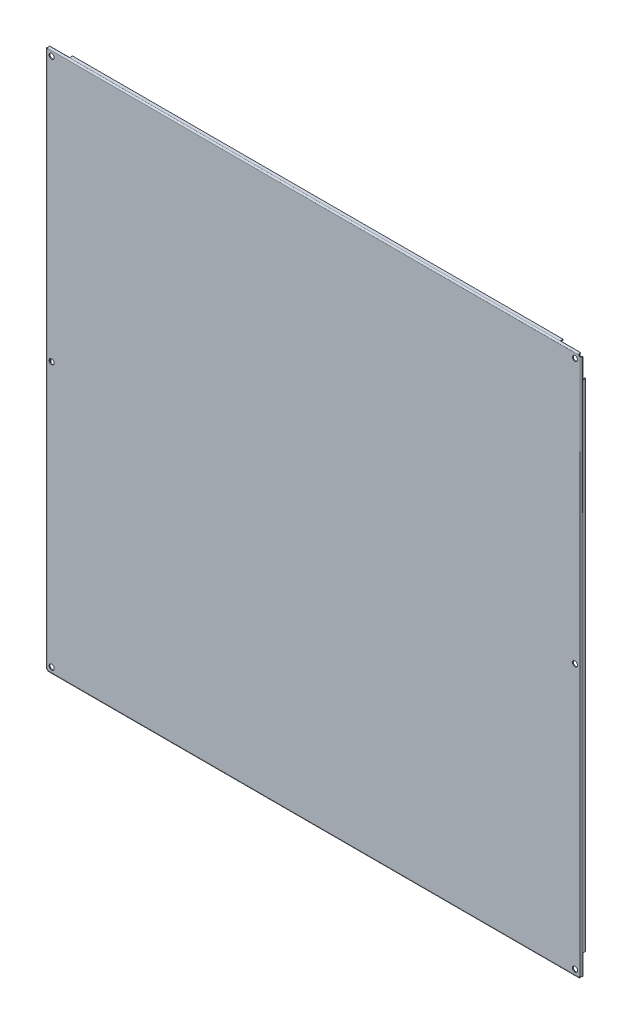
ISO-10303-21;
HEADER;
FILE_DESCRIPTION(('STEP AP214'),'2;1');
FILE_NAME('part.step','',(''),(''),'','','');
FILE_SCHEMA(('AUTOMOTIVE_DESIGN { 1 0 10303 214 1 1 1 1 }'));
ENDSEC;
DATA;
#1=APPLICATION_CONTEXT('core data for automotive mechanical design processes');
#2=APPLICATION_PROTOCOL_DEFINITION('international standard','automotive_design',2000,#1);
#3=PRODUCT_CONTEXT('',#1,'mechanical');
#4=PRODUCT('Part','Part','',(#3));
#5=PRODUCT_RELATED_PRODUCT_CATEGORY('part','',(#4));
#6=PRODUCT_DEFINITION_FORMATION('','',#4);
#7=PRODUCT_DEFINITION_CONTEXT('part definition',#1,'design');
#8=PRODUCT_DEFINITION('design','',#6,#7);
#9=PRODUCT_DEFINITION_SHAPE('','',#8);
#10=(LENGTH_UNIT() NAMED_UNIT(*) SI_UNIT(.MILLI.,.METRE.));
#11=(NAMED_UNIT(*) PLANE_ANGLE_UNIT() SI_UNIT($,.RADIAN.));
#12=(NAMED_UNIT(*) SI_UNIT($,.STERADIAN.) SOLID_ANGLE_UNIT());
#13=UNCERTAINTY_MEASURE_WITH_UNIT(LENGTH_MEASURE(1.E-05),#10,'distance_accuracy_value','');
#14=(GEOMETRIC_REPRESENTATION_CONTEXT(3) GLOBAL_UNCERTAINTY_ASSIGNED_CONTEXT((#13)) GLOBAL_UNIT_ASSIGNED_CONTEXT((#10,
#11,#12)) REPRESENTATION_CONTEXT('',''));
#15=CARTESIAN_POINT('',(0.,0.,0.));
#16=DIRECTION('',(0.,0.,1.));
#17=DIRECTION('',(1.,0.,0.));
#18=AXIS2_PLACEMENT_3D('',#15,#16,#17);
#19=CARTESIAN_POINT('',(0.,1.5,0.));
#20=DIRECTION('',(0.,-1.,0.));
#21=DIRECTION('',(0.,0.,-1.));
#22=AXIS2_PLACEMENT_3D('',#19,#20,#21);
#23=PLANE('',#22);
#24=DIRECTION('',(1.,0.,0.));
#25=VECTOR('',#24,1.);
#26=CARTESIAN_POINT('',(0.,1.5,1.5));
#27=LINE('',#26,#25);
#28=CARTESIAN_POINT('',(-469.585786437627,1.5,1.5));
#29=VERTEX_POINT('',#28);
#30=CARTESIAN_POINT('',(469.585786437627,1.5,1.5));
#31=VERTEX_POINT('',#30);
#32=EDGE_CURVE('E320',#29,#31,#27,.T.);
#33=ORIENTED_EDGE('',*,*,#32,.T.);
#34=DIRECTION('',(0.,0.,1.));
#35=VECTOR('',#34,1.);
#36=CARTESIAN_POINT('',(469.585786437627,1.5,0.));
#37=LINE('',#36,#35);
#38=CARTESIAN_POINT('',(469.585786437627,1.5,1.));
#39=VERTEX_POINT('',#38);
#40=EDGE_CURVE('E1196',#31,#39,#37,.F.);
#41=ORIENTED_EDGE('',*,*,#40,.T.);
#42=DIRECTION('',(1.,0.,0.));
#43=VECTOR('',#42,1.);
#44=CARTESIAN_POINT('',(0.,1.5,1.));
#45=LINE('',#44,#43);
#46=CARTESIAN_POINT('',(434.,1.5,1.));
#47=VERTEX_POINT('',#46);
#48=EDGE_CURVE('E459',#39,#47,#45,.F.);
#49=ORIENTED_EDGE('',*,*,#48,.T.);
#50=DIRECTION('',(0.,0.,1.));
#51=VECTOR('',#50,1.);
#52=CARTESIAN_POINT('',(434.,1.5,0.));
#53=LINE('',#52,#51);
#54=CARTESIAN_POINT('',(434.,1.5,-4.));
#55=VERTEX_POINT('',#54);
#56=EDGE_CURVE('E466',#47,#55,#53,.F.);
#57=ORIENTED_EDGE('',*,*,#56,.T.);
#58=DIRECTION('',(1.,0.,0.));
#59=VECTOR('',#58,1.);
#60=CARTESIAN_POINT('',(0.,1.5,-4.));
#61=LINE('',#60,#59);
#62=CARTESIAN_POINT('',(-434.,1.5,-4.));
#63=VERTEX_POINT('',#62);
#64=EDGE_CURVE('E472',#55,#63,#61,.F.);
#65=ORIENTED_EDGE('',*,*,#64,.T.);
#66=DIRECTION('',(0.,0.,-1.));
#67=VECTOR('',#66,1.);
#68=CARTESIAN_POINT('',(-434.,1.5,0.));
#69=LINE('',#68,#67);
#70=CARTESIAN_POINT('',(-434.,1.5,1.));
#71=VERTEX_POINT('',#70);
#72=EDGE_CURVE('E478',#63,#71,#69,.F.);
#73=ORIENTED_EDGE('',*,*,#72,.T.);
#74=DIRECTION('',(-1.,0.,0.));
#75=VECTOR('',#74,1.);
#76=CARTESIAN_POINT('',(0.,1.5,1.));
#77=LINE('',#76,#75);
#78=CARTESIAN_POINT('',(-469.585786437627,1.5,1.));
#79=VERTEX_POINT('',#78);
#80=EDGE_CURVE('E481',#79,#71,#77,.F.);
#81=ORIENTED_EDGE('',*,*,#80,.F.);
#82=DIRECTION('',(0.,0.,-1.));
#83=VECTOR('',#82,1.);
#84=CARTESIAN_POINT('',(-469.585786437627,1.5,0.));
#85=LINE('',#84,#83);
#86=EDGE_CURVE('E1244',#79,#29,#85,.F.);
#87=ORIENTED_EDGE('',*,*,#86,.T.);
#88=EDGE_LOOP('',(#33,#41,#49,#57,#65,#73,#81,#87));
#89=FACE_BOUND('',#88,.T.);
#90=ADVANCED_FACE('F17',(#89),#23,.F.);
#91=CARTESIAN_POINT('',(-472.5,958.,4.));
#92=DIRECTION('',(1.,0.,0.));
#93=DIRECTION('',(0.,0.,-1.));
#94=AXIS2_PLACEMENT_3D('',#91,#92,#93);
#95=PLANE('',#94);
#96=DIRECTION('',(0.,0.,-1.));
#97=VECTOR('',#96,1.);
#98=CARTESIAN_POINT('',(-472.5,918.,4.));
#99=LINE('',#98,#97);
#100=CARTESIAN_POINT('',(-472.5,918.,-4.));
#101=VERTEX_POINT('',#100);
#102=CARTESIAN_POINT('',(-472.5,918.,1.));
#103=VERTEX_POINT('',#102);
#104=EDGE_CURVE('E1171',#101,#103,#99,.F.);
#105=ORIENTED_EDGE('',*,*,#104,.T.);
#106=DIRECTION('',(0.,1.,0.));
#107=VECTOR('',#106,1.);
#108=CARTESIAN_POINT('',(-472.5,958.,1.));
#109=LINE('',#108,#107);
#110=CARTESIAN_POINT('',(-472.5,953.585786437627,1.));
#111=VERTEX_POINT('',#110);
#112=EDGE_CURVE('E444',#103,#111,#109,.T.);
#113=ORIENTED_EDGE('',*,*,#112,.T.);
#114=DIRECTION('',(0.,0.,1.));
#115=VECTOR('',#114,1.);
#116=CARTESIAN_POINT('',(-472.5,953.585786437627,2.5));
#117=LINE('',#116,#115);
#118=CARTESIAN_POINT('',(-472.5,953.585786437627,1.5));
#119=VERTEX_POINT('',#118);
#120=EDGE_CURVE('E427',#119,#111,#117,.F.);
#121=ORIENTED_EDGE('',*,*,#120,.F.);
#122=DIRECTION('',(0.,1.,0.));
#123=VECTOR('',#122,1.);
#124=CARTESIAN_POINT('',(-472.5,958.,1.5));
#125=LINE('',#124,#123);
#126=CARTESIAN_POINT('',(-472.5,4.41421356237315,1.5));
#127=VERTEX_POINT('',#126);
#128=EDGE_CURVE('E956',#119,#127,#125,.F.);
#129=ORIENTED_EDGE('',*,*,#128,.T.);
#130=DIRECTION('',(0.,0.,-1.));
#131=VECTOR('',#130,1.);
#132=CARTESIAN_POINT('',(-472.5,4.41421356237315,4.));
#133=LINE('',#132,#131);
#134=CARTESIAN_POINT('',(-472.5,4.41421356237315,1.));
#135=VERTEX_POINT('',#134);
#136=EDGE_CURVE('E1162',#135,#127,#133,.F.);
#137=ORIENTED_EDGE('',*,*,#136,.F.);
#138=DIRECTION('',(0.,1.,0.));
#139=VECTOR('',#138,1.);
#140=CARTESIAN_POINT('',(-472.5,958.,1.));
#141=LINE('',#140,#139);
#142=CARTESIAN_POINT('',(-472.5,40.,1.));
#143=VERTEX_POINT('',#142);
#144=EDGE_CURVE('E424',#143,#135,#141,.F.);
#145=ORIENTED_EDGE('',*,*,#144,.F.);
#146=DIRECTION('',(0.,0.,1.));
#147=VECTOR('',#146,1.);
#148=CARTESIAN_POINT('',(-472.5,40.,4.));
#149=LINE('',#148,#147);
#150=CARTESIAN_POINT('',(-472.5,40.,-4.));
#151=VERTEX_POINT('',#150);
#152=EDGE_CURVE('E426',#143,#151,#149,.F.);
#153=ORIENTED_EDGE('',*,*,#152,.T.);
#154=DIRECTION('',(0.,1.,0.));
#155=VECTOR('',#154,1.);
#156=CARTESIAN_POINT('',(-472.5,958.,-4.));
#157=LINE('',#156,#155);
#158=EDGE_CURVE('E437',#151,#101,#157,.T.);
#159=ORIENTED_EDGE('',*,*,#158,.T.);
#160=EDGE_LOOP('',(#105,#113,#121,#129,#137,#145,#153,#159));
#161=FACE_BOUND('',#160,.T.);
#162=ADVANCED_FACE('F714',(#161),#95,.T.);
#163=CARTESIAN_POINT('',(0.,956.5,0.));
#164=DIRECTION('',(0.,-1.,0.));
#165=DIRECTION('',(0.,0.,-1.));
#166=AXIS2_PLACEMENT_3D('',#163,#164,#165);
#167=PLANE('',#166);
#168=DIRECTION('',(0.,0.,1.));
#169=VECTOR('',#168,1.);
#170=CARTESIAN_POINT('',(434.,956.5,0.));
#171=LINE('',#170,#169);
#172=CARTESIAN_POINT('',(434.,956.5,-4.));
#173=VERTEX_POINT('',#172);
#174=CARTESIAN_POINT('',(434.,956.5,1.));
#175=VERTEX_POINT('',#174);
#176=EDGE_CURVE('E1131',#173,#175,#171,.T.);
#177=ORIENTED_EDGE('',*,*,#176,.T.);
#178=DIRECTION('',(-1.,0.,0.));
#179=VECTOR('',#178,1.);
#180=CARTESIAN_POINT('',(0.,956.5,1.));
#181=LINE('',#180,#179);
#182=CARTESIAN_POINT('',(469.585786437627,956.5,1.));
#183=VERTEX_POINT('',#182);
#184=EDGE_CURVE('E389',#183,#175,#181,.T.);
#185=ORIENTED_EDGE('',*,*,#184,.F.);
#186=DIRECTION('',(0.,0.,-1.));
#187=VECTOR('',#186,1.);
#188=CARTESIAN_POINT('',(469.585786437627,956.5,2.5));
#189=LINE('',#188,#187);
#190=CARTESIAN_POINT('',(469.585786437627,956.5,1.5));
#191=VERTEX_POINT('',#190);
#192=EDGE_CURVE('E1145',#191,#183,#189,.T.);
#193=ORIENTED_EDGE('',*,*,#192,.F.);
#194=DIRECTION('',(-1.,0.,0.));
#195=VECTOR('',#194,1.);
#196=CARTESIAN_POINT('',(-474.,956.5,1.5));
#197=LINE('',#196,#195);
#198=CARTESIAN_POINT('',(-469.585786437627,956.5,1.5));
#199=VERTEX_POINT('',#198);
#200=EDGE_CURVE('E409',#191,#199,#197,.T.);
#201=ORIENTED_EDGE('',*,*,#200,.T.);
#202=DIRECTION('',(0.,0.,1.));
#203=VECTOR('',#202,1.);
#204=CARTESIAN_POINT('',(-469.585786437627,956.5,1.));
#205=LINE('',#204,#203);
#206=CARTESIAN_POINT('',(-469.585786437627,956.5,1.));
#207=VERTEX_POINT('',#206);
#208=EDGE_CURVE('E1151',#207,#199,#205,.T.);
#209=ORIENTED_EDGE('',*,*,#208,.F.);
#210=DIRECTION('',(1.,0.,0.));
#211=VECTOR('',#210,1.);
#212=CARTESIAN_POINT('',(0.,956.5,1.));
#213=LINE('',#212,#211);
#214=CARTESIAN_POINT('',(-434.,956.5,1.));
#215=VERTEX_POINT('',#214);
#216=EDGE_CURVE('E405',#207,#215,#213,.T.);
#217=ORIENTED_EDGE('',*,*,#216,.T.);
#218=DIRECTION('',(0.,0.,-1.));
#219=VECTOR('',#218,1.);
#220=CARTESIAN_POINT('',(-434.,956.5,0.));
#221=LINE('',#220,#219);
#222=CARTESIAN_POINT('',(-434.,956.5,-4.));
#223=VERTEX_POINT('',#222);
#224=EDGE_CURVE('E414',#215,#223,#221,.T.);
#225=ORIENTED_EDGE('',*,*,#224,.T.);
#226=DIRECTION('',(1.,0.,0.));
#227=VECTOR('',#226,1.);
#228=CARTESIAN_POINT('',(0.,956.5,-4.));
#229=LINE('',#228,#227);
#230=EDGE_CURVE('E1136',#223,#173,#229,.T.);
#231=ORIENTED_EDGE('',*,*,#230,.T.);
#232=EDGE_LOOP('',(#177,#185,#193,#201,#209,#217,#225,#231));
#233=FACE_BOUND('',#232,.T.);
#234=ADVANCED_FACE('F718',(#233),#167,.T.);
#235=CARTESIAN_POINT('',(472.5,958.,4.));
#236=DIRECTION('',(-1.,0.,0.));
#237=DIRECTION('',(0.,0.,1.));
#238=AXIS2_PLACEMENT_3D('',#235,#236,#237);
#239=PLANE('',#238);
#240=DIRECTION('',(0.,0.,1.));
#241=VECTOR('',#240,1.);
#242=CARTESIAN_POINT('',(472.5,40.,4.));
#243=LINE('',#242,#241);
#244=CARTESIAN_POINT('',(472.5,40.,-4.));
#245=VERTEX_POINT('',#244);
#246=CARTESIAN_POINT('',(472.5,40.,1.));
#247=VERTEX_POINT('',#246);
#248=EDGE_CURVE('E1103',#245,#247,#243,.T.);
#249=ORIENTED_EDGE('',*,*,#248,.T.);
#250=DIRECTION('',(0.,1.,0.));
#251=VECTOR('',#250,1.);
#252=CARTESIAN_POINT('',(472.5,958.,1.));
#253=LINE('',#252,#251);
#254=CARTESIAN_POINT('',(472.5,4.41421356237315,1.));
#255=VERTEX_POINT('',#254);
#256=EDGE_CURVE('E352',#247,#255,#253,.F.);
#257=ORIENTED_EDGE('',*,*,#256,.T.);
#258=DIRECTION('',(0.,0.,-1.));
#259=VECTOR('',#258,1.);
#260=CARTESIAN_POINT('',(472.5,4.41421356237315,4.));
#261=LINE('',#260,#259);
#262=CARTESIAN_POINT('',(472.5,4.41421356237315,1.5));
#263=VERTEX_POINT('',#262);
#264=EDGE_CURVE('E909',#263,#255,#261,.T.);
#265=ORIENTED_EDGE('',*,*,#264,.F.);
#266=DIRECTION('',(0.,1.,0.));
#267=VECTOR('',#266,1.);
#268=CARTESIAN_POINT('',(472.5,958.,1.5));
#269=LINE('',#268,#267);
#270=CARTESIAN_POINT('',(472.5,953.585786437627,1.5));
#271=VERTEX_POINT('',#270);
#272=EDGE_CURVE('E376',#263,#271,#269,.T.);
#273=ORIENTED_EDGE('',*,*,#272,.T.);
#274=DIRECTION('',(0.,0.,1.));
#275=VECTOR('',#274,1.);
#276=CARTESIAN_POINT('',(472.5,953.585786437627,1.));
#277=LINE('',#276,#275);
#278=CARTESIAN_POINT('',(472.5,953.585786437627,1.));
#279=VERTEX_POINT('',#278);
#280=EDGE_CURVE('E908',#279,#271,#277,.T.);
#281=ORIENTED_EDGE('',*,*,#280,.F.);
#282=DIRECTION('',(0.,1.,0.));
#283=VECTOR('',#282,1.);
#284=CARTESIAN_POINT('',(472.5,958.,1.));
#285=LINE('',#284,#283);
#286=CARTESIAN_POINT('',(472.5,918.,1.));
#287=VERTEX_POINT('',#286);
#288=EDGE_CURVE('E367',#287,#279,#285,.T.);
#289=ORIENTED_EDGE('',*,*,#288,.F.);
#290=DIRECTION('',(0.,0.,-1.));
#291=VECTOR('',#290,1.);
#292=CARTESIAN_POINT('',(472.5,918.,4.));
#293=LINE('',#292,#291);
#294=CARTESIAN_POINT('',(472.5,918.,-4.));
#295=VERTEX_POINT('',#294);
#296=EDGE_CURVE('E370',#287,#295,#293,.T.);
#297=ORIENTED_EDGE('',*,*,#296,.T.);
#298=DIRECTION('',(0.,1.,0.));
#299=VECTOR('',#298,1.);
#300=CARTESIAN_POINT('',(472.5,958.,-4.));
#301=LINE('',#300,#299);
#302=EDGE_CURVE('E1105',#245,#295,#301,.T.);
#303=ORIENTED_EDGE('',*,*,#302,.F.);
#304=EDGE_LOOP('',(#249,#257,#265,#273,#281,#289,#297,#303));
#305=FACE_BOUND('',#304,.T.);
#306=ADVANCED_FACE('F722',(#305),#239,.T.);
#307=CARTESIAN_POINT('',(-469.585786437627,1.5,0.));
#308=DIRECTION('',(1.,0.,0.));
#309=DIRECTION('',(0.,0.,-1.));
#310=AXIS2_PLACEMENT_3D('',#307,#308,#309);
#311=PLANE('',#310);
#312=DIRECTION('',(0.,0.,-1.));
#313=VECTOR('',#312,1.);
#314=CARTESIAN_POINT('',(-469.585786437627,0.,0.));
#315=LINE('',#314,#313);
#316=CARTESIAN_POINT('',(-469.585786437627,0.,1.5));
#317=VERTEX_POINT('',#316);
#318=CARTESIAN_POINT('',(-469.585786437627,0.,1.));
#319=VERTEX_POINT('',#318);
#320=EDGE_CURVE('E1241',#317,#319,#315,.T.);
#321=ORIENTED_EDGE('',*,*,#320,.F.);
#322=DIRECTION('',(0.,-1.,0.));
#323=VECTOR('',#322,1.);
#324=CARTESIAN_POINT('',(-469.585786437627,0.75,1.5));
#325=LINE('',#324,#323);
#326=EDGE_CURVE('E334',#29,#317,#325,.T.);
#327=ORIENTED_EDGE('',*,*,#326,.F.);
#328=ORIENTED_EDGE('',*,*,#86,.F.);
#329=DIRECTION('',(0.,1.,0.));
#330=VECTOR('',#329,1.);
#331=CARTESIAN_POINT('',(-469.585786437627,1.5,1.));
#332=LINE('',#331,#330);
#333=EDGE_CURVE('E485',#319,#79,#332,.T.);
#334=ORIENTED_EDGE('',*,*,#333,.F.);
#335=EDGE_LOOP('',(#321,#327,#328,#334));
#336=FACE_BOUND('',#335,.T.);
#337=ADVANCED_FACE('F726',(#336),#311,.F.);
#338=CARTESIAN_POINT('',(0.,1.5,1.));
#339=DIRECTION('',(0.,0.,-1.));
#340=DIRECTION('',(-1.,0.,0.));
#341=AXIS2_PLACEMENT_3D('',#338,#339,#340);
#342=PLANE('',#341);
#343=ORIENTED_EDGE('',*,*,#333,.T.);
#344=ORIENTED_EDGE('',*,*,#80,.T.);
#345=DIRECTION('',(0.,1.,0.));
#346=VECTOR('',#345,1.);
#347=CARTESIAN_POINT('',(-434.,1.5,1.));
#348=LINE('',#347,#346);
#349=CARTESIAN_POINT('',(-434.,0.,1.));
#350=VERTEX_POINT('',#349);
#351=EDGE_CURVE('E475',#71,#350,#348,.F.);
#352=ORIENTED_EDGE('',*,*,#351,.T.);
#353=DIRECTION('',(1.,0.,0.));
#354=VECTOR('',#353,1.);
#355=CARTESIAN_POINT('',(0.,0.,1.));
#356=LINE('',#355,#354);
#357=EDGE_CURVE('E325',#319,#350,#356,.T.);
#358=ORIENTED_EDGE('',*,*,#357,.F.);
#359=EDGE_LOOP('',(#343,#344,#352,#358));
#360=FACE_BOUND('',#359,.T.);
#361=ADVANCED_FACE('F730',(#360),#342,.T.);
#362=CARTESIAN_POINT('',(-434.,1.5,0.));
#363=DIRECTION('',(1.,0.,0.));
#364=DIRECTION('',(0.,0.,-1.));
#365=AXIS2_PLACEMENT_3D('',#362,#363,#364);
#366=PLANE('',#365);
#367=DIRECTION('',(0.,0.,-1.));
#368=VECTOR('',#367,1.);
#369=CARTESIAN_POINT('',(-434.,0.,0.));
#370=LINE('',#369,#368);
#371=CARTESIAN_POINT('',(-434.,0.,-4.));
#372=VERTEX_POINT('',#371);
#373=EDGE_CURVE('E1222',#350,#372,#370,.T.);
#374=ORIENTED_EDGE('',*,*,#373,.F.);
#375=ORIENTED_EDGE('',*,*,#351,.F.);
#376=ORIENTED_EDGE('',*,*,#72,.F.);
#377=DIRECTION('',(0.,1.,0.));
#378=VECTOR('',#377,1.);
#379=CARTESIAN_POINT('',(-434.,1.5,-4.));
#380=LINE('',#379,#378);
#381=EDGE_CURVE('E469',#63,#372,#380,.F.);
#382=ORIENTED_EDGE('',*,*,#381,.T.);
#383=EDGE_LOOP('',(#374,#375,#376,#382));
#384=FACE_BOUND('',#383,.T.);
#385=ADVANCED_FACE('F734',(#384),#366,.F.);
#386=CARTESIAN_POINT('',(0.,1.5,-4.));
#387=DIRECTION('',(0.,0.,1.));
#388=DIRECTION('',(1.,0.,0.));
#389=AXIS2_PLACEMENT_3D('',#386,#387,#388);
#390=PLANE('',#389);
#391=DIRECTION('',(1.,0.,0.));
#392=VECTOR('',#391,1.);
#393=CARTESIAN_POINT('',(0.,0.,-4.));
#394=LINE('',#393,#392);
#395=CARTESIAN_POINT('',(434.,0.,-4.));
#396=VERTEX_POINT('',#395);
#397=EDGE_CURVE('E1214',#372,#396,#394,.T.);
#398=ORIENTED_EDGE('',*,*,#397,.F.);
#399=ORIENTED_EDGE('',*,*,#381,.F.);
#400=ORIENTED_EDGE('',*,*,#64,.F.);
#401=DIRECTION('',(0.,1.,0.));
#402=VECTOR('',#401,1.);
#403=CARTESIAN_POINT('',(434.,1.5,-4.));
#404=LINE('',#403,#402);
#405=EDGE_CURVE('E463',#55,#396,#404,.F.);
#406=ORIENTED_EDGE('',*,*,#405,.T.);
#407=EDGE_LOOP('',(#398,#399,#400,#406));
#408=FACE_BOUND('',#407,.T.);
#409=ADVANCED_FACE('F738',(#408),#390,.F.);
#410=CARTESIAN_POINT('',(434.,1.5,0.));
#411=DIRECTION('',(-1.,0.,0.));
#412=DIRECTION('',(0.,0.,1.));
#413=AXIS2_PLACEMENT_3D('',#410,#411,#412);
#414=PLANE('',#413);
#415=DIRECTION('',(0.,0.,-1.));
#416=VECTOR('',#415,1.);
#417=CARTESIAN_POINT('',(434.,0.,0.));
#418=LINE('',#417,#416);
#419=CARTESIAN_POINT('',(434.,0.,1.));
#420=VERTEX_POINT('',#419);
#421=EDGE_CURVE('E1206',#396,#420,#418,.F.);
#422=ORIENTED_EDGE('',*,*,#421,.F.);
#423=ORIENTED_EDGE('',*,*,#405,.F.);
#424=ORIENTED_EDGE('',*,*,#56,.F.);
#425=DIRECTION('',(0.,1.,0.));
#426=VECTOR('',#425,1.);
#427=CARTESIAN_POINT('',(434.,1.5,1.));
#428=LINE('',#427,#426);
#429=EDGE_CURVE('E462',#47,#420,#428,.F.);
#430=ORIENTED_EDGE('',*,*,#429,.T.);
#431=EDGE_LOOP('',(#422,#423,#424,#430));
#432=FACE_BOUND('',#431,.T.);
#433=ADVANCED_FACE('F742',(#432),#414,.F.);
#434=CARTESIAN_POINT('',(0.,1.5,1.));
#435=DIRECTION('',(0.,0.,1.));
#436=DIRECTION('',(1.,0.,0.));
#437=AXIS2_PLACEMENT_3D('',#434,#435,#436);
#438=PLANE('',#437);
#439=DIRECTION('',(1.,0.,0.));
#440=VECTOR('',#439,1.);
#441=CARTESIAN_POINT('',(0.,0.,1.));
#442=LINE('',#441,#440);
#443=CARTESIAN_POINT('',(469.585786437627,0.,1.));
#444=VERTEX_POINT('',#443);
#445=EDGE_CURVE('E1095',#420,#444,#442,.T.);
#446=ORIENTED_EDGE('',*,*,#445,.F.);
#447=ORIENTED_EDGE('',*,*,#429,.F.);
#448=ORIENTED_EDGE('',*,*,#48,.F.);
#449=DIRECTION('',(0.,1.,0.));
#450=VECTOR('',#449,1.);
#451=CARTESIAN_POINT('',(469.585786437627,1.5,1.));
#452=LINE('',#451,#450);
#453=EDGE_CURVE('E1195',#39,#444,#452,.F.);
#454=ORIENTED_EDGE('',*,*,#453,.T.);
#455=EDGE_LOOP('',(#446,#447,#448,#454));
#456=FACE_BOUND('',#455,.T.);
#457=ADVANCED_FACE('F746',(#456),#438,.F.);
#458=CARTESIAN_POINT('',(469.585786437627,1.5,0.));
#459=DIRECTION('',(-1.,0.,0.));
#460=DIRECTION('',(0.,0.,1.));
#461=AXIS2_PLACEMENT_3D('',#458,#459,#460);
#462=PLANE('',#461);
#463=DIRECTION('',(0.,0.,-1.));
#464=VECTOR('',#463,1.);
#465=CARTESIAN_POINT('',(469.585786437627,0.,0.));
#466=LINE('',#465,#464);
#467=CARTESIAN_POINT('',(469.585786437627,0.,1.5));
#468=VERTEX_POINT('',#467);
#469=EDGE_CURVE('E1093',#444,#468,#466,.F.);
#470=ORIENTED_EDGE('',*,*,#469,.F.);
#471=ORIENTED_EDGE('',*,*,#453,.F.);
#472=ORIENTED_EDGE('',*,*,#40,.F.);
#473=DIRECTION('',(0.,1.,0.));
#474=VECTOR('',#473,1.);
#475=CARTESIAN_POINT('',(469.585786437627,0.75,1.5));
#476=LINE('',#475,#474);
#477=EDGE_CURVE('E1090',#468,#31,#476,.T.);
#478=ORIENTED_EDGE('',*,*,#477,.F.);
#479=EDGE_LOOP('',(#470,#471,#472,#478));
#480=FACE_BOUND('',#479,.T.);
#481=ADVANCED_FACE('F750',(#480),#462,.F.);
#482=CARTESIAN_POINT('',(0.,2.5,1.5));
#483=DIRECTION('',(1.,0.,0.));
#484=DIRECTION('',(0.,0.,-1.));
#485=AXIS2_PLACEMENT_3D('',#482,#483,#484);
#486=CYLINDRICAL_SURFACE('',#485,1.);
#487=DIRECTION('',(-1.,0.,0.));
#488=VECTOR('',#487,1.);
#489=CARTESIAN_POINT('',(-474.,2.49999999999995,2.5));
#490=LINE('',#489,#488);
#491=CARTESIAN_POINT('',(470.,2.49999999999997,2.5));
#492=VERTEX_POINT('',#491);
#493=CARTESIAN_POINT('',(-470.,2.49999999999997,2.5));
#494=VERTEX_POINT('',#493);
#495=EDGE_CURVE('E303',#492,#494,#490,.T.);
#496=ORIENTED_EDGE('',*,*,#495,.F.);
#497=CARTESIAN_POINT('',(469.585786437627,1.5,1.5));
#498=CARTESIAN_POINT('',(469.585791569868,1.49999628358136,1.52396943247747));
#499=CARTESIAN_POINT('',(469.586773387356,1.50086202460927,1.54790535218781));
#500=CARTESIAN_POINT('',(469.59040038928,1.5042849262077,1.59548683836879));
#501=CARTESIAN_POINT('',(469.593042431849,1.5068388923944,1.61913286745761));
#502=CARTESIAN_POINT('',(469.602973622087,1.51690809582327,1.68902809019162));
#503=CARTESIAN_POINT('',(469.612278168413,1.52683242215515,1.73465915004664));
#504=CARTESIAN_POINT('',(469.634406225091,1.5524597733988,1.82290837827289));
#505=CARTESIAN_POINT('',(469.647204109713,1.56812099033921,1.86554574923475));
#506=CARTESIAN_POINT('',(469.675097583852,1.60472845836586,1.94779358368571));
#507=CARTESIAN_POINT('',(469.690198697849,1.62568749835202,1.98739641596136));
#508=CARTESIAN_POINT('',(469.724891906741,1.67708899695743,2.07067351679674));
#509=CARTESIAN_POINT('',(469.744777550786,1.70859020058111,2.11357339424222));
#510=CARTESIAN_POINT('',(469.785118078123,1.77781181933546,2.19372196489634));
#511=CARTESIAN_POINT('',(469.805573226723,1.81553517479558,2.2309679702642));
#512=CARTESIAN_POINT('',(469.848385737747,1.90177399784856,2.30355152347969));
#513=CARTESIAN_POINT('',(469.870653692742,1.95105201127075,2.33804227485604));
#514=CARTESIAN_POINT('',(469.912397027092,2.05594692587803,2.39803056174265));
#515=CARTESIAN_POINT('',(469.931873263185,2.11156187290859,2.42353085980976));
#516=CARTESIAN_POINT('',(469.960415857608,2.21091169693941,2.45829782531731));
#517=CARTESIAN_POINT('',(469.970860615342,2.25335960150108,2.47013135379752));
#518=CARTESIAN_POINT('',(469.987595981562,2.34014417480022,2.48812321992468));
#519=CARTESIAN_POINT('',(469.993903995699,2.3844720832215,2.494305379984));
#520=CARTESIAN_POINT('',(469.999036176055,2.45272027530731,2.49916544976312));
#521=CARTESIAN_POINT('',(469.999990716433,2.47635018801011,2.50001170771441));
#522=CARTESIAN_POINT('',(470.,2.5,2.5));
#523=B_SPLINE_CURVE_WITH_KNOTS('',3,(#497,#498,#499,#500,#501,#502,#503,#504,#505,#506,#507,
#508,#509,#510,#511,#512,#513,#514,#515,#516,#517,#518,#519,#520,#521,#522),.UNSPECIFIED.,.F.,
.F.,(4,2,2,2,2,2,2,2,2,2,2,2,4),(0.,0.0718194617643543,0.143503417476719,0.285617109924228,
0.42671509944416,0.568157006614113,0.737942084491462,0.907807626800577,1.09930104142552,
1.29073556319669,1.42614133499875,1.56097365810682,1.63186947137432),.UNSPECIFIED.);
#524=EDGE_CURVE('E638',#31,#492,#523,.T.);
#525=ORIENTED_EDGE('',*,*,#524,.F.);
#526=ORIENTED_EDGE('',*,*,#32,.F.);
#527=CARTESIAN_POINT('',(-470.,2.5,2.5));
#528=CARTESIAN_POINT('',(-469.999994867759,2.47603056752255,2.50000371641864));
#529=CARTESIAN_POINT('',(-469.999013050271,2.45209464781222,2.49913797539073));
#530=CARTESIAN_POINT('',(-469.995386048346,2.40451316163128,2.49571507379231));
#531=CARTESIAN_POINT('',(-469.992744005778,2.38086713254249,2.49316110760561));
#532=CARTESIAN_POINT('',(-469.98281281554,2.31097190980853,2.48309190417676));
#533=CARTESIAN_POINT('',(-469.973508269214,2.26534084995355,2.4731675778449));
#534=CARTESIAN_POINT('',(-469.951380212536,2.17709162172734,2.44754022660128));
#535=CARTESIAN_POINT('',(-469.938582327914,2.13445425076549,2.43187900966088));
#536=CARTESIAN_POINT('',(-469.910688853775,2.05220641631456,2.39527154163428));
#537=CARTESIAN_POINT('',(-469.895587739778,2.01260358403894,2.37431250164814));
#538=CARTESIAN_POINT('',(-469.860894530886,1.92932648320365,2.32291100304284));
#539=CARTESIAN_POINT('',(-469.841008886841,1.88642660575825,2.29140979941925));
#540=CARTESIAN_POINT('',(-469.800668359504,1.80627803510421,2.22218818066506));
#541=CARTESIAN_POINT('',(-469.780213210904,1.76903202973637,2.18446482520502));
#542=CARTESIAN_POINT('',(-469.73740069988,1.69644847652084,2.09822600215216));
#543=CARTESIAN_POINT('',(-469.715132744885,1.66195772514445,2.04894798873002));
#544=CARTESIAN_POINT('',(-469.673389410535,1.60196943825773,1.94405307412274));
#545=CARTESIAN_POINT('',(-469.653913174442,1.57646914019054,1.88843812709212));
#546=CARTESIAN_POINT('',(-469.625370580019,1.54170217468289,1.78908830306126));
#547=CARTESIAN_POINT('',(-469.614925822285,1.52986864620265,1.74664039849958));
#548=CARTESIAN_POINT('',(-469.598190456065,1.51187678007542,1.65985582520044));
#549=CARTESIAN_POINT('',(-469.591882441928,1.50569462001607,1.61552791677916));
#550=CARTESIAN_POINT('',(-469.586750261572,1.5008345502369,1.54727972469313));
#551=CARTESIAN_POINT('',(-469.585795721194,1.49998829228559,1.52364981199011));
#552=CARTESIAN_POINT('',(-469.585786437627,1.5,1.5));
#553=B_SPLINE_CURVE_WITH_KNOTS('',3,(#527,#528,#529,#530,#531,#532,#533,#534,#535,#536,#537,
#538,#539,#540,#541,#542,#543,#544,#545,#546,#547,#548,#549,#550,#551,#552),.UNSPECIFIED.,.F.,
.F.,(4,2,2,2,2,2,2,2,2,2,2,2,4),(0.,0.0718194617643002,0.143503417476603,0.285617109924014,
0.42671509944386,0.568157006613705,0.737942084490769,0.907807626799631,1.09930104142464,
1.29073556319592,1.42614133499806,1.56097365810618,1.63186947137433),.UNSPECIFIED.);
#554=EDGE_CURVE('E24',#494,#29,#553,.T.);
#555=ORIENTED_EDGE('',*,*,#554,.F.);
#556=EDGE_LOOP('',(#496,#525,#526,#555));
#557=FACE_BOUND('',#556,.T.);
#558=ADVANCED_FACE('F318',(#557),#486,.F.);
#559=CARTESIAN_POINT('',(-472.5,953.585786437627,2.5));
#560=DIRECTION('',(0.,1.,0.));
#561=DIRECTION('',(0.,0.,1.));
#562=AXIS2_PLACEMENT_3D('',#559,#560,#561);
#563=PLANE('',#562);
#564=DIRECTION('',(-1.,0.,0.));
#565=VECTOR('',#564,1.);
#566=CARTESIAN_POINT('',(-473.25,953.585786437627,1.5));
#567=LINE('',#566,#565);
#568=CARTESIAN_POINT('',(-474.,953.585786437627,1.5));
#569=VERTEX_POINT('',#568);
#570=EDGE_CURVE('E964',#119,#569,#567,.T.);
#571=ORIENTED_EDGE('',*,*,#570,.F.);
#572=ORIENTED_EDGE('',*,*,#120,.T.);
#573=DIRECTION('',(1.,0.,0.));
#574=VECTOR('',#573,1.);
#575=CARTESIAN_POINT('',(-472.5,953.585786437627,1.));
#576=LINE('',#575,#574);
#577=CARTESIAN_POINT('',(-474.,953.585786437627,1.));
#578=VERTEX_POINT('',#577);
#579=EDGE_CURVE('E440',#111,#578,#576,.F.);
#580=ORIENTED_EDGE('',*,*,#579,.T.);
#581=DIRECTION('',(0.,0.,1.));
#582=VECTOR('',#581,1.);
#583=CARTESIAN_POINT('',(-474.,953.585786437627,2.5));
#584=LINE('',#583,#582);
#585=EDGE_CURVE('E1188',#578,#569,#584,.T.);
#586=ORIENTED_EDGE('',*,*,#585,.T.);
#587=EDGE_LOOP('',(#571,#572,#580,#586));
#588=FACE_BOUND('',#587,.T.);
#589=ADVANCED_FACE('F757',(#588),#563,.T.);
#590=CARTESIAN_POINT('',(-472.5,958.,1.));
#591=DIRECTION('',(0.,0.,-1.));
#592=DIRECTION('',(-1.,0.,0.));
#593=AXIS2_PLACEMENT_3D('',#590,#591,#592);
#594=PLANE('',#593);
#595=DIRECTION('',(1.,0.,0.));
#596=VECTOR('',#595,1.);
#597=CARTESIAN_POINT('',(-472.5,40.,1.));
#598=LINE('',#597,#596);
#599=CARTESIAN_POINT('',(-474.,40.,1.));
#600=VERTEX_POINT('',#599);
#601=EDGE_CURVE('E432',#600,#143,#598,.T.);
#602=ORIENTED_EDGE('',*,*,#601,.T.);
#603=ORIENTED_EDGE('',*,*,#144,.T.);
#604=DIRECTION('',(1.,0.,0.));
#605=VECTOR('',#604,1.);
#606=CARTESIAN_POINT('',(-472.5,4.41421356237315,1.));
#607=LINE('',#606,#605);
#608=CARTESIAN_POINT('',(-474.,4.41421356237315,1.));
#609=VERTEX_POINT('',#608);
#610=EDGE_CURVE('E1164',#609,#135,#607,.T.);
#611=ORIENTED_EDGE('',*,*,#610,.F.);
#612=DIRECTION('',(0.,1.,0.));
#613=VECTOR('',#612,1.);
#614=CARTESIAN_POINT('',(-474.,958.,1.));
#615=LINE('',#614,#613);
#616=EDGE_CURVE('E1082',#609,#600,#615,.T.);
#617=ORIENTED_EDGE('',*,*,#616,.T.);
#618=EDGE_LOOP('',(#602,#603,#611,#617));
#619=FACE_BOUND('',#618,.T.);
#620=ADVANCED_FACE('F761',(#619),#594,.T.);
#621=CARTESIAN_POINT('',(-472.5,40.,4.));
#622=DIRECTION('',(0.,1.,0.));
#623=DIRECTION('',(0.,0.,1.));
#624=AXIS2_PLACEMENT_3D('',#621,#622,#623);
#625=PLANE('',#624);
#626=DIRECTION('',(0.,0.,-1.));
#627=VECTOR('',#626,1.);
#628=CARTESIAN_POINT('',(-474.,40.,4.));
#629=LINE('',#628,#627);
#630=CARTESIAN_POINT('',(-474.,40.,-4.));
#631=VERTEX_POINT('',#630);
#632=EDGE_CURVE('E1079',#600,#631,#629,.T.);
#633=ORIENTED_EDGE('',*,*,#632,.T.);
#634=DIRECTION('',(1.,0.,0.));
#635=VECTOR('',#634,1.);
#636=CARTESIAN_POINT('',(-472.5,40.,-4.));
#637=LINE('',#636,#635);
#638=EDGE_CURVE('E1174',#631,#151,#637,.T.);
#639=ORIENTED_EDGE('',*,*,#638,.T.);
#640=ORIENTED_EDGE('',*,*,#152,.F.);
#641=ORIENTED_EDGE('',*,*,#601,.F.);
#642=EDGE_LOOP('',(#633,#639,#640,#641));
#643=FACE_BOUND('',#642,.T.);
#644=ADVANCED_FACE('F765',(#643),#625,.F.);
#645=CARTESIAN_POINT('',(-472.5,958.,-4.));
#646=DIRECTION('',(0.,0.,1.));
#647=DIRECTION('',(1.,0.,0.));
#648=AXIS2_PLACEMENT_3D('',#645,#646,#647);
#649=PLANE('',#648);
#650=DIRECTION('',(0.,1.,0.));
#651=VECTOR('',#650,1.);
#652=CARTESIAN_POINT('',(-474.,958.,-4.));
#653=LINE('',#652,#651);
#654=CARTESIAN_POINT('',(-474.,918.,-4.));
#655=VERTEX_POINT('',#654);
#656=EDGE_CURVE('E1076',#631,#655,#653,.T.);
#657=ORIENTED_EDGE('',*,*,#656,.T.);
#658=DIRECTION('',(1.,0.,0.));
#659=VECTOR('',#658,1.);
#660=CARTESIAN_POINT('',(-472.5,918.,-4.));
#661=LINE('',#660,#659);
#662=EDGE_CURVE('E449',#655,#101,#661,.T.);
#663=ORIENTED_EDGE('',*,*,#662,.T.);
#664=ORIENTED_EDGE('',*,*,#158,.F.);
#665=ORIENTED_EDGE('',*,*,#638,.F.);
#666=EDGE_LOOP('',(#657,#663,#664,#665));
#667=FACE_BOUND('',#666,.T.);
#668=ADVANCED_FACE('F769',(#667),#649,.F.);
#669=CARTESIAN_POINT('',(-472.5,918.,4.));
#670=DIRECTION('',(0.,-1.,0.));
#671=DIRECTION('',(0.,0.,-1.));
#672=AXIS2_PLACEMENT_3D('',#669,#670,#671);
#673=PLANE('',#672);
#674=DIRECTION('',(0.,0.,-1.));
#675=VECTOR('',#674,1.);
#676=CARTESIAN_POINT('',(-474.,918.,4.));
#677=LINE('',#676,#675);
#678=CARTESIAN_POINT('',(-474.,918.,1.));
#679=VERTEX_POINT('',#678);
#680=EDGE_CURVE('E456',#655,#679,#677,.F.);
#681=ORIENTED_EDGE('',*,*,#680,.T.);
#682=DIRECTION('',(1.,0.,0.));
#683=VECTOR('',#682,1.);
#684=CARTESIAN_POINT('',(-472.5,918.,1.));
#685=LINE('',#684,#683);
#686=EDGE_CURVE('E443',#679,#103,#685,.T.);
#687=ORIENTED_EDGE('',*,*,#686,.T.);
#688=ORIENTED_EDGE('',*,*,#104,.F.);
#689=ORIENTED_EDGE('',*,*,#662,.F.);
#690=EDGE_LOOP('',(#681,#687,#688,#689));
#691=FACE_BOUND('',#690,.T.);
#692=ADVANCED_FACE('F773',(#691),#673,.F.);
#693=CARTESIAN_POINT('',(-472.5,958.,1.));
#694=DIRECTION('',(0.,0.,1.));
#695=DIRECTION('',(1.,0.,0.));
#696=AXIS2_PLACEMENT_3D('',#693,#694,#695);
#697=PLANE('',#696);
#698=DIRECTION('',(0.,1.,0.));
#699=VECTOR('',#698,1.);
#700=CARTESIAN_POINT('',(-474.,958.,1.));
#701=LINE('',#700,#699);
#702=EDGE_CURVE('E452',#679,#578,#701,.T.);
#703=ORIENTED_EDGE('',*,*,#702,.T.);
#704=ORIENTED_EDGE('',*,*,#579,.F.);
#705=ORIENTED_EDGE('',*,*,#112,.F.);
#706=ORIENTED_EDGE('',*,*,#686,.F.);
#707=EDGE_LOOP('',(#703,#704,#705,#706));
#708=FACE_BOUND('',#707,.T.);
#709=ADVANCED_FACE('F776',(#708),#697,.F.);
#710=CARTESIAN_POINT('',(-472.5,4.41421356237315,4.));
#711=DIRECTION('',(0.,-1.,0.));
#712=DIRECTION('',(0.,0.,-1.));
#713=AXIS2_PLACEMENT_3D('',#710,#711,#712);
#714=PLANE('',#713);
#715=ORIENTED_EDGE('',*,*,#610,.T.);
#716=ORIENTED_EDGE('',*,*,#136,.T.);
#717=DIRECTION('',(1.,0.,0.));
#718=VECTOR('',#717,1.);
#719=CARTESIAN_POINT('',(-473.25,4.41421356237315,1.5));
#720=LINE('',#719,#718);
#721=CARTESIAN_POINT('',(-474.,4.41421356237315,1.5));
#722=VERTEX_POINT('',#721);
#723=EDGE_CURVE('E455',#722,#127,#720,.T.);
#724=ORIENTED_EDGE('',*,*,#723,.F.);
#725=DIRECTION('',(0.,0.,-1.));
#726=VECTOR('',#725,1.);
#727=CARTESIAN_POINT('',(-474.,4.41421356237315,4.));
#728=LINE('',#727,#726);
#729=EDGE_CURVE('E636',#722,#609,#728,.T.);
#730=ORIENTED_EDGE('',*,*,#729,.T.);
#731=EDGE_LOOP('',(#715,#716,#724,#730));
#732=FACE_BOUND('',#731,.T.);
#733=ADVANCED_FACE('F627',(#732),#714,.T.);
#734=CARTESIAN_POINT('',(-471.5,958.,1.5));
#735=DIRECTION('',(0.,1.,0.));
#736=DIRECTION('',(0.,0.,1.));
#737=AXIS2_PLACEMENT_3D('',#734,#735,#736);
#738=CYLINDRICAL_SURFACE('',#737,1.);
#739=DIRECTION('',(0.,1.,0.));
#740=VECTOR('',#739,1.);
#741=CARTESIAN_POINT('',(-471.5,958.,2.5));
#742=LINE('',#741,#740);
#743=CARTESIAN_POINT('',(-471.5,4.,2.5));
#744=VERTEX_POINT('',#743);
#745=CARTESIAN_POINT('',(-471.5,954.,2.5));
#746=VERTEX_POINT('',#745);
#747=EDGE_CURVE('E341',#744,#746,#742,.T.);
#748=ORIENTED_EDGE('',*,*,#747,.F.);
#749=CARTESIAN_POINT('',(-472.5,4.41421356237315,1.5));
#750=CARTESIAN_POINT('',(-472.500003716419,4.41420843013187,1.52396943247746));
#751=CARTESIAN_POINT('',(-472.499137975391,4.41322661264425,1.5479053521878));
#752=CARTESIAN_POINT('',(-472.495715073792,4.4095996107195,1.59548683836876));
#753=CARTESIAN_POINT('',(-472.493161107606,4.4069575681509,1.61913286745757));
#754=CARTESIAN_POINT('',(-472.483091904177,4.39702637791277,1.68902809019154));
#755=CARTESIAN_POINT('',(-472.473167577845,4.38772183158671,1.73465915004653));
#756=CARTESIAN_POINT('',(-472.447540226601,4.36559377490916,1.82290837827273));
#757=CARTESIAN_POINT('',(-472.431879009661,4.35279589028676,1.86554574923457));
#758=CARTESIAN_POINT('',(-472.395271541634,4.32490241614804,1.94779358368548));
#759=CARTESIAN_POINT('',(-472.374312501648,4.30980130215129,1.98739641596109));
#760=CARTESIAN_POINT('',(-472.322911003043,4.27510809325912,2.07067351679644));
#761=CARTESIAN_POINT('',(-472.291409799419,4.25522244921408,2.11357339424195));
#762=CARTESIAN_POINT('',(-472.222188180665,4.21488192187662,2.19372196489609));
#763=CARTESIAN_POINT('',(-472.184464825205,4.19442677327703,2.23096797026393));
#764=CARTESIAN_POINT('',(-472.098226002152,4.15161426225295,2.30355152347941));
#765=CARTESIAN_POINT('',(-472.04894798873,4.12934630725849,2.33804227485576));
#766=CARTESIAN_POINT('',(-471.944053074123,4.08760297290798,2.39803056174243));
#767=CARTESIAN_POINT('',(-471.888438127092,4.06812673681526,2.42353085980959));
#768=CARTESIAN_POINT('',(-471.789088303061,4.03958414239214,2.45829782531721));
#769=CARTESIAN_POINT('',(-471.746640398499,4.02913938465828,2.47013135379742));
#770=CARTESIAN_POINT('',(-471.6598558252,4.01240401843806,2.48812321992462));
#771=CARTESIAN_POINT('',(-471.615527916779,4.00609600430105,2.49430537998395));
#772=CARTESIAN_POINT('',(-471.547279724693,4.00096382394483,2.4991654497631));
#773=CARTESIAN_POINT('',(-471.52364981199,4.0000092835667,2.50001170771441));
#774=CARTESIAN_POINT('',(-471.5,4.,2.5));
#775=B_SPLINE_CURVE_WITH_KNOTS('',3,(#749,#750,#751,#752,#753,#754,#755,#756,#757,#758,#759,
#760,#761,#762,#763,#764,#765,#766,#767,#768,#769,#770,#771,#772,#773,#774),.UNSPECIFIED.,.F.,
.F.,(4,2,2,2,2,2,2,2,2,2,2,2,4),(0.,0.0718194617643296,0.143503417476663,0.285617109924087,
0.426715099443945,0.568157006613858,0.737942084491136,0.907807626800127,1.09930104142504,
1.2907355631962,1.42614133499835,1.56097365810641,1.63186947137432),.UNSPECIFIED.);
#776=EDGE_CURVE('E601',#127,#744,#775,.T.);
#777=ORIENTED_EDGE('',*,*,#776,.F.);
#778=ORIENTED_EDGE('',*,*,#128,.F.);
#779=CARTESIAN_POINT('',(-471.5,954.,2.5));
#780=CARTESIAN_POINT('',(-471.523969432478,953.999994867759,2.50000371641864));
#781=CARTESIAN_POINT('',(-471.547905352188,953.999013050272,2.49913797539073));
#782=CARTESIAN_POINT('',(-471.595486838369,953.995386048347,2.49571507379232));
#783=CARTESIAN_POINT('',(-471.619132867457,953.992744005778,2.49316110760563));
#784=CARTESIAN_POINT('',(-471.689028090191,953.98281281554,2.4830919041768));
#785=CARTESIAN_POINT('',(-471.734659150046,953.973508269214,2.47316757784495));
#786=CARTESIAN_POINT('',(-471.822908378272,953.951380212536,2.44754022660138));
#787=CARTESIAN_POINT('',(-471.865545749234,953.938582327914,2.43187900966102));
#788=CARTESIAN_POINT('',(-471.947793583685,953.910688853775,2.39527154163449));
#789=CARTESIAN_POINT('',(-471.987396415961,953.895587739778,2.3743125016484));
#790=CARTESIAN_POINT('',(-472.070673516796,953.860894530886,2.32291100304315));
#791=CARTESIAN_POINT('',(-472.113573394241,953.841008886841,2.29140979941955));
#792=CARTESIAN_POINT('',(-472.193721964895,953.800668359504,2.22218818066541));
#793=CARTESIAN_POINT('',(-472.230967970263,953.780213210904,2.18446482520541));
#794=CARTESIAN_POINT('',(-472.303551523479,953.73740069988,2.09822600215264));
#795=CARTESIAN_POINT('',(-472.338042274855,953.715132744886,2.04894798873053));
#796=CARTESIAN_POINT('',(-472.398030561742,953.673389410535,1.94405307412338));
#797=CARTESIAN_POINT('',(-472.423530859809,953.653913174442,1.88843812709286));
#798=CARTESIAN_POINT('',(-472.458297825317,953.625370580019,1.78908830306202));
#799=CARTESIAN_POINT('',(-472.470131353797,953.614925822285,1.74664039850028));
#800=CARTESIAN_POINT('',(-472.488123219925,953.598190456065,1.65985582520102));
#801=CARTESIAN_POINT('',(-472.494305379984,953.591882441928,1.61552791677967));
#802=CARTESIAN_POINT('',(-472.499165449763,953.586750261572,1.54727972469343));
#803=CARTESIAN_POINT('',(-472.500011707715,953.585795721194,1.52364981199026));
#804=CARTESIAN_POINT('',(-472.5,953.585786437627,1.5));
#805=B_SPLINE_CURVE_WITH_KNOTS('',3,(#779,#780,#781,#782,#783,#784,#785,#786,#787,#788,#789,
#790,#791,#792,#793,#794,#795,#796,#797,#798,#799,#800,#801,#802,#803,#804),.UNSPECIFIED.,.F.,
.F.,(4,2,2,2,2,2,2,2,2,2,2,2,4),(0.,0.0718194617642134,0.143503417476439,0.285617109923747,
0.426715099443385,0.568157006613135,0.7379420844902,0.907807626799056,1.099301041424,
1.29073556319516,1.42614133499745,1.56097365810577,1.63186947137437),.UNSPECIFIED.);
#806=EDGE_CURVE('E631',#746,#119,#805,.T.);
#807=ORIENTED_EDGE('',*,*,#806,.F.);
#808=EDGE_LOOP('',(#748,#777,#778,#807));
#809=FACE_BOUND('',#808,.T.);
#810=ADVANCED_FACE('F622',(#809),#738,.F.);
#811=CARTESIAN_POINT('',(-469.585786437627,956.5,1.));
#812=DIRECTION('',(-1.,0.,0.));
#813=DIRECTION('',(0.,0.,1.));
#814=AXIS2_PLACEMENT_3D('',#811,#812,#813);
#815=PLANE('',#814);
#816=DIRECTION('',(0.,1.,0.));
#817=VECTOR('',#816,1.);
#818=CARTESIAN_POINT('',(-469.585786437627,956.5,1.));
#819=LINE('',#818,#817);
#820=CARTESIAN_POINT('',(-469.585786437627,958.,1.));
#821=VERTEX_POINT('',#820);
#822=EDGE_CURVE('E408',#821,#207,#819,.F.);
#823=ORIENTED_EDGE('',*,*,#822,.T.);
#824=ORIENTED_EDGE('',*,*,#208,.T.);
#825=DIRECTION('',(0.,-1.,0.));
#826=VECTOR('',#825,1.);
#827=CARTESIAN_POINT('',(-469.585786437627,957.25,1.5));
#828=LINE('',#827,#826);
#829=CARTESIAN_POINT('',(-469.585786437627,958.,1.5));
#830=VERTEX_POINT('',#829);
#831=EDGE_CURVE('E596',#830,#199,#828,.T.);
#832=ORIENTED_EDGE('',*,*,#831,.F.);
#833=DIRECTION('',(0.,0.,1.));
#834=VECTOR('',#833,1.);
#835=CARTESIAN_POINT('',(-469.585786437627,958.,1.));
#836=LINE('',#835,#834);
#837=EDGE_CURVE('E1154',#830,#821,#836,.F.);
#838=ORIENTED_EDGE('',*,*,#837,.T.);
#839=EDGE_LOOP('',(#823,#824,#832,#838));
#840=FACE_BOUND('',#839,.T.);
#841=ADVANCED_FACE('F619',(#840),#815,.T.);
#842=CARTESIAN_POINT('',(469.585786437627,956.5,2.5));
#843=DIRECTION('',(1.,0.,0.));
#844=DIRECTION('',(0.,0.,-1.));
#845=AXIS2_PLACEMENT_3D('',#842,#843,#844);
#846=PLANE('',#845);
#847=DIRECTION('',(0.,1.,0.));
#848=VECTOR('',#847,1.);
#849=CARTESIAN_POINT('',(469.585786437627,957.25,1.5));
#850=LINE('',#849,#848);
#851=CARTESIAN_POINT('',(469.585786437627,958.,1.5));
#852=VERTEX_POINT('',#851);
#853=EDGE_CURVE('E595',#191,#852,#850,.T.);
#854=ORIENTED_EDGE('',*,*,#853,.F.);
#855=ORIENTED_EDGE('',*,*,#192,.T.);
#856=DIRECTION('',(0.,1.,0.));
#857=VECTOR('',#856,1.);
#858=CARTESIAN_POINT('',(469.585786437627,956.5,1.));
#859=LINE('',#858,#857);
#860=CARTESIAN_POINT('',(469.585786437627,958.,1.));
#861=VERTEX_POINT('',#860);
#862=EDGE_CURVE('E386',#861,#183,#859,.F.);
#863=ORIENTED_EDGE('',*,*,#862,.F.);
#864=DIRECTION('',(0.,0.,-1.));
#865=VECTOR('',#864,1.);
#866=CARTESIAN_POINT('',(469.585786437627,958.,2.5));
#867=LINE('',#866,#865);
#868=EDGE_CURVE('E1147',#861,#852,#867,.F.);
#869=ORIENTED_EDGE('',*,*,#868,.T.);
#870=EDGE_LOOP('',(#854,#855,#863,#869));
#871=FACE_BOUND('',#870,.T.);
#872=ADVANCED_FACE('F613',(#871),#846,.T.);
#873=CARTESIAN_POINT('',(-474.,955.5,1.5));
#874=DIRECTION('',(-1.,0.,0.));
#875=DIRECTION('',(0.,0.,1.));
#876=AXIS2_PLACEMENT_3D('',#873,#874,#875);
#877=CYLINDRICAL_SURFACE('',#876,1.);
#878=ORIENTED_EDGE('',*,*,#200,.F.);
#879=CARTESIAN_POINT('',(470.,955.5,2.5));
#880=CARTESIAN_POINT('',(469.999994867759,955.523969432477,2.50000371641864));
#881=CARTESIAN_POINT('',(469.999013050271,955.547905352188,2.49913797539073));
#882=CARTESIAN_POINT('',(469.995386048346,955.595486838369,2.49571507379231));
#883=CARTESIAN_POINT('',(469.992744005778,955.619132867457,2.49316110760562));
#884=CARTESIAN_POINT('',(469.98281281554,955.689028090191,2.48309190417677));
#885=CARTESIAN_POINT('',(469.973508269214,955.734659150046,2.47316757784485));
#886=CARTESIAN_POINT('',(469.951380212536,955.822908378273,2.44754022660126));
#887=CARTESIAN_POINT('',(469.938582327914,955.865545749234,2.43187900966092));
#888=CARTESIAN_POINT('',(469.910688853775,955.947793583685,2.39527154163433));
#889=CARTESIAN_POINT('',(469.895587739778,955.987396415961,2.37431250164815));
#890=CARTESIAN_POINT('',(469.860894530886,956.070673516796,2.32291100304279));
#891=CARTESIAN_POINT('',(469.841008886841,956.113573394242,2.29140979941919));
#892=CARTESIAN_POINT('',(469.800668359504,956.193721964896,2.22218818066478));
#893=CARTESIAN_POINT('',(469.780213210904,956.230967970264,2.18446482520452));
#894=CARTESIAN_POINT('',(469.73740069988,956.303551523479,2.09822600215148));
#895=CARTESIAN_POINT('',(469.715132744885,956.338042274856,2.0489479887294));
#896=CARTESIAN_POINT('',(469.673389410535,956.398030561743,1.94405307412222));
#897=CARTESIAN_POINT('',(469.653913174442,956.42353085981,1.88843812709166));
#898=CARTESIAN_POINT('',(469.625370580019,956.458297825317,1.78908830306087));
#899=CARTESIAN_POINT('',(469.614925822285,956.470131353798,1.74664039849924));
#900=CARTESIAN_POINT('',(469.598190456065,956.488123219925,1.65985582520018));
#901=CARTESIAN_POINT('',(469.591882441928,956.494305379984,1.61552791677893));
#902=CARTESIAN_POINT('',(469.586750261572,956.499165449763,1.547279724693));
#903=CARTESIAN_POINT('',(469.585795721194,956.500011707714,1.52364981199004));
#904=CARTESIAN_POINT('',(469.585786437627,956.5,1.5));
#905=B_SPLINE_CURVE_WITH_KNOTS('',3,(#879,#880,#881,#882,#883,#884,#885,#886,#887,#888,#889,
#890,#891,#892,#893,#894,#895,#896,#897,#898,#899,#900,#901,#902,#903,#904),.UNSPECIFIED.,.F.,
.F.,(4,2,2,2,2,2,2,2,2,2,2,2,4),(0.,0.0718194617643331,0.143503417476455,0.285617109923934,
0.426715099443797,0.568157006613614,0.737942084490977,0.907807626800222,1.09930104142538,
1.2907355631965,1.42614133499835,1.56097365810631,1.63186947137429),.UNSPECIFIED.);
#906=CARTESIAN_POINT('',(470.,955.5,2.5));
#907=VERTEX_POINT('',#906);
#908=EDGE_CURVE('E421',#907,#191,#905,.T.);
#909=ORIENTED_EDGE('',*,*,#908,.F.);
#910=DIRECTION('',(-1.,0.,0.));
#911=VECTOR('',#910,1.);
#912=CARTESIAN_POINT('',(-474.,955.5,2.5));
#913=LINE('',#912,#911);
#914=CARTESIAN_POINT('',(-470.,955.5,2.5));
#915=VERTEX_POINT('',#914);
#916=EDGE_CURVE('E936',#915,#907,#913,.F.);
#917=ORIENTED_EDGE('',*,*,#916,.F.);
#918=CARTESIAN_POINT('',(-469.585786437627,956.5,1.5));
#919=CARTESIAN_POINT('',(-469.585791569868,956.500003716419,1.52396943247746));
#920=CARTESIAN_POINT('',(-469.586773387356,956.499137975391,1.54790535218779));
#921=CARTESIAN_POINT('',(-469.590400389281,956.495715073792,1.59548683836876));
#922=CARTESIAN_POINT('',(-469.593042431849,956.493161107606,1.61913286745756));
#923=CARTESIAN_POINT('',(-469.602973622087,956.483091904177,1.68902809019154));
#924=CARTESIAN_POINT('',(-469.612278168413,956.473167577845,1.73465915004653));
#925=CARTESIAN_POINT('',(-469.634406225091,956.447540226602,1.82290837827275));
#926=CARTESIAN_POINT('',(-469.647204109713,956.431879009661,1.86554574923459));
#927=CARTESIAN_POINT('',(-469.675097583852,956.395271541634,1.94779358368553));
#928=CARTESIAN_POINT('',(-469.690198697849,956.374312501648,1.98739641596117));
#929=CARTESIAN_POINT('',(-469.724891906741,956.322911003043,2.07067351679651));
#930=CARTESIAN_POINT('',(-469.744777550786,956.291409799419,2.11357339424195));
#931=CARTESIAN_POINT('',(-469.785118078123,956.222188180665,2.19372196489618));
#932=CARTESIAN_POINT('',(-469.805573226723,956.184464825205,2.23096797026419));
#933=CARTESIAN_POINT('',(-469.848385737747,956.098226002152,2.30355152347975));
#934=CARTESIAN_POINT('',(-469.870653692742,956.048947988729,2.33804227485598));
#935=CARTESIAN_POINT('',(-469.912397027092,955.944053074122,2.39803056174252));
#936=CARTESIAN_POINT('',(-469.931873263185,955.888438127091,2.42353085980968));
#937=CARTESIAN_POINT('',(-469.960415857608,955.789088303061,2.45829782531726));
#938=CARTESIAN_POINT('',(-469.970860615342,955.746640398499,2.47013135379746));
#939=CARTESIAN_POINT('',(-469.987595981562,955.6598558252,2.48812321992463));
#940=CARTESIAN_POINT('',(-469.993903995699,955.615527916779,2.49430537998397));
#941=CARTESIAN_POINT('',(-469.999036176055,955.547279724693,2.49916544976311));
#942=CARTESIAN_POINT('',(-469.999990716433,955.52364981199,2.50001170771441));
#943=CARTESIAN_POINT('',(-470.,955.5,2.5));
#944=B_SPLINE_CURVE_WITH_KNOTS('',3,(#918,#919,#920,#921,#922,#923,#924,#925,#926,#927,#928,
#929,#930,#931,#932,#933,#934,#935,#936,#937,#938,#939,#940,#941,#942,#943),.UNSPECIFIED.,.F.,
.F.,(4,2,2,2,2,2,2,2,2,2,2,2,4),(0.,0.0718194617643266,0.143503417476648,0.285617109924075,
0.426715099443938,0.568157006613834,0.737942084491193,0.907807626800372,1.09930104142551,
1.29073556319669,1.42614133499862,1.56097365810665,1.6318694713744),.UNSPECIFIED.);
#945=EDGE_CURVE('E587',#199,#915,#944,.T.);
#946=ORIENTED_EDGE('',*,*,#945,.F.);
#947=EDGE_LOOP('',(#878,#909,#917,#946));
#948=FACE_BOUND('',#947,.T.);
#949=ADVANCED_FACE('F607',(#948),#877,.F.);
#950=CARTESIAN_POINT('',(0.,956.5,1.));
#951=DIRECTION('',(0.,0.,1.));
#952=DIRECTION('',(1.,0.,0.));
#953=AXIS2_PLACEMENT_3D('',#950,#951,#952);
#954=PLANE('',#953);
#955=DIRECTION('',(1.,0.,0.));
#956=VECTOR('',#955,1.);
#957=CARTESIAN_POINT('',(0.,958.,1.));
#958=LINE('',#957,#956);
#959=CARTESIAN_POINT('',(-434.,958.,1.));
#960=VERTEX_POINT('',#959);
#961=EDGE_CURVE('E417',#821,#960,#958,.T.);
#962=ORIENTED_EDGE('',*,*,#961,.T.);
#963=DIRECTION('',(0.,1.,0.));
#964=VECTOR('',#963,1.);
#965=CARTESIAN_POINT('',(-434.,956.5,1.));
#966=LINE('',#965,#964);
#967=EDGE_CURVE('E1139',#960,#215,#966,.F.);
#968=ORIENTED_EDGE('',*,*,#967,.T.);
#969=ORIENTED_EDGE('',*,*,#216,.F.);
#970=ORIENTED_EDGE('',*,*,#822,.F.);
#971=EDGE_LOOP('',(#962,#968,#969,#970));
#972=FACE_BOUND('',#971,.T.);
#973=ADVANCED_FACE('F612',(#972),#954,.F.);
#974=CARTESIAN_POINT('',(-434.,956.5,0.));
#975=DIRECTION('',(1.,0.,0.));
#976=DIRECTION('',(0.,0.,-1.));
#977=AXIS2_PLACEMENT_3D('',#974,#975,#976);
#978=PLANE('',#977);
#979=DIRECTION('',(0.,0.,-1.));
#980=VECTOR('',#979,1.);
#981=CARTESIAN_POINT('',(-434.,958.,0.));
#982=LINE('',#981,#980);
#983=CARTESIAN_POINT('',(-434.,958.,-4.));
#984=VERTEX_POINT('',#983);
#985=EDGE_CURVE('E420',#960,#984,#982,.T.);
#986=ORIENTED_EDGE('',*,*,#985,.T.);
#987=DIRECTION('',(0.,1.,0.));
#988=VECTOR('',#987,1.);
#989=CARTESIAN_POINT('',(-434.,956.5,-4.));
#990=LINE('',#989,#988);
#991=EDGE_CURVE('E1133',#984,#223,#990,.F.);
#992=ORIENTED_EDGE('',*,*,#991,.T.);
#993=ORIENTED_EDGE('',*,*,#224,.F.);
#994=ORIENTED_EDGE('',*,*,#967,.F.);
#995=EDGE_LOOP('',(#986,#992,#993,#994));
#996=FACE_BOUND('',#995,.T.);
#997=ADVANCED_FACE('F1305',(#996),#978,.F.);
#998=CARTESIAN_POINT('',(0.,956.5,-4.));
#999=DIRECTION('',(0.,0.,1.));
#1000=DIRECTION('',(1.,0.,0.));
#1001=AXIS2_PLACEMENT_3D('',#998,#999,#1000);
#1002=PLANE('',#1001);
#1003=DIRECTION('',(1.,0.,0.));
#1004=VECTOR('',#1003,1.);
#1005=CARTESIAN_POINT('',(0.,958.,-4.));
#1006=LINE('',#1005,#1004);
#1007=CARTESIAN_POINT('',(434.,958.,-4.));
#1008=VERTEX_POINT('',#1007);
#1009=EDGE_CURVE('E1064',#984,#1008,#1006,.T.);
#1010=ORIENTED_EDGE('',*,*,#1009,.T.);
#1011=DIRECTION('',(0.,1.,0.));
#1012=VECTOR('',#1011,1.);
#1013=CARTESIAN_POINT('',(434.,956.5,-4.));
#1014=LINE('',#1013,#1012);
#1015=EDGE_CURVE('E1128',#1008,#173,#1014,.F.);
#1016=ORIENTED_EDGE('',*,*,#1015,.T.);
#1017=ORIENTED_EDGE('',*,*,#230,.F.);
#1018=ORIENTED_EDGE('',*,*,#991,.F.);
#1019=EDGE_LOOP('',(#1010,#1016,#1017,#1018));
#1020=FACE_BOUND('',#1019,.T.);
#1021=ADVANCED_FACE('F1302',(#1020),#1002,.F.);
#1022=CARTESIAN_POINT('',(434.,956.5,0.));
#1023=DIRECTION('',(-1.,0.,0.));
#1024=DIRECTION('',(0.,0.,1.));
#1025=AXIS2_PLACEMENT_3D('',#1022,#1023,#1024);
#1026=PLANE('',#1025);
#1027=DIRECTION('',(0.,0.,-1.));
#1028=VECTOR('',#1027,1.);
#1029=CARTESIAN_POINT('',(434.,958.,0.));
#1030=LINE('',#1029,#1028);
#1031=CARTESIAN_POINT('',(434.,958.,1.));
#1032=VERTEX_POINT('',#1031);
#1033=EDGE_CURVE('E402',#1008,#1032,#1030,.F.);
#1034=ORIENTED_EDGE('',*,*,#1033,.T.);
#1035=DIRECTION('',(0.,1.,0.));
#1036=VECTOR('',#1035,1.);
#1037=CARTESIAN_POINT('',(434.,956.5,1.));
#1038=LINE('',#1037,#1036);
#1039=EDGE_CURVE('E390',#175,#1032,#1038,.T.);
#1040=ORIENTED_EDGE('',*,*,#1039,.F.);
#1041=ORIENTED_EDGE('',*,*,#176,.F.);
#1042=ORIENTED_EDGE('',*,*,#1015,.F.);
#1043=EDGE_LOOP('',(#1034,#1040,#1041,#1042));
#1044=FACE_BOUND('',#1043,.T.);
#1045=ADVANCED_FACE('F1296',(#1044),#1026,.F.);
#1046=CARTESIAN_POINT('',(0.,956.5,1.));
#1047=DIRECTION('',(0.,0.,-1.));
#1048=DIRECTION('',(-1.,0.,0.));
#1049=AXIS2_PLACEMENT_3D('',#1046,#1047,#1048);
#1050=PLANE('',#1049);
#1051=ORIENTED_EDGE('',*,*,#862,.T.);
#1052=ORIENTED_EDGE('',*,*,#184,.T.);
#1053=ORIENTED_EDGE('',*,*,#1039,.T.);
#1054=DIRECTION('',(1.,0.,0.));
#1055=VECTOR('',#1054,1.);
#1056=CARTESIAN_POINT('',(0.,958.,1.));
#1057=LINE('',#1056,#1055);
#1058=EDGE_CURVE('E398',#1032,#861,#1057,.T.);
#1059=ORIENTED_EDGE('',*,*,#1058,.T.);
#1060=EDGE_LOOP('',(#1051,#1052,#1053,#1059));
#1061=FACE_BOUND('',#1060,.T.);
#1062=ADVANCED_FACE('F1292',(#1061),#1050,.T.);
#1063=CARTESIAN_POINT('',(472.5,953.585786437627,1.));
#1064=DIRECTION('',(0.,1.,0.));
#1065=DIRECTION('',(0.,0.,1.));
#1066=AXIS2_PLACEMENT_3D('',#1063,#1064,#1065);
#1067=PLANE('',#1066);
#1068=DIRECTION('',(-1.,0.,0.));
#1069=VECTOR('',#1068,1.);
#1070=CARTESIAN_POINT('',(472.5,953.585786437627,1.));
#1071=LINE('',#1070,#1069);
#1072=CARTESIAN_POINT('',(474.,953.585786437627,1.));
#1073=VERTEX_POINT('',#1072);
#1074=EDGE_CURVE('E371',#279,#1073,#1071,.F.);
#1075=ORIENTED_EDGE('',*,*,#1074,.F.);
#1076=ORIENTED_EDGE('',*,*,#280,.T.);
#1077=DIRECTION('',(-1.,0.,0.));
#1078=VECTOR('',#1077,1.);
#1079=CARTESIAN_POINT('',(473.25,953.585786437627,1.5));
#1080=LINE('',#1079,#1078);
#1081=CARTESIAN_POINT('',(474.,953.585786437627,1.5));
#1082=VERTEX_POINT('',#1081);
#1083=EDGE_CURVE('E401',#1082,#271,#1080,.T.);
#1084=ORIENTED_EDGE('',*,*,#1083,.F.);
#1085=DIRECTION('',(0.,0.,1.));
#1086=VECTOR('',#1085,1.);
#1087=CARTESIAN_POINT('',(474.,953.585786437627,1.));
#1088=LINE('',#1087,#1086);
#1089=EDGE_CURVE('E395',#1082,#1073,#1088,.F.);
#1090=ORIENTED_EDGE('',*,*,#1089,.T.);
#1091=EDGE_LOOP('',(#1075,#1076,#1084,#1090));
#1092=FACE_BOUND('',#1091,.T.);
#1093=ADVANCED_FACE('F1280',(#1092),#1067,.T.);
#1094=CARTESIAN_POINT('',(472.5,4.41421356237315,4.));
#1095=DIRECTION('',(0.,-1.,0.));
#1096=DIRECTION('',(0.,0.,-1.));
#1097=AXIS2_PLACEMENT_3D('',#1094,#1095,#1096);
#1098=PLANE('',#1097);
#1099=DIRECTION('',(1.,0.,0.));
#1100=VECTOR('',#1099,1.);
#1101=CARTESIAN_POINT('',(473.25,4.41421356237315,1.5));
#1102=LINE('',#1101,#1100);
#1103=CARTESIAN_POINT('',(474.,4.41421356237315,1.5));
#1104=VERTEX_POINT('',#1103);
#1105=EDGE_CURVE('E879',#263,#1104,#1102,.T.);
#1106=ORIENTED_EDGE('',*,*,#1105,.F.);
#1107=ORIENTED_EDGE('',*,*,#264,.T.);
#1108=DIRECTION('',(1.,0.,0.));
#1109=VECTOR('',#1108,1.);
#1110=CARTESIAN_POINT('',(472.5,4.41421356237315,1.));
#1111=LINE('',#1110,#1109);
#1112=CARTESIAN_POINT('',(474.,4.41421356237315,1.));
#1113=VERTEX_POINT('',#1112);
#1114=EDGE_CURVE('E348',#255,#1113,#1111,.T.);
#1115=ORIENTED_EDGE('',*,*,#1114,.T.);
#1116=DIRECTION('',(0.,0.,-1.));
#1117=VECTOR('',#1116,1.);
#1118=CARTESIAN_POINT('',(474.,4.41421356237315,4.));
#1119=LINE('',#1118,#1117);
#1120=EDGE_CURVE('E1115',#1113,#1104,#1119,.F.);
#1121=ORIENTED_EDGE('',*,*,#1120,.T.);
#1122=EDGE_LOOP('',(#1106,#1107,#1115,#1121));
#1123=FACE_BOUND('',#1122,.T.);
#1124=ADVANCED_FACE('F865',(#1123),#1098,.T.);
#1125=CARTESIAN_POINT('',(471.5,958.,1.5));
#1126=DIRECTION('',(0.,1.,0.));
#1127=DIRECTION('',(0.,0.,1.));
#1128=AXIS2_PLACEMENT_3D('',#1125,#1126,#1127);
#1129=CYLINDRICAL_SURFACE('',#1128,1.);
#1130=ORIENTED_EDGE('',*,*,#272,.F.);
#1131=CARTESIAN_POINT('',(471.5,4.,2.5));
#1132=CARTESIAN_POINT('',(471.523969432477,4.00000513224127,2.50000371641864));
#1133=CARTESIAN_POINT('',(471.547905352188,4.00098694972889,2.49913797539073));
#1134=CARTESIAN_POINT('',(471.595486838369,4.00461395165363,2.49571507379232));
#1135=CARTESIAN_POINT('',(471.619132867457,4.00725599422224,2.49316110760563));
#1136=CARTESIAN_POINT('',(471.689028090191,4.01718718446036,2.48309190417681));
#1137=CARTESIAN_POINT('',(471.734659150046,4.02649173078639,2.47316757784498));
#1138=CARTESIAN_POINT('',(471.822908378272,4.04861978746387,2.44754022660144));
#1139=CARTESIAN_POINT('',(471.865545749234,4.06141767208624,2.43187900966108));
#1140=CARTESIAN_POINT('',(471.947793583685,4.08931114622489,2.39527154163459));
#1141=CARTESIAN_POINT('',(471.98739641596,4.10441226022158,2.37431250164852));
#1142=CARTESIAN_POINT('',(472.070673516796,4.13910546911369,2.32291100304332));
#1143=CARTESIAN_POINT('',(472.113573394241,4.15899111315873,2.29140979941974));
#1144=CARTESIAN_POINT('',(472.193721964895,4.19933164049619,2.22218818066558));
#1145=CARTESIAN_POINT('',(472.230967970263,4.2197867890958,2.18446482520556));
#1146=CARTESIAN_POINT('',(472.303551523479,4.26259930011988,2.09822600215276));
#1147=CARTESIAN_POINT('',(472.338042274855,4.28486725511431,2.04894798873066));
#1148=CARTESIAN_POINT('',(472.398030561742,4.32661058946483,1.94405307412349));
#1149=CARTESIAN_POINT('',(472.423530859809,4.34608682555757,1.88843812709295));
#1150=CARTESIAN_POINT('',(472.458297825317,4.37462941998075,1.78908830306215));
#1151=CARTESIAN_POINT('',(472.470131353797,4.38507417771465,1.74664039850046));
#1152=CARTESIAN_POINT('',(472.488123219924,4.40180954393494,1.6598558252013));
#1153=CARTESIAN_POINT('',(472.494305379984,4.40811755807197,1.61552791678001));
#1154=CARTESIAN_POINT('',(472.499165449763,4.41324973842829,1.54727972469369));
#1155=CARTESIAN_POINT('',(472.500011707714,4.41420427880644,1.52364981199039));
#1156=CARTESIAN_POINT('',(472.5,4.41421356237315,1.5));
#1157=B_SPLINE_CURVE_WITH_KNOTS('',3,(#1131,#1132,#1133,#1134,#1135,#1136,#1137,#1138,#1139,
#1140,#1141,#1142,#1143,#1144,#1145,#1146,#1147,#1148,#1149,#1150,#1151,#1152,#1153,#1154,#1155,
#1156),.UNSPECIFIED.,.F.,.F.,(4,2,2,2,2,2,2,2,2,2,2,2,4),(0.,0.0718194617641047,
0.143503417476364,0.285617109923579,0.426715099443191,0.568157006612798,0.737942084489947,
0.907807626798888,1.09930104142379,1.29073556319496,1.42614133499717,1.56097365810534,
1.63186947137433),.UNSPECIFIED.);
#1158=CARTESIAN_POINT('',(471.5,4.,2.5));
#1159=VERTEX_POINT('',#1158);
#1160=EDGE_CURVE('E383',#1159,#263,#1157,.T.);
#1161=ORIENTED_EDGE('',*,*,#1160,.F.);
#1162=DIRECTION('',(0.,1.,0.));
#1163=VECTOR('',#1162,1.);
#1164=CARTESIAN_POINT('',(471.5,958.,2.5));
#1165=LINE('',#1164,#1163);
#1166=CARTESIAN_POINT('',(471.5,954.,2.5));
#1167=VERTEX_POINT('',#1166);
#1168=EDGE_CURVE('E913',#1167,#1159,#1165,.F.);
#1169=ORIENTED_EDGE('',*,*,#1168,.F.);
#1170=CARTESIAN_POINT('',(472.5,953.585786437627,1.5));
#1171=CARTESIAN_POINT('',(472.500003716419,953.585791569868,1.52396943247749));
#1172=CARTESIAN_POINT('',(472.499137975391,953.586773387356,1.54790535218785));
#1173=CARTESIAN_POINT('',(472.495715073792,953.590400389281,1.59548683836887));
#1174=CARTESIAN_POINT('',(472.493161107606,953.593042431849,1.61913286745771));
#1175=CARTESIAN_POINT('',(472.483091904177,953.602973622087,1.68902809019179));
#1176=CARTESIAN_POINT('',(472.473167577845,953.612278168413,1.73465915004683));
#1177=CARTESIAN_POINT('',(472.447540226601,953.634406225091,1.82290837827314));
#1178=CARTESIAN_POINT('',(472.431879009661,953.647204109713,1.86554574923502));
#1179=CARTESIAN_POINT('',(472.395271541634,953.675097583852,1.94779358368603));
#1180=CARTESIAN_POINT('',(472.374312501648,953.690198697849,1.98739641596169));
#1181=CARTESIAN_POINT('',(472.322911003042,953.724891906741,2.07067351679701));
#1182=CARTESIAN_POINT('',(472.291409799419,953.744777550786,2.11357339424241));
#1183=CARTESIAN_POINT('',(472.222188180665,953.785118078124,2.19372196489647));
#1184=CARTESIAN_POINT('',(472.184464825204,953.805573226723,2.23096797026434));
#1185=CARTESIAN_POINT('',(472.098226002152,953.848385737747,2.30355152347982));
#1186=CARTESIAN_POINT('',(472.048947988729,953.870653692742,2.33804227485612));
#1187=CARTESIAN_POINT('',(471.944053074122,953.912397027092,2.39803056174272));
#1188=CARTESIAN_POINT('',(471.888438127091,953.931873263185,2.42353085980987));
#1189=CARTESIAN_POINT('',(471.78908830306,953.960415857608,2.45829782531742));
#1190=CARTESIAN_POINT('',(471.746640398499,953.970860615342,2.47013135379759));
#1191=CARTESIAN_POINT('',(471.6598558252,953.987595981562,2.48812321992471));
#1192=CARTESIAN_POINT('',(471.615527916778,953.993903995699,2.49430537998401));
#1193=CARTESIAN_POINT('',(471.547279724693,953.999036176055,2.49916544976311));
#1194=CARTESIAN_POINT('',(471.52364981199,953.999990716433,2.50001170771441));
#1195=CARTESIAN_POINT('',(471.5,954.,2.5));
#1196=B_SPLINE_CURVE_WITH_KNOTS('',3,(#1170,#1171,#1172,#1173,#1174,#1175,#1176,#1177,#1178,
#1179,#1180,#1181,#1182,#1183,#1184,#1185,#1186,#1187,#1188,#1189,#1190,#1191,#1192,#1193,#1194,
#1195),.UNSPECIFIED.,.F.,.F.,(4,2,2,2,2,2,2,2,2,2,2,2,4),(0.,0.0718194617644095,
0.14350341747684,0.285617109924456,0.426715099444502,0.568157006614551,0.737942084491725,
0.90780762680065,1.09930104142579,1.29073556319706,1.42614133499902,1.56097365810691,
1.63186947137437),.UNSPECIFIED.);
#1197=EDGE_CURVE('E874',#271,#1167,#1196,.T.);
#1198=ORIENTED_EDGE('',*,*,#1197,.F.);
#1199=EDGE_LOOP('',(#1130,#1161,#1169,#1198));
#1200=FACE_BOUND('',#1199,.T.);
#1201=ADVANCED_FACE('F860',(#1200),#1129,.F.);
#1202=CARTESIAN_POINT('',(472.5,958.,1.));
#1203=DIRECTION('',(0.,0.,-1.));
#1204=DIRECTION('',(-1.,0.,0.));
#1205=AXIS2_PLACEMENT_3D('',#1202,#1203,#1204);
#1206=PLANE('',#1205);
#1207=DIRECTION('',(1.,0.,0.));
#1208=VECTOR('',#1207,1.);
#1209=CARTESIAN_POINT('',(472.5,918.,1.));
#1210=LINE('',#1209,#1208);
#1211=CARTESIAN_POINT('',(474.,918.,1.));
#1212=VERTEX_POINT('',#1211);
#1213=EDGE_CURVE('E1110',#1212,#287,#1210,.F.);
#1214=ORIENTED_EDGE('',*,*,#1213,.T.);
#1215=ORIENTED_EDGE('',*,*,#288,.T.);
#1216=ORIENTED_EDGE('',*,*,#1074,.T.);
#1217=DIRECTION('',(0.,1.,0.));
#1218=VECTOR('',#1217,1.);
#1219=CARTESIAN_POINT('',(474.,958.,1.));
#1220=LINE('',#1219,#1218);
#1221=EDGE_CURVE('E379',#1073,#1212,#1220,.F.);
#1222=ORIENTED_EDGE('',*,*,#1221,.T.);
#1223=EDGE_LOOP('',(#1214,#1215,#1216,#1222));
#1224=FACE_BOUND('',#1223,.T.);
#1225=ADVANCED_FACE('F856',(#1224),#1206,.T.);
#1226=CARTESIAN_POINT('',(472.5,918.,4.));
#1227=DIRECTION('',(0.,-1.,0.));
#1228=DIRECTION('',(0.,0.,-1.));
#1229=AXIS2_PLACEMENT_3D('',#1226,#1227,#1228);
#1230=PLANE('',#1229);
#1231=DIRECTION('',(0.,0.,1.));
#1232=VECTOR('',#1231,1.);
#1233=CARTESIAN_POINT('',(474.,918.,4.));
#1234=LINE('',#1233,#1232);
#1235=CARTESIAN_POINT('',(474.,918.,-4.));
#1236=VERTEX_POINT('',#1235);
#1237=EDGE_CURVE('E382',#1212,#1236,#1234,.F.);
#1238=ORIENTED_EDGE('',*,*,#1237,.T.);
#1239=DIRECTION('',(-1.,0.,0.));
#1240=VECTOR('',#1239,1.);
#1241=CARTESIAN_POINT('',(472.5,918.,-4.));
#1242=LINE('',#1241,#1240);
#1243=EDGE_CURVE('E1108',#295,#1236,#1242,.F.);
#1244=ORIENTED_EDGE('',*,*,#1243,.F.);
#1245=ORIENTED_EDGE('',*,*,#296,.F.);
#1246=ORIENTED_EDGE('',*,*,#1213,.F.);
#1247=EDGE_LOOP('',(#1238,#1244,#1245,#1246));
#1248=FACE_BOUND('',#1247,.T.);
#1249=ADVANCED_FACE('F852',(#1248),#1230,.F.);
#1250=CARTESIAN_POINT('',(472.5,958.,-4.));
#1251=DIRECTION('',(0.,0.,-1.));
#1252=DIRECTION('',(-1.,0.,0.));
#1253=AXIS2_PLACEMENT_3D('',#1250,#1251,#1252);
#1254=PLANE('',#1253);
#1255=DIRECTION('',(1.,0.,0.));
#1256=VECTOR('',#1255,1.);
#1257=CARTESIAN_POINT('',(472.5,40.,-4.));
#1258=LINE('',#1257,#1256);
#1259=CARTESIAN_POINT('',(474.,40.,-4.));
#1260=VERTEX_POINT('',#1259);
#1261=EDGE_CURVE('E357',#1260,#245,#1258,.F.);
#1262=ORIENTED_EDGE('',*,*,#1261,.T.);
#1263=ORIENTED_EDGE('',*,*,#302,.T.);
#1264=ORIENTED_EDGE('',*,*,#1243,.T.);
#1265=DIRECTION('',(0.,1.,0.));
#1266=VECTOR('',#1265,1.);
#1267=CARTESIAN_POINT('',(474.,958.,-4.));
#1268=LINE('',#1267,#1266);
#1269=EDGE_CURVE('E1053',#1236,#1260,#1268,.F.);
#1270=ORIENTED_EDGE('',*,*,#1269,.T.);
#1271=EDGE_LOOP('',(#1262,#1263,#1264,#1270));
#1272=FACE_BOUND('',#1271,.T.);
#1273=ADVANCED_FACE('F848',(#1272),#1254,.T.);
#1274=CARTESIAN_POINT('',(472.5,40.,4.));
#1275=DIRECTION('',(0.,1.,0.));
#1276=DIRECTION('',(0.,0.,1.));
#1277=AXIS2_PLACEMENT_3D('',#1274,#1275,#1276);
#1278=PLANE('',#1277);
#1279=DIRECTION('',(0.,0.,1.));
#1280=VECTOR('',#1279,1.);
#1281=CARTESIAN_POINT('',(474.,40.,4.));
#1282=LINE('',#1281,#1280);
#1283=CARTESIAN_POINT('',(474.,40.,1.));
#1284=VERTEX_POINT('',#1283);
#1285=EDGE_CURVE('E364',#1260,#1284,#1282,.T.);
#1286=ORIENTED_EDGE('',*,*,#1285,.T.);
#1287=DIRECTION('',(1.,0.,0.));
#1288=VECTOR('',#1287,1.);
#1289=CARTESIAN_POINT('',(472.5,40.,1.));
#1290=LINE('',#1289,#1288);
#1291=EDGE_CURVE('E351',#1284,#247,#1290,.F.);
#1292=ORIENTED_EDGE('',*,*,#1291,.T.);
#1293=ORIENTED_EDGE('',*,*,#248,.F.);
#1294=ORIENTED_EDGE('',*,*,#1261,.F.);
#1295=EDGE_LOOP('',(#1286,#1292,#1293,#1294));
#1296=FACE_BOUND('',#1295,.T.);
#1297=ADVANCED_FACE('F844',(#1296),#1278,.F.);
#1298=CARTESIAN_POINT('',(472.5,958.,1.));
#1299=DIRECTION('',(0.,0.,1.));
#1300=DIRECTION('',(1.,0.,0.));
#1301=AXIS2_PLACEMENT_3D('',#1298,#1299,#1300);
#1302=PLANE('',#1301);
#1303=DIRECTION('',(0.,1.,0.));
#1304=VECTOR('',#1303,1.);
#1305=CARTESIAN_POINT('',(474.,958.,1.));
#1306=LINE('',#1305,#1304);
#1307=EDGE_CURVE('E360',#1284,#1113,#1306,.F.);
#1308=ORIENTED_EDGE('',*,*,#1307,.T.);
#1309=ORIENTED_EDGE('',*,*,#1114,.F.);
#1310=ORIENTED_EDGE('',*,*,#256,.F.);
#1311=ORIENTED_EDGE('',*,*,#1291,.F.);
#1312=EDGE_LOOP('',(#1308,#1309,#1310,#1311));
#1313=FACE_BOUND('',#1312,.T.);
#1314=ADVANCED_FACE('F841',(#1313),#1302,.F.);
#1315=CARTESIAN_POINT('',(-474.,958.,2.5));
#1316=DIRECTION('',(0.,0.,-1.));
#1317=DIRECTION('',(-1.,0.,0.));
#1318=AXIS2_PLACEMENT_3D('',#1315,#1316,#1317);
#1319=PLANE('',#1318);
#1320=ORIENTED_EDGE('',*,*,#1168,.T.);
#1321=DIRECTION('',(-1.,0.,0.));
#1322=VECTOR('',#1321,1.);
#1323=CARTESIAN_POINT('',(-474.,4.,2.5));
#1324=LINE('',#1323,#1322);
#1325=CARTESIAN_POINT('',(470.,4.,2.5));
#1326=VERTEX_POINT('',#1325);
#1327=EDGE_CURVE('E915',#1159,#1326,#1324,.T.);
#1328=ORIENTED_EDGE('',*,*,#1327,.T.);
#1329=DIRECTION('',(0.,1.,0.));
#1330=VECTOR('',#1329,1.);
#1331=CARTESIAN_POINT('',(470.,958.,2.5));
#1332=LINE('',#1331,#1330);
#1333=EDGE_CURVE('E310',#1326,#492,#1332,.F.);
#1334=ORIENTED_EDGE('',*,*,#1333,.T.);
#1335=ORIENTED_EDGE('',*,*,#495,.T.);
#1336=DIRECTION('',(0.,1.,0.));
#1337=VECTOR('',#1336,1.);
#1338=CARTESIAN_POINT('',(-470.,958.,2.5));
#1339=LINE('',#1338,#1337);
#1340=CARTESIAN_POINT('',(-470.,4.,2.5));
#1341=VERTEX_POINT('',#1340);
#1342=EDGE_CURVE('E308',#494,#1341,#1339,.T.);
#1343=ORIENTED_EDGE('',*,*,#1342,.T.);
#1344=DIRECTION('',(-1.,0.,0.));
#1345=VECTOR('',#1344,1.);
#1346=CARTESIAN_POINT('',(-474.,4.,2.5));
#1347=LINE('',#1346,#1345);
#1348=EDGE_CURVE('E339',#1341,#744,#1347,.T.);
#1349=ORIENTED_EDGE('',*,*,#1348,.T.);
#1350=ORIENTED_EDGE('',*,*,#747,.T.);
#1351=DIRECTION('',(-1.,0.,0.));
#1352=VECTOR('',#1351,1.);
#1353=CARTESIAN_POINT('',(-474.,954.,2.5));
#1354=LINE('',#1353,#1352);
#1355=CARTESIAN_POINT('',(-470.,954.,2.5));
#1356=VERTEX_POINT('',#1355);
#1357=EDGE_CURVE('E942',#746,#1356,#1354,.F.);
#1358=ORIENTED_EDGE('',*,*,#1357,.T.);
#1359=DIRECTION('',(0.,1.,0.));
#1360=VECTOR('',#1359,1.);
#1361=CARTESIAN_POINT('',(-470.,958.,2.5));
#1362=LINE('',#1361,#1360);
#1363=EDGE_CURVE('E940',#1356,#915,#1362,.T.);
#1364=ORIENTED_EDGE('',*,*,#1363,.T.);
#1365=ORIENTED_EDGE('',*,*,#916,.T.);
#1366=DIRECTION('',(0.,1.,0.));
#1367=VECTOR('',#1366,1.);
#1368=CARTESIAN_POINT('',(470.,958.,2.5));
#1369=LINE('',#1368,#1367);
#1370=CARTESIAN_POINT('',(470.,954.,2.5));
#1371=VERTEX_POINT('',#1370);
#1372=EDGE_CURVE('E919',#907,#1371,#1369,.F.);
#1373=ORIENTED_EDGE('',*,*,#1372,.T.);
#1374=DIRECTION('',(-1.,0.,0.));
#1375=VECTOR('',#1374,1.);
#1376=CARTESIAN_POINT('',(-474.,954.,2.5));
#1377=LINE('',#1376,#1375);
#1378=EDGE_CURVE('E916',#1371,#1167,#1377,.F.);
#1379=ORIENTED_EDGE('',*,*,#1378,.T.);
#1380=EDGE_LOOP('',(#1320,#1328,#1334,#1335,#1343,#1349,#1350,#1358,#1364,#1365,#1373,#1379));
#1381=FACE_BOUND('',#1380,.T.);
#1382=CARTESIAN_POINT('',(-463.,947.,2.5));
#1383=DIRECTION('',(0.,0.,1.));
#1384=DIRECTION('',(1.,0.,0.));
#1385=AXIS2_PLACEMENT_3D('',#1382,#1383,#1384);
#1386=CIRCLE('',#1385,4.5);
#1387=CARTESIAN_POINT('',(-458.5,947.,2.5));
#1388=VERTEX_POINT('',#1387);
#1389=EDGE_CURVE('E698',#1388,#1388,#1386,.T.);
#1390=ORIENTED_EDGE('',*,*,#1389,.T.);
#1391=EDGE_LOOP('',(#1390));
#1392=FACE_BOUND('',#1391,.T.);
#1393=CARTESIAN_POINT('',(463.,947.,2.5));
#1394=DIRECTION('',(0.,0.,1.));
#1395=DIRECTION('',(1.,0.,0.));
#1396=AXIS2_PLACEMENT_3D('',#1393,#1394,#1395);
#1397=CIRCLE('',#1396,4.5);
#1398=CARTESIAN_POINT('',(467.5,947.,2.5));
#1399=VERTEX_POINT('',#1398);
#1400=EDGE_CURVE('E1512',#1399,#1399,#1397,.T.);
#1401=ORIENTED_EDGE('',*,*,#1400,.T.);
#1402=EDGE_LOOP('',(#1401));
#1403=FACE_BOUND('',#1402,.T.);
#1404=CARTESIAN_POINT('',(-463.,11.0000000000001,2.5));
#1405=DIRECTION('',(0.,0.,1.));
#1406=DIRECTION('',(1.,0.,0.));
#1407=AXIS2_PLACEMENT_3D('',#1404,#1405,#1406);
#1408=CIRCLE('',#1407,4.5);
#1409=CARTESIAN_POINT('',(-458.5,11.0000000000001,2.5));
#1410=VERTEX_POINT('',#1409);
#1411=EDGE_CURVE('E1514',#1410,#1410,#1408,.T.);
#1412=ORIENTED_EDGE('',*,*,#1411,.T.);
#1413=EDGE_LOOP('',(#1412));
#1414=FACE_BOUND('',#1413,.T.);
#1415=CARTESIAN_POINT('',(463.,11.0000000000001,2.5));
#1416=DIRECTION('',(0.,0.,1.));
#1417=DIRECTION('',(1.,0.,0.));
#1418=AXIS2_PLACEMENT_3D('',#1415,#1416,#1417);
#1419=CIRCLE('',#1418,4.5);
#1420=CARTESIAN_POINT('',(467.5,11.0000000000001,2.5));
#1421=VERTEX_POINT('',#1420);
#1422=EDGE_CURVE('E1518',#1421,#1421,#1419,.T.);
#1423=ORIENTED_EDGE('',*,*,#1422,.T.);
#1424=EDGE_LOOP('',(#1423));
#1425=FACE_BOUND('',#1424,.T.);
#1426=CARTESIAN_POINT('',(-463.,479.,2.5));
#1427=DIRECTION('',(0.,0.,1.));
#1428=DIRECTION('',(1.,0.,0.));
#1429=AXIS2_PLACEMENT_3D('',#1426,#1427,#1428);
#1430=CIRCLE('',#1429,4.5);
#1431=CARTESIAN_POINT('',(-458.5,479.,2.5));
#1432=VERTEX_POINT('',#1431);
#1433=EDGE_CURVE('E1523',#1432,#1432,#1430,.T.);
#1434=ORIENTED_EDGE('',*,*,#1433,.T.);
#1435=EDGE_LOOP('',(#1434));
#1436=FACE_BOUND('',#1435,.T.);
#1437=CARTESIAN_POINT('',(463.,479.,2.5));
#1438=DIRECTION('',(0.,0.,1.));
#1439=DIRECTION('',(1.,0.,0.));
#1440=AXIS2_PLACEMENT_3D('',#1437,#1438,#1439);
#1441=CIRCLE('',#1440,4.5);
#1442=CARTESIAN_POINT('',(467.5,479.,2.5));
#1443=VERTEX_POINT('',#1442);
#1444=EDGE_CURVE('E363',#1443,#1443,#1441,.T.);
#1445=ORIENTED_EDGE('',*,*,#1444,.T.);
#1446=EDGE_LOOP('',(#1445));
#1447=FACE_BOUND('',#1446,.T.);
#1448=ADVANCED_FACE('F305',(#1381,#1392,#1403,#1414,#1425,#1436,#1447),#1319,.T.);
#1449=CARTESIAN_POINT('',(-470.,2.5,4.015));
#1450=CARTESIAN_POINT('',(-470.,2.19134921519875,4.015));
#1451=CARTESIAN_POINT('',(-469.974111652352,1.86640642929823,3.95638918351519));
#1452=CARTESIAN_POINT('',(-469.896446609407,1.25110919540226,3.70806711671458));
#1453=CARTESIAN_POINT('',(-469.84466991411,0.961615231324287,3.51836234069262));
#1454=CARTESIAN_POINT('',(-469.741116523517,0.48163765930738,3.03838476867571));
#1455=CARTESIAN_POINT('',(-469.68933982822,0.291932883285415,2.74889080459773));
#1456=CARTESIAN_POINT('',(-469.611674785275,0.043610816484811,2.13359357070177));
#1457=CARTESIAN_POINT('',(-469.585786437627,-0.0149999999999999,1.80865078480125));
#1458=CARTESIAN_POINT('',(-469.585786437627,-0.015,1.5));
#1459=CARTESIAN_POINT('',(-470.,2.5,4.));
#1460=CARTESIAN_POINT('',(-470.,2.19319007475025,4.));
#1461=CARTESIAN_POINT('',(-469.974111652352,1.87018531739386,3.94173875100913));
#1462=CARTESIAN_POINT('',(-469.896446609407,1.25855784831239,3.69489773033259));
#1463=CARTESIAN_POINT('',(-469.84466991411,0.970790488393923,3.50632439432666));
#1464=CARTESIAN_POINT('',(-469.741116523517,0.493675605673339,3.02920951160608));
#1465=CARTESIAN_POINT('',(-469.68933982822,0.305102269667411,2.74144215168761));
#1466=CARTESIAN_POINT('',(-469.611674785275,0.0582612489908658,2.12981468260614));
#1467=CARTESIAN_POINT('',(-469.585786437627,0.,1.80680992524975));
#1468=CARTESIAN_POINT('',(-469.585786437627,0.,1.5));
#1469=CARTESIAN_POINT('',(-470.,2.5,2.5));
#1470=CARTESIAN_POINT('',(-470.,2.3772760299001,2.5));
#1471=CARTESIAN_POINT('',(-469.974111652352,2.24807412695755,2.47669550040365));
#1472=CARTESIAN_POINT('',(-469.896446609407,2.00342313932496,2.37795909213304));
#1473=CARTESIAN_POINT('',(-469.84466991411,1.88831619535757,2.30252975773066));
#1474=CARTESIAN_POINT('',(-469.741116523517,1.69747024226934,2.11168380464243));
#1475=CARTESIAN_POINT('',(-469.68933982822,1.62204090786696,1.99657686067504));
#1476=CARTESIAN_POINT('',(-469.611674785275,1.52330449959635,1.75192587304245));
#1477=CARTESIAN_POINT('',(-469.585786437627,1.5,1.6227239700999));
#1478=CARTESIAN_POINT('',(-469.585786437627,1.5,1.5));
#1479=CARTESIAN_POINT('',(-470.,2.5,2.48485));
#1480=CARTESIAN_POINT('',(-470.,2.37913529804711,2.48485));
#1481=CARTESIAN_POINT('',(-469.974111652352,2.25189080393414,2.46189856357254));
#1482=CARTESIAN_POINT('',(-469.896446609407,2.01094627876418,2.36465801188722));
#1483=CARTESIAN_POINT('',(-469.84466991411,1.8975832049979,2.29037143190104));
#1484=CARTESIAN_POINT('',(-469.741116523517,1.70962856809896,2.1024167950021));
#1485=CARTESIAN_POINT('',(-469.68933982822,1.63534198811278,1.98905372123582));
#1486=CARTESIAN_POINT('',(-469.611674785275,1.53810143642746,1.74810919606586));
#1487=CARTESIAN_POINT('',(-469.585786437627,1.51515,1.62086470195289));
#1488=CARTESIAN_POINT('',(-469.585786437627,1.51515,1.5));
#1489=B_SPLINE_SURFACE_WITH_KNOTS('',1,3,((#1449,#1450,#1451,#1452,#1453,#1454,#1455,#1456,
#1457,#1458),(#1459,#1460,#1461,#1462,#1463,#1464,#1465,#1466,#1467,#1468),(#1469,#1470,#1471,
#1472,#1473,#1474,#1475,#1476,#1477,#1478),(#1479,#1480,#1481,#1482,#1483,#1484,#1485,#1486,
#1487,#1488)),.UNSPECIFIED.,.F.,.F.,.F.,(2,1,1,2),(4,2,2,2,4),(-0.01,0.,1.,1.0101),(0.,0.25,0.5,
0.75,1.),.UNSPECIFIED.);
#1490=DIRECTION('',(0.,0.,-1.));
#1491=VECTOR('',#1490,1.);
#1492=CARTESIAN_POINT('',(-470.,2.5,3.25));
#1493=LINE('',#1492,#1491);
#1494=CARTESIAN_POINT('',(-470.,2.49999999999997,4.));
#1495=VERTEX_POINT('',#1494);
#1496=EDGE_CURVE('E326',#1495,#494,#1493,.T.);
#1497=CARTESIAN_POINT('',(-470.,2.5,4.));
#1498=CARTESIAN_POINT('',(-469.999990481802,2.43570509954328,4.00000687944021));
#1499=CARTESIAN_POINT('',(-469.998863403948,2.37142449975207,3.99751985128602));
#1500=CARTESIAN_POINT('',(-469.99469116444,2.24333159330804,3.98761677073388));
#1501=CARTESIAN_POINT('',(-469.991646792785,2.17951910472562,3.98020274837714));
#1502=CARTESIAN_POINT('',(-469.983964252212,2.05287672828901,3.96052430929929));
#1503=CARTESIAN_POINT('',(-469.979329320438,1.99004511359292,3.94826973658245));
#1504=CARTESIAN_POINT('',(-469.968724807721,1.86562015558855,3.91901883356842));
#1505=CARTESIAN_POINT('',(-469.962755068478,1.80402696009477,3.90202194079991));
#1506=CARTESIAN_POINT('',(-469.942676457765,1.61667415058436,3.8425049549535));
#1507=CARTESIAN_POINT('',(-469.92674127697,1.49346941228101,3.79224698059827));
#1508=CARTESIAN_POINT('',(-469.891959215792,1.25690216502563,3.67308301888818));
#1509=CARTESIAN_POINT('',(-469.873110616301,1.14354552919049,3.60416600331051));
#1510=CARTESIAN_POINT('',(-469.832871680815,0.923111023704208,3.44497610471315));
#1511=CARTESIAN_POINT('',(-469.811397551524,0.81676699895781,3.35370448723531));
#1512=CARTESIAN_POINT('',(-469.768519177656,0.620758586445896,3.15468204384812));
#1513=CARTESIAN_POINT('',(-469.747114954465,0.531098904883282,3.04692658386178));
#1514=CARTESIAN_POINT('',(-469.70567568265,0.369454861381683,2.81568527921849));
#1515=CARTESIAN_POINT('',(-469.68567182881,0.29781393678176,2.69195334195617));
#1516=CARTESIAN_POINT('',(-469.649378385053,0.17653375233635,2.43371624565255));
#1517=CARTESIAN_POINT('',(-469.63308565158,0.126875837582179,2.29922033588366));
#1518=CARTESIAN_POINT('',(-469.609532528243,0.0596052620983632,2.05394202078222));
#1519=CARTESIAN_POINT('',(-469.601068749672,0.037319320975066,1.94454752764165));
#1520=CARTESIAN_POINT('',(-469.592168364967,0.0149652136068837,1.77878105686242));
#1521=CARTESIAN_POINT('',(-469.589833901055,0.00935961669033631,1.72321828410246));
#1522=CARTESIAN_POINT('',(-469.586645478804,0.0018752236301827,1.61177751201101));
#1523=CARTESIAN_POINT('',(-469.585792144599,-2.00146223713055E-06,1.55589938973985));
#1524=CARTESIAN_POINT('',(-469.585786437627,0.,1.5));
#1525=B_SPLINE_CURVE_WITH_KNOTS('',3,(#1497,#1498,#1499,#1500,#1501,#1502,#1503,#1504,#1505,
#1506,#1507,#1508,#1509,#1510,#1511,#1512,#1513,#1514,#1515,#1516,#1517,#1518,#1519,#1520,#1521,
#1522,#1523,#1524),.UNSPECIFIED.,.F.,.F.,(4,2,2,2,2,2,2,2,2,2,2,2,2,4),(0.,0.192805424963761,
0.385531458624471,0.57786755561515,0.770226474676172,1.17036738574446,1.57074531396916,
1.99410412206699,2.41758216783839,2.84860641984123,3.27926419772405,3.61403179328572,
3.78158298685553,3.94920476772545),.UNSPECIFIED.);
#1526=EDGE_CURVE('E330',#1495,#317,#1525,.T.);
#1527=ORIENTED_EDGE('',*,*,#1496,.T.);
#1528=ORIENTED_EDGE('',*,*,#554,.T.);
#1529=ORIENTED_EDGE('',*,*,#326,.T.);
#1530=ORIENTED_EDGE('',*,*,#1526,.F.);
#1531=EDGE_LOOP('',(#1527,#1528,#1529,#1530));
#1532=FACE_BOUND('',#1531,.T.);
#1533=ADVANCED_FACE('F328',(#1532),#1489,.T.);
#1534=CARTESIAN_POINT('',(0.,0.,0.));
#1535=DIRECTION('',(0.,-1.,0.));
#1536=DIRECTION('',(0.,0.,-1.));
#1537=AXIS2_PLACEMENT_3D('',#1534,#1535,#1536);
#1538=PLANE('',#1537);
#1539=ORIENTED_EDGE('',*,*,#469,.T.);
#1540=DIRECTION('',(1.,0.,0.));
#1541=VECTOR('',#1540,1.);
#1542=CARTESIAN_POINT('',(0.,0.,1.5));
#1543=LINE('',#1542,#1541);
#1544=EDGE_CURVE('E697',#317,#468,#1543,.T.);
#1545=ORIENTED_EDGE('',*,*,#1544,.F.);
#1546=ORIENTED_EDGE('',*,*,#320,.T.);
#1547=ORIENTED_EDGE('',*,*,#357,.T.);
#1548=ORIENTED_EDGE('',*,*,#373,.T.);
#1549=ORIENTED_EDGE('',*,*,#397,.T.);
#1550=ORIENTED_EDGE('',*,*,#421,.T.);
#1551=ORIENTED_EDGE('',*,*,#445,.T.);
#1552=EDGE_LOOP('',(#1539,#1545,#1546,#1547,#1548,#1549,#1550,#1551));
#1553=FACE_BOUND('',#1552,.T.);
#1554=ADVANCED_FACE('F705',(#1553),#1538,.T.);
#1555=CARTESIAN_POINT('',(469.585786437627,-0.015,1.5));
#1556=CARTESIAN_POINT('',(469.585786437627,-0.0149999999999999,1.80865078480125));
#1557=CARTESIAN_POINT('',(469.611674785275,0.0436108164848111,2.13359357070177));
#1558=CARTESIAN_POINT('',(469.68933982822,0.291932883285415,2.74889080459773));
#1559=CARTESIAN_POINT('',(469.741116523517,0.48163765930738,3.03838476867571));
#1560=CARTESIAN_POINT('',(469.84466991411,0.961615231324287,3.51836234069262));
#1561=CARTESIAN_POINT('',(469.896446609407,1.25110919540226,3.70806711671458));
#1562=CARTESIAN_POINT('',(469.974111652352,1.86640642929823,3.95638918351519));
#1563=CARTESIAN_POINT('',(470.,2.19134921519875,4.015));
#1564=CARTESIAN_POINT('',(470.,2.5,4.015));
#1565=CARTESIAN_POINT('',(469.585786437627,0.,1.5));
#1566=CARTESIAN_POINT('',(469.585786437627,0.,1.80680992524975));
#1567=CARTESIAN_POINT('',(469.611674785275,0.0582612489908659,2.12981468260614));
#1568=CARTESIAN_POINT('',(469.68933982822,0.305102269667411,2.74144215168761));
#1569=CARTESIAN_POINT('',(469.741116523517,0.493675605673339,3.02920951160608));
#1570=CARTESIAN_POINT('',(469.84466991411,0.970790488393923,3.50632439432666));
#1571=CARTESIAN_POINT('',(469.896446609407,1.25855784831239,3.69489773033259));
#1572=CARTESIAN_POINT('',(469.974111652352,1.87018531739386,3.94173875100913));
#1573=CARTESIAN_POINT('',(470.,2.19319007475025,4.));
#1574=CARTESIAN_POINT('',(470.,2.5,4.));
#1575=CARTESIAN_POINT('',(469.585786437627,1.5,1.5));
#1576=CARTESIAN_POINT('',(469.585786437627,1.5,1.6227239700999));
#1577=CARTESIAN_POINT('',(469.611674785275,1.52330449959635,1.75192587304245));
#1578=CARTESIAN_POINT('',(469.68933982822,1.62204090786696,1.99657686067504));
#1579=CARTESIAN_POINT('',(469.741116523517,1.69747024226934,2.11168380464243));
#1580=CARTESIAN_POINT('',(469.84466991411,1.88831619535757,2.30252975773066));
#1581=CARTESIAN_POINT('',(469.896446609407,2.00342313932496,2.37795909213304));
#1582=CARTESIAN_POINT('',(469.974111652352,2.24807412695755,2.47669550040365));
#1583=CARTESIAN_POINT('',(470.,2.3772760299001,2.5));
#1584=CARTESIAN_POINT('',(470.,2.5,2.5));
#1585=CARTESIAN_POINT('',(469.585786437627,1.51515,1.5));
#1586=CARTESIAN_POINT('',(469.585786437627,1.51515,1.62086470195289));
#1587=CARTESIAN_POINT('',(469.611674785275,1.53810143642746,1.74810919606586));
#1588=CARTESIAN_POINT('',(469.68933982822,1.63534198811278,1.98905372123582));
#1589=CARTESIAN_POINT('',(469.741116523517,1.70962856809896,2.1024167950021));
#1590=CARTESIAN_POINT('',(469.84466991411,1.8975832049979,2.29037143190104));
#1591=CARTESIAN_POINT('',(469.896446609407,2.01094627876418,2.36465801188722));
#1592=CARTESIAN_POINT('',(469.974111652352,2.25189080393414,2.46189856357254));
#1593=CARTESIAN_POINT('',(470.,2.37913529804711,2.48485));
#1594=CARTESIAN_POINT('',(470.,2.5,2.48485));
#1595=B_SPLINE_SURFACE_WITH_KNOTS('',1,3,((#1555,#1556,#1557,#1558,#1559,#1560,#1561,#1562,
#1563,#1564),(#1565,#1566,#1567,#1568,#1569,#1570,#1571,#1572,#1573,#1574),(#1575,#1576,#1577,
#1578,#1579,#1580,#1581,#1582,#1583,#1584),(#1585,#1586,#1587,#1588,#1589,#1590,#1591,#1592,
#1593,#1594)),.UNSPECIFIED.,.F.,.F.,.F.,(2,1,1,2),(4,2,2,2,4),(-0.01,0.,1.,1.0101),(0.,0.25,0.5,
0.75,1.),.UNSPECIFIED.);
#1596=DIRECTION('',(0.,0.,1.));
#1597=VECTOR('',#1596,1.);
#1598=CARTESIAN_POINT('',(470.,2.5,3.25));
#1599=LINE('',#1598,#1597);
#1600=CARTESIAN_POINT('',(470.,2.49999999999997,4.));
#1601=VERTEX_POINT('',#1600);
#1602=EDGE_CURVE('E1087',#492,#1601,#1599,.T.);
#1603=CARTESIAN_POINT('',(469.585786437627,0.,1.5));
#1604=CARTESIAN_POINT('',(469.585795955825,-6.87944021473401E-06,1.56429490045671));
#1605=CARTESIAN_POINT('',(469.586923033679,0.00248014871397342,1.62857550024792));
#1606=CARTESIAN_POINT('',(469.591095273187,0.0123832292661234,1.75666840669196));
#1607=CARTESIAN_POINT('',(469.594139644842,0.0197972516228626,1.82048089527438));
#1608=CARTESIAN_POINT('',(469.601822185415,0.0394756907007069,1.94712327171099));
#1609=CARTESIAN_POINT('',(469.606457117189,0.0517302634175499,2.00995488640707));
#1610=CARTESIAN_POINT('',(469.617061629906,0.0809811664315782,2.13437984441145));
#1611=CARTESIAN_POINT('',(469.623031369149,0.09797805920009,2.19597303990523));
#1612=CARTESIAN_POINT('',(469.643109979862,0.157495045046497,2.38332584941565));
#1613=CARTESIAN_POINT('',(469.659045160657,0.207753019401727,2.50653058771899));
#1614=CARTESIAN_POINT('',(469.693827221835,0.326916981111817,2.74309783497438));
#1615=CARTESIAN_POINT('',(469.712675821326,0.395833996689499,2.85645447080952));
#1616=CARTESIAN_POINT('',(469.752914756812,0.555023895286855,3.0768889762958));
#1617=CARTESIAN_POINT('',(469.774388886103,0.646295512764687,3.18323300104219));
#1618=CARTESIAN_POINT('',(469.817267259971,0.845317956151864,3.37924141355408));
#1619=CARTESIAN_POINT('',(469.838671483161,0.953073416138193,3.46890109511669));
#1620=CARTESIAN_POINT('',(469.880110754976,1.18431472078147,3.63054513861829));
#1621=CARTESIAN_POINT('',(469.900114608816,1.30804665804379,3.70218606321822));
#1622=CARTESIAN_POINT('',(469.936408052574,1.56628375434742,3.82346624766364));
#1623=CARTESIAN_POINT('',(469.952700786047,1.7007796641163,3.87312416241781));
#1624=CARTESIAN_POINT('',(469.976253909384,1.94605797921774,3.94039473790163));
#1625=CARTESIAN_POINT('',(469.984717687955,2.0554524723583,3.96268067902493));
#1626=CARTESIAN_POINT('',(469.99361807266,2.22121894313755,3.98503478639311));
#1627=CARTESIAN_POINT('',(469.995952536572,2.27678171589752,3.99064038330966));
#1628=CARTESIAN_POINT('',(469.999140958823,2.38822248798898,3.99812477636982));
#1629=CARTESIAN_POINT('',(469.999994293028,2.44410061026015,4.00000200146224));
#1630=CARTESIAN_POINT('',(470.,2.5,4.));
#1631=B_SPLINE_CURVE_WITH_KNOTS('',3,(#1603,#1604,#1605,#1606,#1607,#1608,#1609,#1610,#1611,
#1612,#1613,#1614,#1615,#1616,#1617,#1618,#1619,#1620,#1621,#1622,#1623,#1624,#1625,#1626,#1627,
#1628,#1629,#1630),.UNSPECIFIED.,.F.,.F.,(4,2,2,2,2,2,2,2,2,2,2,2,2,4),(0.,0.192805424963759,
0.385531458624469,0.577867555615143,0.77022647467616,1.17036738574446,1.57074531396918,
1.99410412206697,2.41758216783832,2.84860641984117,3.27926419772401,3.61403179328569,
3.78158298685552,3.94920476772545),.UNSPECIFIED.);
#1632=EDGE_CURVE('E667',#468,#1601,#1631,.T.);
#1633=ORIENTED_EDGE('',*,*,#524,.T.);
#1634=ORIENTED_EDGE('',*,*,#1602,.T.);
#1635=ORIENTED_EDGE('',*,*,#1632,.F.);
#1636=ORIENTED_EDGE('',*,*,#477,.T.);
#1637=EDGE_LOOP('',(#1633,#1634,#1635,#1636));
#1638=FACE_BOUND('',#1637,.T.);
#1639=ADVANCED_FACE('F649',(#1638),#1595,.T.);
#1640=CARTESIAN_POINT('',(-471.5,954.,4.015));
#1641=CARTESIAN_POINT('',(-471.808650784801,954.,4.015));
#1642=CARTESIAN_POINT('',(-472.133593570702,953.974111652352,3.95638918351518));
#1643=CARTESIAN_POINT('',(-472.748890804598,953.896446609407,3.70806711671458));
#1644=CARTESIAN_POINT('',(-473.038384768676,953.84466991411,3.5183623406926));
#1645=CARTESIAN_POINT('',(-473.518362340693,953.741116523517,3.0383847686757));
#1646=CARTESIAN_POINT('',(-473.708067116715,953.68933982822,2.74889080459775));
#1647=CARTESIAN_POINT('',(-473.956389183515,953.611674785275,2.13359357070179));
#1648=CARTESIAN_POINT('',(-474.015,953.585786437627,1.80865078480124));
#1649=CARTESIAN_POINT('',(-474.015,953.585786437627,1.5));
#1650=CARTESIAN_POINT('',(-471.5,954.,4.));
#1651=CARTESIAN_POINT('',(-471.80680992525,954.,4.));
#1652=CARTESIAN_POINT('',(-472.129814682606,953.974111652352,3.94173875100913));
#1653=CARTESIAN_POINT('',(-472.741442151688,953.896446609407,3.69489773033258));
#1654=CARTESIAN_POINT('',(-473.029209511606,953.84466991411,3.50632439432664));
#1655=CARTESIAN_POINT('',(-473.506324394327,953.741116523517,3.02920951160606));
#1656=CARTESIAN_POINT('',(-473.694897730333,953.68933982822,2.74144215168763));
#1657=CARTESIAN_POINT('',(-473.941738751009,953.611674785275,2.12981468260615));
#1658=CARTESIAN_POINT('',(-474.,953.585786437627,1.80680992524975));
#1659=CARTESIAN_POINT('',(-474.,953.585786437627,1.5));
#1660=CARTESIAN_POINT('',(-471.5,954.,2.5));
#1661=CARTESIAN_POINT('',(-471.6227239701,954.,2.5));
#1662=CARTESIAN_POINT('',(-471.751925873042,953.974111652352,2.47669550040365));
#1663=CARTESIAN_POINT('',(-471.996576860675,953.896446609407,2.37795909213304));
#1664=CARTESIAN_POINT('',(-472.111683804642,953.84466991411,2.30252975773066));
#1665=CARTESIAN_POINT('',(-472.302529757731,953.741116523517,2.11168380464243));
#1666=CARTESIAN_POINT('',(-472.377959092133,953.68933982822,1.99657686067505));
#1667=CARTESIAN_POINT('',(-472.476695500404,953.611674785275,1.75192587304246));
#1668=CARTESIAN_POINT('',(-472.5,953.585786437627,1.6227239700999));
#1669=CARTESIAN_POINT('',(-472.5,953.585786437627,1.5));
#1670=CARTESIAN_POINT('',(-471.5,954.,2.48485));
#1671=CARTESIAN_POINT('',(-471.620864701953,954.,2.48485));
#1672=CARTESIAN_POINT('',(-471.748109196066,953.974111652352,2.46189856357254));
#1673=CARTESIAN_POINT('',(-471.989053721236,953.896446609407,2.36465801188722));
#1674=CARTESIAN_POINT('',(-472.102416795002,953.84466991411,2.29037143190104));
#1675=CARTESIAN_POINT('',(-472.290371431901,953.741116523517,2.1024167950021));
#1676=CARTESIAN_POINT('',(-472.364658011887,953.68933982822,1.98905372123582));
#1677=CARTESIAN_POINT('',(-472.461898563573,953.611674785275,1.74810919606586));
#1678=CARTESIAN_POINT('',(-472.48485,953.585786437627,1.62086470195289));
#1679=CARTESIAN_POINT('',(-472.48485,953.585786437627,1.5));
#1680=B_SPLINE_SURFACE_WITH_KNOTS('',1,3,((#1640,#1641,#1642,#1643,#1644,#1645,#1646,#1647,
#1648,#1649),(#1650,#1651,#1652,#1653,#1654,#1655,#1656,#1657,#1658,#1659),(#1660,#1661,#1662,
#1663,#1664,#1665,#1666,#1667,#1668,#1669),(#1670,#1671,#1672,#1673,#1674,#1675,#1676,#1677,
#1678,#1679)),.UNSPECIFIED.,.F.,.F.,.F.,(2,1,1,2),(4,2,2,2,4),(-0.01,0.,1.,1.0101),(0.,0.25,0.5,
0.75,1.),.UNSPECIFIED.);
#1681=DIRECTION('',(0.,0.,-1.));
#1682=VECTOR('',#1681,1.);
#1683=CARTESIAN_POINT('',(-471.5,954.,3.25));
#1684=LINE('',#1683,#1682);
#1685=CARTESIAN_POINT('',(-471.5,954.,4.));
#1686=VERTEX_POINT('',#1685);
#1687=EDGE_CURVE('E637',#1686,#746,#1684,.T.);
#1688=CARTESIAN_POINT('',(-471.5,954.,4.));
#1689=CARTESIAN_POINT('',(-471.564294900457,953.999990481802,4.00000687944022));
#1690=CARTESIAN_POINT('',(-471.628575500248,953.998863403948,3.99751985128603));
#1691=CARTESIAN_POINT('',(-471.756668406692,953.99469116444,3.98761677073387));
#1692=CARTESIAN_POINT('',(-471.820480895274,953.991646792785,3.98020274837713));
#1693=CARTESIAN_POINT('',(-471.947123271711,953.983964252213,3.96052430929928));
#1694=CARTESIAN_POINT('',(-472.009954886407,953.979329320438,3.94826973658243));
#1695=CARTESIAN_POINT('',(-472.134379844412,953.968724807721,3.91901883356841));
#1696=CARTESIAN_POINT('',(-472.195973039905,953.962755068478,3.90202194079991));
#1697=CARTESIAN_POINT('',(-472.383325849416,953.942676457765,3.84250495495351));
#1698=CARTESIAN_POINT('',(-472.506530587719,953.92674127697,3.79224698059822));
#1699=CARTESIAN_POINT('',(-472.743097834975,953.891959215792,3.67308301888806));
#1700=CARTESIAN_POINT('',(-472.85645447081,953.873110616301,3.60416600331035));
#1701=CARTESIAN_POINT('',(-473.076888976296,953.832871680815,3.44497610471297));
#1702=CARTESIAN_POINT('',(-473.183233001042,953.811397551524,3.35370448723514));
#1703=CARTESIAN_POINT('',(-473.379241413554,953.768519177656,3.15468204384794));
#1704=CARTESIAN_POINT('',(-473.468901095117,953.747114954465,3.04692658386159));
#1705=CARTESIAN_POINT('',(-473.630545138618,953.70567568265,2.81568527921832));
#1706=CARTESIAN_POINT('',(-473.702186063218,953.685671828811,2.69195334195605));
#1707=CARTESIAN_POINT('',(-473.823466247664,953.649378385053,2.43371624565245));
#1708=CARTESIAN_POINT('',(-473.873124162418,953.63308565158,2.29922033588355));
#1709=CARTESIAN_POINT('',(-473.940394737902,953.609532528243,2.05394202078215));
#1710=CARTESIAN_POINT('',(-473.962680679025,953.601068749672,1.94454752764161));
#1711=CARTESIAN_POINT('',(-473.985034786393,953.592168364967,1.7787810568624));
#1712=CARTESIAN_POINT('',(-473.99064038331,953.589833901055,1.72321828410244));
#1713=CARTESIAN_POINT('',(-473.99812477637,953.586645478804,1.611777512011));
#1714=CARTESIAN_POINT('',(-474.000002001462,953.585792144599,1.55589938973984));
#1715=CARTESIAN_POINT('',(-474.,953.585786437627,1.5));
#1716=B_SPLINE_CURVE_WITH_KNOTS('',3,(#1688,#1689,#1690,#1691,#1692,#1693,#1694,#1695,#1696,
#1697,#1698,#1699,#1700,#1701,#1702,#1703,#1704,#1705,#1706,#1707,#1708,#1709,#1710,#1711,#1712,
#1713,#1714,#1715),.UNSPECIFIED.,.F.,.F.,(4,2,2,2,2,2,2,2,2,2,2,2,2,4),(0.,0.192805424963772,
0.38553145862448,0.577867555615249,0.770226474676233,1.17036738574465,1.57074531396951,
1.99410412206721,2.41758216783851,2.84860641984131,3.27926419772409,3.61403179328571,
3.78158298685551,3.94920476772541),.UNSPECIFIED.);
#1717=EDGE_CURVE('E660',#1686,#569,#1716,.T.);
#1718=ORIENTED_EDGE('',*,*,#1687,.T.);
#1719=ORIENTED_EDGE('',*,*,#806,.T.);
#1720=ORIENTED_EDGE('',*,*,#570,.T.);
#1721=ORIENTED_EDGE('',*,*,#1717,.F.);
#1722=EDGE_LOOP('',(#1718,#1719,#1720,#1721));
#1723=FACE_BOUND('',#1722,.T.);
#1724=ADVANCED_FACE('F643',(#1723),#1680,.T.);
#1725=CARTESIAN_POINT('',(-474.,958.,4.));
#1726=DIRECTION('',(1.,0.,0.));
#1727=DIRECTION('',(0.,0.,-1.));
#1728=AXIS2_PLACEMENT_3D('',#1725,#1726,#1727);
#1729=PLANE('',#1728);
#1730=ORIENTED_EDGE('',*,*,#702,.F.);
#1731=ORIENTED_EDGE('',*,*,#680,.F.);
#1732=ORIENTED_EDGE('',*,*,#656,.F.);
#1733=ORIENTED_EDGE('',*,*,#632,.F.);
#1734=ORIENTED_EDGE('',*,*,#616,.F.);
#1735=ORIENTED_EDGE('',*,*,#729,.F.);
#1736=DIRECTION('',(0.,1.,0.));
#1737=VECTOR('',#1736,1.);
#1738=CARTESIAN_POINT('',(-474.,958.,1.5));
#1739=LINE('',#1738,#1737);
#1740=EDGE_CURVE('E666',#569,#722,#1739,.F.);
#1741=ORIENTED_EDGE('',*,*,#1740,.F.);
#1742=ORIENTED_EDGE('',*,*,#585,.F.);
#1743=EDGE_LOOP('',(#1730,#1731,#1732,#1733,#1734,#1735,#1741,#1742));
#1744=FACE_BOUND('',#1743,.T.);
#1745=ADVANCED_FACE('F648',(#1744),#1729,.F.);
#1746=CARTESIAN_POINT('',(-474.015,4.41421356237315,1.5));
#1747=CARTESIAN_POINT('',(-474.015,4.41421356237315,1.80865078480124));
#1748=CARTESIAN_POINT('',(-473.956389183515,4.38832521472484,2.13359357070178));
#1749=CARTESIAN_POINT('',(-473.708067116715,4.31066017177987,2.74889080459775));
#1750=CARTESIAN_POINT('',(-473.518362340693,4.25888347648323,3.03838476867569));
#1751=CARTESIAN_POINT('',(-473.038384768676,4.15533008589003,3.5183623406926));
#1752=CARTESIAN_POINT('',(-472.748890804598,4.10355339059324,3.70806711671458));
#1753=CARTESIAN_POINT('',(-472.133593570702,4.02588834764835,3.95638918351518));
#1754=CARTESIAN_POINT('',(-471.808650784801,3.99999999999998,4.015));
#1755=CARTESIAN_POINT('',(-471.5,4.,4.015));
#1756=CARTESIAN_POINT('',(-474.,4.41421356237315,1.5));
#1757=CARTESIAN_POINT('',(-474.,4.41421356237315,1.80680992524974));
#1758=CARTESIAN_POINT('',(-473.941738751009,4.38832521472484,2.12981468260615));
#1759=CARTESIAN_POINT('',(-473.694897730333,4.31066017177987,2.74144215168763));
#1760=CARTESIAN_POINT('',(-473.506324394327,4.25888347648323,3.02920951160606));
#1761=CARTESIAN_POINT('',(-473.029209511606,4.15533008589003,3.50632439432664));
#1762=CARTESIAN_POINT('',(-472.741442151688,4.10355339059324,3.69489773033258));
#1763=CARTESIAN_POINT('',(-472.129814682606,4.02588834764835,3.94173875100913));
#1764=CARTESIAN_POINT('',(-471.80680992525,3.99999999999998,4.));
#1765=CARTESIAN_POINT('',(-471.5,4.,4.));
#1766=CARTESIAN_POINT('',(-472.5,4.41421356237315,1.5));
#1767=CARTESIAN_POINT('',(-472.5,4.41421356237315,1.6227239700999));
#1768=CARTESIAN_POINT('',(-472.476695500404,4.38832521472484,1.75192587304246));
#1769=CARTESIAN_POINT('',(-472.377959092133,4.31066017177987,1.99657686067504));
#1770=CARTESIAN_POINT('',(-472.302529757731,4.25888347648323,2.11168380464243));
#1771=CARTESIAN_POINT('',(-472.111683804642,4.15533008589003,2.30252975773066));
#1772=CARTESIAN_POINT('',(-471.996576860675,4.10355339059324,2.37795909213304));
#1773=CARTESIAN_POINT('',(-471.751925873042,4.02588834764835,2.47669550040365));
#1774=CARTESIAN_POINT('',(-471.6227239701,3.99999999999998,2.5));
#1775=CARTESIAN_POINT('',(-471.5,4.,2.5));
#1776=CARTESIAN_POINT('',(-472.48485,4.41421356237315,1.5));
#1777=CARTESIAN_POINT('',(-472.48485,4.41421356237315,1.62086470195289));
#1778=CARTESIAN_POINT('',(-472.461898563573,4.38832521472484,1.74810919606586));
#1779=CARTESIAN_POINT('',(-472.364658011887,4.31066017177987,1.98905372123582));
#1780=CARTESIAN_POINT('',(-472.290371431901,4.25888347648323,2.1024167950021));
#1781=CARTESIAN_POINT('',(-472.102416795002,4.15533008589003,2.29037143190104));
#1782=CARTESIAN_POINT('',(-471.989053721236,4.10355339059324,2.36465801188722));
#1783=CARTESIAN_POINT('',(-471.748109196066,4.02588834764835,2.46189856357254));
#1784=CARTESIAN_POINT('',(-471.620864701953,3.99999999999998,2.48485));
#1785=CARTESIAN_POINT('',(-471.5,4.,2.48485));
#1786=B_SPLINE_SURFACE_WITH_KNOTS('',1,3,((#1746,#1747,#1748,#1749,#1750,#1751,#1752,#1753,
#1754,#1755),(#1756,#1757,#1758,#1759,#1760,#1761,#1762,#1763,#1764,#1765),(#1766,#1767,#1768,
#1769,#1770,#1771,#1772,#1773,#1774,#1775),(#1776,#1777,#1778,#1779,#1780,#1781,#1782,#1783,
#1784,#1785)),.UNSPECIFIED.,.F.,.F.,.F.,(2,1,1,2),(4,2,2,2,4),(-0.01,0.,1.,1.0101),(0.,0.25,0.5,
0.75,1.),.UNSPECIFIED.);
#1787=DIRECTION('',(0.,0.,1.));
#1788=VECTOR('',#1787,1.);
#1789=CARTESIAN_POINT('',(-471.5,4.,2.5));
#1790=LINE('',#1789,#1788);
#1791=CARTESIAN_POINT('',(-471.5,4.,4.));
#1792=VERTEX_POINT('',#1791);
#1793=EDGE_CURVE('E1038',#744,#1792,#1790,.T.);
#1794=CARTESIAN_POINT('',(-474.,4.41421356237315,1.5));
#1795=CARTESIAN_POINT('',(-474.00000687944,4.41420404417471,1.56429490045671));
#1796=CARTESIAN_POINT('',(-473.997519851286,4.41307696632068,1.62857550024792));
#1797=CARTESIAN_POINT('',(-473.987616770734,4.40890472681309,1.75666840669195));
#1798=CARTESIAN_POINT('',(-473.980202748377,4.40586035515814,1.82048089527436));
#1799=CARTESIAN_POINT('',(-473.960524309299,4.39817781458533,1.94712327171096));
#1800=CARTESIAN_POINT('',(-473.948269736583,4.39354288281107,2.00995488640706));
#1801=CARTESIAN_POINT('',(-473.919018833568,4.38293837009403,2.13437984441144));
#1802=CARTESIAN_POINT('',(-473.9020219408,4.37696863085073,2.19597303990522));
#1803=CARTESIAN_POINT('',(-473.842504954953,4.35689002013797,2.38332584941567));
#1804=CARTESIAN_POINT('',(-473.792246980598,4.34095483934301,2.50653058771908));
#1805=CARTESIAN_POINT('',(-473.673083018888,4.30617277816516,2.74309783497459));
#1806=CARTESIAN_POINT('',(-473.604166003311,4.28732417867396,2.85645447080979));
#1807=CARTESIAN_POINT('',(-473.444976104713,4.2470852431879,3.07688897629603));
#1808=CARTESIAN_POINT('',(-473.353704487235,4.22561111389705,3.18323300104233));
#1809=CARTESIAN_POINT('',(-473.154682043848,4.18273274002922,3.37924141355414));
#1810=CARTESIAN_POINT('',(-473.046926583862,4.16132851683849,3.46890109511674));
#1811=CARTESIAN_POINT('',(-472.815685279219,4.1198892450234,3.63054513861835));
#1812=CARTESIAN_POINT('',(-472.691953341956,4.09988539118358,3.7021860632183));
#1813=CARTESIAN_POINT('',(-472.433716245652,4.06359194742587,3.82346624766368));
#1814=CARTESIAN_POINT('',(-472.299220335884,4.04729921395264,3.87312416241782));
#1815=CARTESIAN_POINT('',(-472.053942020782,4.02374609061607,3.94039473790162));
#1816=CARTESIAN_POINT('',(-471.944547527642,4.01528231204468,3.96268067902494));
#1817=CARTESIAN_POINT('',(-471.778781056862,4.00638192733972,3.98503478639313));
#1818=CARTESIAN_POINT('',(-471.723218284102,4.00404746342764,3.99064038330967));
#1819=CARTESIAN_POINT('',(-471.611777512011,4.00085904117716,3.99812477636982));
#1820=CARTESIAN_POINT('',(-471.55589938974,4.00000570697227,4.00000200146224));
#1821=CARTESIAN_POINT('',(-471.5,4.,4.));
#1822=B_SPLINE_CURVE_WITH_KNOTS('',3,(#1794,#1795,#1796,#1797,#1798,#1799,#1800,#1801,#1802,
#1803,#1804,#1805,#1806,#1807,#1808,#1809,#1810,#1811,#1812,#1813,#1814,#1815,#1816,#1817,#1818,
#1819,#1820,#1821),.UNSPECIFIED.,.F.,.F.,(4,2,2,2,2,2,2,2,2,2,2,2,2,4),(0.,0.192805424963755,
0.385531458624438,0.577867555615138,0.770226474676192,1.17036738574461,1.57074531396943,
1.99410412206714,2.41758216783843,2.84860641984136,3.27926419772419,3.61403179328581,
3.78158298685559,3.94920476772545),.UNSPECIFIED.);
#1823=EDGE_CURVE('E558',#722,#1792,#1822,.T.);
#1824=ORIENTED_EDGE('',*,*,#723,.T.);
#1825=ORIENTED_EDGE('',*,*,#776,.T.);
#1826=ORIENTED_EDGE('',*,*,#1793,.T.);
#1827=ORIENTED_EDGE('',*,*,#1823,.F.);
#1828=EDGE_LOOP('',(#1824,#1825,#1826,#1827));
#1829=FACE_BOUND('',#1828,.T.);
#1830=ADVANCED_FACE('F571',(#1829),#1786,.T.);
#1831=CARTESIAN_POINT('',(-469.585786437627,958.015,1.5));
#1832=CARTESIAN_POINT('',(-469.585786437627,958.015,1.80865078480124));
#1833=CARTESIAN_POINT('',(-469.611674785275,957.956389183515,2.13359357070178));
#1834=CARTESIAN_POINT('',(-469.68933982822,957.708067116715,2.74889080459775));
#1835=CARTESIAN_POINT('',(-469.741116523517,957.518362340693,3.03838476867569));
#1836=CARTESIAN_POINT('',(-469.84466991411,957.038384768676,3.5183623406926));
#1837=CARTESIAN_POINT('',(-469.896446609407,956.748890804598,3.70806711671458));
#1838=CARTESIAN_POINT('',(-469.974111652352,956.133593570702,3.95638918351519));
#1839=CARTESIAN_POINT('',(-470.,955.808650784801,4.015));
#1840=CARTESIAN_POINT('',(-470.,955.5,4.015));
#1841=CARTESIAN_POINT('',(-469.585786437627,958.,1.5));
#1842=CARTESIAN_POINT('',(-469.585786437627,958.,1.80680992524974));
#1843=CARTESIAN_POINT('',(-469.611674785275,957.941738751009,2.12981468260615));
#1844=CARTESIAN_POINT('',(-469.68933982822,957.694897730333,2.74144215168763));
#1845=CARTESIAN_POINT('',(-469.741116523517,957.506324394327,3.02920951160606));
#1846=CARTESIAN_POINT('',(-469.84466991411,957.029209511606,3.50632439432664));
#1847=CARTESIAN_POINT('',(-469.896446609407,956.741442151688,3.69489773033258));
#1848=CARTESIAN_POINT('',(-469.974111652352,956.129814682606,3.94173875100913));
#1849=CARTESIAN_POINT('',(-470.,955.80680992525,4.));
#1850=CARTESIAN_POINT('',(-470.,955.5,4.));
#1851=CARTESIAN_POINT('',(-469.585786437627,956.5,1.5));
#1852=CARTESIAN_POINT('',(-469.585786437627,956.5,1.6227239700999));
#1853=CARTESIAN_POINT('',(-469.611674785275,956.476695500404,1.75192587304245));
#1854=CARTESIAN_POINT('',(-469.68933982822,956.377959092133,1.99657686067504));
#1855=CARTESIAN_POINT('',(-469.741116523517,956.302529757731,2.11168380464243));
#1856=CARTESIAN_POINT('',(-469.84466991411,956.111683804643,2.30252975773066));
#1857=CARTESIAN_POINT('',(-469.896446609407,955.996576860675,2.37795909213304));
#1858=CARTESIAN_POINT('',(-469.974111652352,955.751925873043,2.47669550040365));
#1859=CARTESIAN_POINT('',(-470.,955.6227239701,2.5));
#1860=CARTESIAN_POINT('',(-470.,955.5,2.5));
#1861=CARTESIAN_POINT('',(-469.585786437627,956.48485,1.5));
#1862=CARTESIAN_POINT('',(-469.585786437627,956.48485,1.62086470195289));
#1863=CARTESIAN_POINT('',(-469.611674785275,956.461898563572,1.74810919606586));
#1864=CARTESIAN_POINT('',(-469.68933982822,956.364658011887,1.98905372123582));
#1865=CARTESIAN_POINT('',(-469.741116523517,956.290371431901,2.1024167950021));
#1866=CARTESIAN_POINT('',(-469.84466991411,956.102416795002,2.29037143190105));
#1867=CARTESIAN_POINT('',(-469.896446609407,955.989053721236,2.36465801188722));
#1868=CARTESIAN_POINT('',(-469.974111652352,955.748109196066,2.46189856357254));
#1869=CARTESIAN_POINT('',(-470.,955.620864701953,2.48485));
#1870=CARTESIAN_POINT('',(-470.,955.5,2.48485));
#1871=B_SPLINE_SURFACE_WITH_KNOTS('',1,3,((#1831,#1832,#1833,#1834,#1835,#1836,#1837,#1838,
#1839,#1840),(#1841,#1842,#1843,#1844,#1845,#1846,#1847,#1848,#1849,#1850),(#1851,#1852,#1853,
#1854,#1855,#1856,#1857,#1858,#1859,#1860),(#1861,#1862,#1863,#1864,#1865,#1866,#1867,#1868,
#1869,#1870)),.UNSPECIFIED.,.F.,.F.,.F.,(2,1,1,2),(4,2,2,2,4),(-0.01,0.,1.,1.0101),(0.,0.25,0.5,
0.75,1.),.UNSPECIFIED.);
#1872=DIRECTION('',(0.,0.,-1.));
#1873=VECTOR('',#1872,1.);
#1874=CARTESIAN_POINT('',(-470.,955.5,2.5));
#1875=LINE('',#1874,#1873);
#1876=CARTESIAN_POINT('',(-470.,955.5,4.));
#1877=VERTEX_POINT('',#1876);
#1878=EDGE_CURVE('E971',#915,#1877,#1875,.F.);
#1879=CARTESIAN_POINT('',(-469.585786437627,958.,1.5));
#1880=CARTESIAN_POINT('',(-469.585795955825,958.00000687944,1.56429490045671));
#1881=CARTESIAN_POINT('',(-469.586923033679,957.997519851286,1.62857550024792));
#1882=CARTESIAN_POINT('',(-469.591095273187,957.987616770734,1.75666840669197));
#1883=CARTESIAN_POINT('',(-469.594139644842,957.980202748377,1.82048089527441));
#1884=CARTESIAN_POINT('',(-469.601822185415,957.960524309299,1.94712327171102));
#1885=CARTESIAN_POINT('',(-469.606457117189,957.948269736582,2.0099548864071));
#1886=CARTESIAN_POINT('',(-469.617061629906,957.919018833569,2.13437984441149));
#1887=CARTESIAN_POINT('',(-469.623031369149,957.9020219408,2.19597303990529));
#1888=CARTESIAN_POINT('',(-469.643109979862,957.842504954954,2.38332584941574));
#1889=CARTESIAN_POINT('',(-469.659045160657,957.792246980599,2.50653058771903));
#1890=CARTESIAN_POINT('',(-469.693827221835,957.673083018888,2.74309783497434));
#1891=CARTESIAN_POINT('',(-469.712675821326,957.60416600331,2.85645447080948));
#1892=CARTESIAN_POINT('',(-469.752914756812,957.444976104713,3.07688897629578));
#1893=CARTESIAN_POINT('',(-469.774388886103,957.353704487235,3.18323300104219));
#1894=CARTESIAN_POINT('',(-469.817267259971,957.154682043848,3.37924141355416));
#1895=CARTESIAN_POINT('',(-469.838671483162,957.046926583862,3.46890109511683));
#1896=CARTESIAN_POINT('',(-469.880110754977,956.815685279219,3.6305451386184));
#1897=CARTESIAN_POINT('',(-469.900114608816,956.691953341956,3.70218606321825));
#1898=CARTESIAN_POINT('',(-469.936408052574,956.433716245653,3.82346624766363));
#1899=CARTESIAN_POINT('',(-469.952700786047,956.299220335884,3.87312416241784));
#1900=CARTESIAN_POINT('',(-469.976253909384,956.053942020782,3.94039473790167));
#1901=CARTESIAN_POINT('',(-469.984717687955,955.944547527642,3.96268067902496));
#1902=CARTESIAN_POINT('',(-469.99361807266,955.778781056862,3.98503478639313));
#1903=CARTESIAN_POINT('',(-469.995952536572,955.723218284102,3.99064038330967));
#1904=CARTESIAN_POINT('',(-469.999140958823,955.611777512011,3.99812477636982));
#1905=CARTESIAN_POINT('',(-469.999994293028,955.55589938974,4.00000200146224));
#1906=CARTESIAN_POINT('',(-470.,955.5,4.));
#1907=B_SPLINE_CURVE_WITH_KNOTS('',3,(#1879,#1880,#1881,#1882,#1883,#1884,#1885,#1886,#1887,
#1888,#1889,#1890,#1891,#1892,#1893,#1894,#1895,#1896,#1897,#1898,#1899,#1900,#1901,#1902,#1903,
#1904,#1905,#1906),.UNSPECIFIED.,.F.,.F.,(4,2,2,2,2,2,2,2,2,2,2,2,2,4),(0.,0.192805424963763,
0.385531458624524,0.577867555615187,0.770226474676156,1.17036738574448,1.57074531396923,
1.99410412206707,2.41758216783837,2.84860641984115,3.27926419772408,3.61403179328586,
3.78158298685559,3.9492047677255),.UNSPECIFIED.);
#1908=EDGE_CURVE('E551',#830,#1877,#1907,.T.);
#1909=ORIENTED_EDGE('',*,*,#831,.T.);
#1910=ORIENTED_EDGE('',*,*,#945,.T.);
#1911=ORIENTED_EDGE('',*,*,#1878,.T.);
#1912=ORIENTED_EDGE('',*,*,#1908,.F.);
#1913=EDGE_LOOP('',(#1909,#1910,#1911,#1912));
#1914=FACE_BOUND('',#1913,.T.);
#1915=ADVANCED_FACE('F565',(#1914),#1871,.T.);
#1916=CARTESIAN_POINT('',(470.,955.5,4.015));
#1917=CARTESIAN_POINT('',(470.,955.808650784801,4.015));
#1918=CARTESIAN_POINT('',(469.974111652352,956.133593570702,3.95638918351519));
#1919=CARTESIAN_POINT('',(469.896446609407,956.748890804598,3.70806711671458));
#1920=CARTESIAN_POINT('',(469.84466991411,957.038384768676,3.5183623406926));
#1921=CARTESIAN_POINT('',(469.741116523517,957.518362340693,3.03838476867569));
#1922=CARTESIAN_POINT('',(469.68933982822,957.708067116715,2.74889080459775));
#1923=CARTESIAN_POINT('',(469.611674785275,957.956389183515,2.13359357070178));
#1924=CARTESIAN_POINT('',(469.585786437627,958.015,1.80865078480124));
#1925=CARTESIAN_POINT('',(469.585786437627,958.015,1.5));
#1926=CARTESIAN_POINT('',(470.,955.5,4.));
#1927=CARTESIAN_POINT('',(470.,955.80680992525,4.));
#1928=CARTESIAN_POINT('',(469.974111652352,956.129814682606,3.94173875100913));
#1929=CARTESIAN_POINT('',(469.896446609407,956.741442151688,3.69489773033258));
#1930=CARTESIAN_POINT('',(469.84466991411,957.029209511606,3.50632439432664));
#1931=CARTESIAN_POINT('',(469.741116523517,957.506324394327,3.02920951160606));
#1932=CARTESIAN_POINT('',(469.68933982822,957.694897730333,2.74144215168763));
#1933=CARTESIAN_POINT('',(469.611674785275,957.941738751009,2.12981468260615));
#1934=CARTESIAN_POINT('',(469.585786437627,958.,1.80680992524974));
#1935=CARTESIAN_POINT('',(469.585786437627,958.,1.5));
#1936=CARTESIAN_POINT('',(470.,955.5,2.5));
#1937=CARTESIAN_POINT('',(470.,955.6227239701,2.5));
#1938=CARTESIAN_POINT('',(469.974111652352,955.751925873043,2.47669550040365));
#1939=CARTESIAN_POINT('',(469.896446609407,955.996576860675,2.37795909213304));
#1940=CARTESIAN_POINT('',(469.84466991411,956.111683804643,2.30252975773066));
#1941=CARTESIAN_POINT('',(469.741116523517,956.302529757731,2.11168380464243));
#1942=CARTESIAN_POINT('',(469.68933982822,956.377959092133,1.99657686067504));
#1943=CARTESIAN_POINT('',(469.611674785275,956.476695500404,1.75192587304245));
#1944=CARTESIAN_POINT('',(469.585786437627,956.5,1.6227239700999));
#1945=CARTESIAN_POINT('',(469.585786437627,956.5,1.5));
#1946=CARTESIAN_POINT('',(470.,955.5,2.48485));
#1947=CARTESIAN_POINT('',(470.,955.620864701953,2.48485));
#1948=CARTESIAN_POINT('',(469.974111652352,955.748109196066,2.46189856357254));
#1949=CARTESIAN_POINT('',(469.896446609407,955.989053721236,2.36465801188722));
#1950=CARTESIAN_POINT('',(469.84466991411,956.102416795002,2.29037143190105));
#1951=CARTESIAN_POINT('',(469.741116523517,956.290371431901,2.1024167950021));
#1952=CARTESIAN_POINT('',(469.68933982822,956.364658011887,1.98905372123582));
#1953=CARTESIAN_POINT('',(469.611674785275,956.461898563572,1.74810919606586));
#1954=CARTESIAN_POINT('',(469.585786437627,956.48485,1.62086470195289));
#1955=CARTESIAN_POINT('',(469.585786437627,956.48485,1.5));
#1956=B_SPLINE_SURFACE_WITH_KNOTS('',1,3,((#1916,#1917,#1918,#1919,#1920,#1921,#1922,#1923,
#1924,#1925),(#1926,#1927,#1928,#1929,#1930,#1931,#1932,#1933,#1934,#1935),(#1936,#1937,#1938,
#1939,#1940,#1941,#1942,#1943,#1944,#1945),(#1946,#1947,#1948,#1949,#1950,#1951,#1952,#1953,
#1954,#1955)),.UNSPECIFIED.,.F.,.F.,.F.,(2,1,1,2),(4,2,2,2,4),(-0.01,0.,1.,1.0101),(0.,0.25,0.5,
0.75,1.),.UNSPECIFIED.);
#1957=DIRECTION('',(0.,0.,-1.));
#1958=VECTOR('',#1957,1.);
#1959=CARTESIAN_POINT('',(470.,955.5,3.25));
#1960=LINE('',#1959,#1958);
#1961=CARTESIAN_POINT('',(470.,955.5,4.));
#1962=VERTEX_POINT('',#1961);
#1963=EDGE_CURVE('E987',#1962,#907,#1960,.T.);
#1964=CARTESIAN_POINT('',(470.,955.5,4.));
#1965=CARTESIAN_POINT('',(469.999990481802,955.564294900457,4.00000687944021));
#1966=CARTESIAN_POINT('',(469.998863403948,955.628575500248,3.99751985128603));
#1967=CARTESIAN_POINT('',(469.99469116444,955.756668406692,3.98761677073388));
#1968=CARTESIAN_POINT('',(469.991646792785,955.820480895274,3.98020274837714));
#1969=CARTESIAN_POINT('',(469.983964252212,955.947123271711,3.96052430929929));
#1970=CARTESIAN_POINT('',(469.979329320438,956.009954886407,3.94826973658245));
#1971=CARTESIAN_POINT('',(469.968724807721,956.134379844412,3.91901883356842));
#1972=CARTESIAN_POINT('',(469.962755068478,956.195973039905,3.90202194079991));
#1973=CARTESIAN_POINT('',(469.942676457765,956.383325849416,3.84250495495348));
#1974=CARTESIAN_POINT('',(469.92674127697,956.506530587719,3.7922469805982));
#1975=CARTESIAN_POINT('',(469.891959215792,956.743097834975,3.6730830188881));
#1976=CARTESIAN_POINT('',(469.873110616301,956.85645447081,3.60416600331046));
#1977=CARTESIAN_POINT('',(469.832871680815,957.076888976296,3.44497610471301));
#1978=CARTESIAN_POINT('',(469.811397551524,957.183233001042,3.35370448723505));
#1979=CARTESIAN_POINT('',(469.768519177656,957.379241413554,3.15468204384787));
#1980=CARTESIAN_POINT('',(469.747114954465,957.468901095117,3.04692658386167));
#1981=CARTESIAN_POINT('',(469.70567568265,957.630545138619,2.81568527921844));
#1982=CARTESIAN_POINT('',(469.68567182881,957.702186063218,2.69195334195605));
#1983=CARTESIAN_POINT('',(469.649378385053,957.823466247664,2.43371624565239));
#1984=CARTESIAN_POINT('',(469.63308565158,957.873124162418,2.29922033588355));
#1985=CARTESIAN_POINT('',(469.609532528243,957.940394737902,2.05394202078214));
#1986=CARTESIAN_POINT('',(469.601068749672,957.962680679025,1.94454752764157));
#1987=CARTESIAN_POINT('',(469.592168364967,957.985034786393,1.77878105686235));
#1988=CARTESIAN_POINT('',(469.589833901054,957.99064038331,1.72321828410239));
#1989=CARTESIAN_POINT('',(469.586645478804,957.99812477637,1.61177751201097));
#1990=CARTESIAN_POINT('',(469.585792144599,958.000002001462,1.55589938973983));
#1991=CARTESIAN_POINT('',(469.585786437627,958.,1.5));
#1992=B_SPLINE_CURVE_WITH_KNOTS('',3,(#1964,#1965,#1966,#1967,#1968,#1969,#1970,#1971,#1972,
#1973,#1974,#1975,#1976,#1977,#1978,#1979,#1980,#1981,#1982,#1983,#1984,#1985,#1986,#1987,#1988,
#1989,#1990,#1991),.UNSPECIFIED.,.F.,.F.,(4,2,2,2,2,2,2,2,2,2,2,2,2,4),(0.,0.192805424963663,
0.385531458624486,0.577867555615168,0.77022647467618,1.17036738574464,1.57074531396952,
1.99410412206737,2.41758216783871,2.84860641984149,3.27926419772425,3.61403179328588,
3.78158298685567,3.94920476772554),.UNSPECIFIED.);
#1993=EDGE_CURVE('E545',#1962,#852,#1992,.T.);
#1994=ORIENTED_EDGE('',*,*,#1963,.T.);
#1995=ORIENTED_EDGE('',*,*,#908,.T.);
#1996=ORIENTED_EDGE('',*,*,#853,.T.);
#1997=ORIENTED_EDGE('',*,*,#1993,.F.);
#1998=EDGE_LOOP('',(#1994,#1995,#1996,#1997));
#1999=FACE_BOUND('',#1998,.T.);
#2000=ADVANCED_FACE('F570',(#1999),#1956,.T.);
#2001=CARTESIAN_POINT('',(0.,958.,0.));
#2002=DIRECTION('',(0.,-1.,0.));
#2003=DIRECTION('',(0.,0.,-1.));
#2004=AXIS2_PLACEMENT_3D('',#2001,#2002,#2003);
#2005=PLANE('',#2004);
#2006=ORIENTED_EDGE('',*,*,#1058,.F.);
#2007=ORIENTED_EDGE('',*,*,#1033,.F.);
#2008=ORIENTED_EDGE('',*,*,#1009,.F.);
#2009=ORIENTED_EDGE('',*,*,#985,.F.);
#2010=ORIENTED_EDGE('',*,*,#961,.F.);
#2011=ORIENTED_EDGE('',*,*,#837,.F.);
#2012=DIRECTION('',(-1.,0.,0.));
#2013=VECTOR('',#2012,1.);
#2014=CARTESIAN_POINT('',(-474.,958.,1.5));
#2015=LINE('',#2014,#2013);
#2016=EDGE_CURVE('E999',#852,#830,#2015,.T.);
#2017=ORIENTED_EDGE('',*,*,#2016,.F.);
#2018=ORIENTED_EDGE('',*,*,#868,.F.);
#2019=EDGE_LOOP('',(#2006,#2007,#2008,#2009,#2010,#2011,#2017,#2018));
#2020=FACE_BOUND('',#2019,.T.);
#2021=ADVANCED_FACE('F828',(#2020),#2005,.F.);
#2022=CARTESIAN_POINT('',(474.015,953.585786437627,1.5));
#2023=CARTESIAN_POINT('',(474.015,953.585786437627,1.80865078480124));
#2024=CARTESIAN_POINT('',(473.956389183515,953.611674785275,2.13359357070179));
#2025=CARTESIAN_POINT('',(473.708067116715,953.68933982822,2.74889080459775));
#2026=CARTESIAN_POINT('',(473.518362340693,953.741116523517,3.0383847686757));
#2027=CARTESIAN_POINT('',(473.038384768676,953.84466991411,3.5183623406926));
#2028=CARTESIAN_POINT('',(472.748890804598,953.896446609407,3.70806711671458));
#2029=CARTESIAN_POINT('',(472.133593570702,953.974111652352,3.95638918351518));
#2030=CARTESIAN_POINT('',(471.808650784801,954.,4.015));
#2031=CARTESIAN_POINT('',(471.5,954.,4.015));
#2032=CARTESIAN_POINT('',(474.,953.585786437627,1.5));
#2033=CARTESIAN_POINT('',(474.,953.585786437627,1.80680992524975));
#2034=CARTESIAN_POINT('',(473.941738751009,953.611674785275,2.12981468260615));
#2035=CARTESIAN_POINT('',(473.694897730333,953.68933982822,2.74144215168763));
#2036=CARTESIAN_POINT('',(473.506324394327,953.741116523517,3.02920951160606));
#2037=CARTESIAN_POINT('',(473.029209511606,953.84466991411,3.50632439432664));
#2038=CARTESIAN_POINT('',(472.741442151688,953.896446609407,3.69489773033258));
#2039=CARTESIAN_POINT('',(472.129814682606,953.974111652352,3.94173875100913));
#2040=CARTESIAN_POINT('',(471.80680992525,954.,4.));
#2041=CARTESIAN_POINT('',(471.5,954.,4.));
#2042=CARTESIAN_POINT('',(472.5,953.585786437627,1.5));
#2043=CARTESIAN_POINT('',(472.5,953.585786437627,1.6227239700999));
#2044=CARTESIAN_POINT('',(472.476695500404,953.611674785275,1.75192587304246));
#2045=CARTESIAN_POINT('',(472.377959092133,953.68933982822,1.99657686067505));
#2046=CARTESIAN_POINT('',(472.302529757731,953.741116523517,2.11168380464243));
#2047=CARTESIAN_POINT('',(472.111683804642,953.84466991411,2.30252975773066));
#2048=CARTESIAN_POINT('',(471.996576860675,953.896446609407,2.37795909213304));
#2049=CARTESIAN_POINT('',(471.751925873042,953.974111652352,2.47669550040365));
#2050=CARTESIAN_POINT('',(471.6227239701,954.,2.5));
#2051=CARTESIAN_POINT('',(471.5,954.,2.5));
#2052=CARTESIAN_POINT('',(472.48485,953.585786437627,1.5));
#2053=CARTESIAN_POINT('',(472.48485,953.585786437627,1.62086470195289));
#2054=CARTESIAN_POINT('',(472.461898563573,953.611674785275,1.74810919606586));
#2055=CARTESIAN_POINT('',(472.364658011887,953.68933982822,1.98905372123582));
#2056=CARTESIAN_POINT('',(472.290371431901,953.741116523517,2.1024167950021));
#2057=CARTESIAN_POINT('',(472.102416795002,953.84466991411,2.29037143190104));
#2058=CARTESIAN_POINT('',(471.989053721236,953.896446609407,2.36465801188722));
#2059=CARTESIAN_POINT('',(471.748109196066,953.974111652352,2.46189856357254));
#2060=CARTESIAN_POINT('',(471.620864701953,954.,2.48485));
#2061=CARTESIAN_POINT('',(471.5,954.,2.48485));
#2062=B_SPLINE_SURFACE_WITH_KNOTS('',1,3,((#2022,#2023,#2024,#2025,#2026,#2027,#2028,#2029,
#2030,#2031),(#2032,#2033,#2034,#2035,#2036,#2037,#2038,#2039,#2040,#2041),(#2042,#2043,#2044,
#2045,#2046,#2047,#2048,#2049,#2050,#2051),(#2052,#2053,#2054,#2055,#2056,#2057,#2058,#2059,
#2060,#2061)),.UNSPECIFIED.,.F.,.F.,.F.,(2,1,1,2),(4,2,2,2,4),(-0.01,0.,1.,1.0101),(0.,0.25,0.5,
0.75,1.),.UNSPECIFIED.);
#2063=DIRECTION('',(0.,0.,1.));
#2064=VECTOR('',#2063,1.);
#2065=CARTESIAN_POINT('',(471.5,954.,2.5));
#2066=LINE('',#2065,#2064);
#2067=CARTESIAN_POINT('',(471.5,954.,4.));
#2068=VERTEX_POINT('',#2067);
#2069=EDGE_CURVE('E998',#2068,#1167,#2066,.F.);
#2070=CARTESIAN_POINT('',(474.,953.585786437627,1.5));
#2071=CARTESIAN_POINT('',(474.00000687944,953.585795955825,1.56429490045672));
#2072=CARTESIAN_POINT('',(473.997519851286,953.586923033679,1.62857550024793));
#2073=CARTESIAN_POINT('',(473.987616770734,953.591095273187,1.75666840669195));
#2074=CARTESIAN_POINT('',(473.980202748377,953.594139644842,1.82048089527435));
#2075=CARTESIAN_POINT('',(473.960524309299,953.601822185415,1.94712327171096));
#2076=CARTESIAN_POINT('',(473.948269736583,953.606457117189,2.00995488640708));
#2077=CARTESIAN_POINT('',(473.919018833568,953.617061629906,2.13437984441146));
#2078=CARTESIAN_POINT('',(473.9020219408,953.623031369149,2.19597303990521));
#2079=CARTESIAN_POINT('',(473.842504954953,953.643109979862,2.38332584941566));
#2080=CARTESIAN_POINT('',(473.792246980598,953.659045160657,2.50653058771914));
#2081=CARTESIAN_POINT('',(473.673083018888,953.693827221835,2.74309783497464));
#2082=CARTESIAN_POINT('',(473.60416600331,953.712675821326,2.85645447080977));
#2083=CARTESIAN_POINT('',(473.444976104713,953.752914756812,3.07688897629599));
#2084=CARTESIAN_POINT('',(473.353704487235,953.774388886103,3.18323300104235));
#2085=CARTESIAN_POINT('',(473.154682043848,953.817267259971,3.37924141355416));
#2086=CARTESIAN_POINT('',(473.046926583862,953.838671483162,3.4689010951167));
#2087=CARTESIAN_POINT('',(472.815685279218,953.880110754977,3.63054513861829));
#2088=CARTESIAN_POINT('',(472.691953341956,953.900114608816,3.70218606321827));
#2089=CARTESIAN_POINT('',(472.433716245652,953.936408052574,3.82346624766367));
#2090=CARTESIAN_POINT('',(472.299220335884,953.952700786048,3.87312416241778));
#2091=CARTESIAN_POINT('',(472.053942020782,953.976253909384,3.94039473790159));
#2092=CARTESIAN_POINT('',(471.944547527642,953.984717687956,3.96268067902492));
#2093=CARTESIAN_POINT('',(471.778781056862,953.99361807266,3.98503478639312));
#2094=CARTESIAN_POINT('',(471.723218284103,953.995952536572,3.99064038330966));
#2095=CARTESIAN_POINT('',(471.611777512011,953.999140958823,3.99812477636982));
#2096=CARTESIAN_POINT('',(471.55589938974,953.999994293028,4.00000200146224));
#2097=CARTESIAN_POINT('',(471.5,954.,4.));
#2098=B_SPLINE_CURVE_WITH_KNOTS('',3,(#2070,#2071,#2072,#2073,#2074,#2075,#2076,#2077,#2078,
#2079,#2080,#2081,#2082,#2083,#2084,#2085,#2086,#2087,#2088,#2089,#2090,#2091,#2092,#2093,#2094,
#2095,#2096,#2097),.UNSPECIFIED.,.F.,.F.,(4,2,2,2,2,2,2,2,2,2,2,2,2,4),(0.,0.192805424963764,
0.385531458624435,0.577867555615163,0.770226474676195,1.17036738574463,1.57074531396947,
1.99410412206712,2.4175821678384,2.84860641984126,3.27926419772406,3.61403179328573,
3.78158298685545,3.94920476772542),.UNSPECIFIED.);
#2099=EDGE_CURVE('E515',#1082,#2068,#2098,.T.);
#2100=ORIENTED_EDGE('',*,*,#1083,.T.);
#2101=ORIENTED_EDGE('',*,*,#1197,.T.);
#2102=ORIENTED_EDGE('',*,*,#2069,.F.);
#2103=ORIENTED_EDGE('',*,*,#2099,.F.);
#2104=EDGE_LOOP('',(#2100,#2101,#2102,#2103));
#2105=FACE_BOUND('',#2104,.T.);
#2106=ADVANCED_FACE('F831',(#2105),#2062,.T.);
#2107=CARTESIAN_POINT('',(471.5,4.,4.015));
#2108=CARTESIAN_POINT('',(471.808650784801,3.99999999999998,4.015));
#2109=CARTESIAN_POINT('',(472.133593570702,4.02588834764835,3.95638918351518));
#2110=CARTESIAN_POINT('',(472.748890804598,4.10355339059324,3.70806711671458));
#2111=CARTESIAN_POINT('',(473.038384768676,4.15533008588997,3.5183623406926));
#2112=CARTESIAN_POINT('',(473.518362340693,4.25888347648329,3.0383847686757));
#2113=CARTESIAN_POINT('',(473.708067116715,4.31066017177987,2.74889080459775));
#2114=CARTESIAN_POINT('',(473.956389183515,4.38832521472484,2.13359357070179));
#2115=CARTESIAN_POINT('',(474.015,4.41421356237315,1.80865078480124));
#2116=CARTESIAN_POINT('',(474.015,4.41421356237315,1.5));
#2117=CARTESIAN_POINT('',(471.5,4.,4.));
#2118=CARTESIAN_POINT('',(471.80680992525,3.99999999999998,4.));
#2119=CARTESIAN_POINT('',(472.129814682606,4.02588834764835,3.94173875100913));
#2120=CARTESIAN_POINT('',(472.741442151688,4.10355339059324,3.69489773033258));
#2121=CARTESIAN_POINT('',(473.029209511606,4.15533008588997,3.50632439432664));
#2122=CARTESIAN_POINT('',(473.506324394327,4.25888347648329,3.02920951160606));
#2123=CARTESIAN_POINT('',(473.694897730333,4.31066017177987,2.74144215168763));
#2124=CARTESIAN_POINT('',(473.941738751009,4.38832521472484,2.12981468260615));
#2125=CARTESIAN_POINT('',(474.,4.41421356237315,1.80680992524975));
#2126=CARTESIAN_POINT('',(474.,4.41421356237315,1.5));
#2127=CARTESIAN_POINT('',(471.5,4.,2.5));
#2128=CARTESIAN_POINT('',(471.6227239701,3.99999999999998,2.5));
#2129=CARTESIAN_POINT('',(471.751925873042,4.02588834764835,2.47669550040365));
#2130=CARTESIAN_POINT('',(471.996576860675,4.10355339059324,2.37795909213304));
#2131=CARTESIAN_POINT('',(472.111683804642,4.15533008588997,2.30252975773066));
#2132=CARTESIAN_POINT('',(472.302529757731,4.25888347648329,2.11168380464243));
#2133=CARTESIAN_POINT('',(472.377959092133,4.31066017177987,1.99657686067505));
#2134=CARTESIAN_POINT('',(472.476695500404,4.38832521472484,1.75192587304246));
#2135=CARTESIAN_POINT('',(472.5,4.41421356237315,1.6227239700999));
#2136=CARTESIAN_POINT('',(472.5,4.41421356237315,1.5));
#2137=CARTESIAN_POINT('',(471.5,4.,2.48485));
#2138=CARTESIAN_POINT('',(471.620864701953,3.99999999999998,2.48485));
#2139=CARTESIAN_POINT('',(471.748109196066,4.02588834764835,2.46189856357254));
#2140=CARTESIAN_POINT('',(471.989053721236,4.10355339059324,2.36465801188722));
#2141=CARTESIAN_POINT('',(472.102416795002,4.15533008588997,2.29037143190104));
#2142=CARTESIAN_POINT('',(472.290371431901,4.25888347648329,2.1024167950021));
#2143=CARTESIAN_POINT('',(472.364658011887,4.31066017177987,1.98905372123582));
#2144=CARTESIAN_POINT('',(472.461898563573,4.38832521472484,1.74810919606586));
#2145=CARTESIAN_POINT('',(472.48485,4.41421356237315,1.62086470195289));
#2146=CARTESIAN_POINT('',(472.48485,4.41421356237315,1.5));
#2147=B_SPLINE_SURFACE_WITH_KNOTS('',1,3,((#2107,#2108,#2109,#2110,#2111,#2112,#2113,#2114,
#2115,#2116),(#2117,#2118,#2119,#2120,#2121,#2122,#2123,#2124,#2125,#2126),(#2127,#2128,#2129,
#2130,#2131,#2132,#2133,#2134,#2135,#2136),(#2137,#2138,#2139,#2140,#2141,#2142,#2143,#2144,
#2145,#2146)),.UNSPECIFIED.,.F.,.F.,.F.,(2,1,1,2),(4,2,2,2,4),(-0.01,0.,1.,1.0101),(0.,0.25,0.5,
0.75,1.),.UNSPECIFIED.);
#2148=DIRECTION('',(0.,0.,-1.));
#2149=VECTOR('',#2148,1.);
#2150=CARTESIAN_POINT('',(471.5,4.,3.25));
#2151=LINE('',#2150,#2149);
#2152=CARTESIAN_POINT('',(471.5,4.,4.));
#2153=VERTEX_POINT('',#2152);
#2154=EDGE_CURVE('E1060',#2153,#1159,#2151,.T.);
#2155=CARTESIAN_POINT('',(471.5,4.,4.));
#2156=CARTESIAN_POINT('',(471.564294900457,4.00000951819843,4.00000687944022));
#2157=CARTESIAN_POINT('',(471.628575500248,4.00113659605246,3.99751985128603));
#2158=CARTESIAN_POINT('',(471.756668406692,4.00530883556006,3.98761677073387));
#2159=CARTESIAN_POINT('',(471.820480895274,4.00835320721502,3.98020274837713));
#2160=CARTESIAN_POINT('',(471.947123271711,4.01603574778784,3.96052430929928));
#2161=CARTESIAN_POINT('',(472.009954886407,4.0206706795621,3.94826973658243));
#2162=CARTESIAN_POINT('',(472.134379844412,4.03127519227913,3.91901883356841));
#2163=CARTESIAN_POINT('',(472.195973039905,4.03724493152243,3.90202194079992));
#2164=CARTESIAN_POINT('',(472.383325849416,4.05732354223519,3.84250495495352));
#2165=CARTESIAN_POINT('',(472.506530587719,4.07325872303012,3.79224698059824));
#2166=CARTESIAN_POINT('',(472.743097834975,4.10804078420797,3.6730830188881));
#2167=CARTESIAN_POINT('',(472.85645447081,4.12688938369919,3.60416600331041));
#2168=CARTESIAN_POINT('',(473.076888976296,4.16712831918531,3.44497610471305));
#2169=CARTESIAN_POINT('',(473.183233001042,4.18860244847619,3.35370448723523));
#2170=CARTESIAN_POINT('',(473.379241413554,4.23148082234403,3.15468204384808));
#2171=CARTESIAN_POINT('',(473.468901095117,4.25288504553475,3.04692658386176));
#2172=CARTESIAN_POINT('',(473.630545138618,4.29432431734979,2.81568527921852));
#2173=CARTESIAN_POINT('',(473.702186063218,4.31432817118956,2.69195334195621));
#2174=CARTESIAN_POINT('',(473.823466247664,4.35062161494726,2.43371624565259));
#2175=CARTESIAN_POINT('',(473.873124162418,4.3669143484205,2.29922033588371));
#2176=CARTESIAN_POINT('',(473.940394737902,4.39046747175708,2.05394202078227));
#2177=CARTESIAN_POINT('',(473.962680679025,4.39893125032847,1.9445475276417));
#2178=CARTESIAN_POINT('',(473.985034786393,4.40783163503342,1.77878105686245));
#2179=CARTESIAN_POINT('',(473.99064038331,4.41016609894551,1.72321828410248));
#2180=CARTESIAN_POINT('',(473.99812477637,4.41335452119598,1.61177751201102));
#2181=CARTESIAN_POINT('',(474.000002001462,4.41420785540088,1.55589938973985));
#2182=CARTESIAN_POINT('',(474.,4.41421356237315,1.5));
#2183=B_SPLINE_CURVE_WITH_KNOTS('',3,(#2155,#2156,#2157,#2158,#2159,#2160,#2161,#2162,#2163,
#2164,#2165,#2166,#2167,#2168,#2169,#2170,#2171,#2172,#2173,#2174,#2175,#2176,#2177,#2178,#2179,
#2180,#2181,#2182),.UNSPECIFIED.,.F.,.F.,(4,2,2,2,2,2,2,2,2,2,2,2,2,4),(0.,0.192805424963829,
0.385531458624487,0.577867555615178,0.770226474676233,1.17036738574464,1.57074531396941,
1.99410412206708,2.41758216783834,2.84860641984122,3.27926419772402,3.6140317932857,
3.78158298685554,3.94920476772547),.UNSPECIFIED.);
#2184=EDGE_CURVE('E507',#2153,#1104,#2183,.T.);
#2185=ORIENTED_EDGE('',*,*,#2154,.T.);
#2186=ORIENTED_EDGE('',*,*,#1160,.T.);
#2187=ORIENTED_EDGE('',*,*,#1105,.T.);
#2188=ORIENTED_EDGE('',*,*,#2184,.F.);
#2189=EDGE_LOOP('',(#2185,#2186,#2187,#2188));
#2190=FACE_BOUND('',#2189,.T.);
#2191=ADVANCED_FACE('F19',(#2190),#2147,.T.);
#2192=CARTESIAN_POINT('',(474.,958.,4.));
#2193=DIRECTION('',(-1.,0.,0.));
#2194=DIRECTION('',(0.,0.,1.));
#2195=AXIS2_PLACEMENT_3D('',#2192,#2193,#2194);
#2196=PLANE('',#2195);
#2197=ORIENTED_EDGE('',*,*,#1307,.F.);
#2198=ORIENTED_EDGE('',*,*,#1285,.F.);
#2199=ORIENTED_EDGE('',*,*,#1269,.F.);
#2200=ORIENTED_EDGE('',*,*,#1237,.F.);
#2201=ORIENTED_EDGE('',*,*,#1221,.F.);
#2202=ORIENTED_EDGE('',*,*,#1089,.F.);
#2203=DIRECTION('',(0.,1.,0.));
#2204=VECTOR('',#2203,1.);
#2205=CARTESIAN_POINT('',(474.,958.,1.5));
#2206=LINE('',#2205,#2204);
#2207=EDGE_CURVE('E514',#1104,#1082,#2206,.T.);
#2208=ORIENTED_EDGE('',*,*,#2207,.F.);
#2209=ORIENTED_EDGE('',*,*,#1120,.F.);
#2210=EDGE_LOOP('',(#2197,#2198,#2199,#2200,#2201,#2202,#2208,#2209));
#2211=FACE_BOUND('',#2210,.T.);
#2212=ADVANCED_FACE('F813',(#2211),#2196,.F.);
#2213=CARTESIAN_POINT('',(463.,479.,-4.));
#2214=DIRECTION('',(0.,0.,1.));
#2215=DIRECTION('',(1.,0.,0.));
#2216=AXIS2_PLACEMENT_3D('',#2213,#2214,#2215);
#2217=CYLINDRICAL_SURFACE('',#2216,4.5);
#2218=ORIENTED_EDGE('',*,*,#1444,.F.);
#2219=EDGE_LOOP('',(#2218));
#2220=FACE_BOUND('',#2219,.T.);
#2221=CARTESIAN_POINT('',(463.,479.,4.));
#2222=DIRECTION('',(0.,0.,1.));
#2223=DIRECTION('',(1.,0.,0.));
#2224=AXIS2_PLACEMENT_3D('',#2221,#2222,#2223);
#2225=CIRCLE('',#2224,4.5);
#2226=CARTESIAN_POINT('',(467.5,479.,4.));
#2227=VERTEX_POINT('',#2226);
#2228=EDGE_CURVE('E504',#2227,#2227,#2225,.T.);
#2229=ORIENTED_EDGE('',*,*,#2228,.T.);
#2230=EDGE_LOOP('',(#2229));
#2231=FACE_BOUND('',#2230,.T.);
#2232=ADVANCED_FACE('F810',(#2220,#2231),#2217,.F.);
#2233=CARTESIAN_POINT('',(-463.,479.,-4.));
#2234=DIRECTION('',(0.,0.,1.));
#2235=DIRECTION('',(1.,0.,0.));
#2236=AXIS2_PLACEMENT_3D('',#2233,#2234,#2235);
#2237=CYLINDRICAL_SURFACE('',#2236,4.5);
#2238=ORIENTED_EDGE('',*,*,#1433,.F.);
#2239=EDGE_LOOP('',(#2238));
#2240=FACE_BOUND('',#2239,.T.);
#2241=CARTESIAN_POINT('',(-463.,479.,4.));
#2242=DIRECTION('',(0.,0.,1.));
#2243=DIRECTION('',(1.,0.,0.));
#2244=AXIS2_PLACEMENT_3D('',#2241,#2242,#2243);
#2245=CIRCLE('',#2244,4.5);
#2246=CARTESIAN_POINT('',(-458.5,479.,4.));
#2247=VERTEX_POINT('',#2246);
#2248=EDGE_CURVE('E501',#2247,#2247,#2245,.T.);
#2249=ORIENTED_EDGE('',*,*,#2248,.T.);
#2250=EDGE_LOOP('',(#2249));
#2251=FACE_BOUND('',#2250,.T.);
#2252=ADVANCED_FACE('F812',(#2240,#2251),#2237,.F.);
#2253=CARTESIAN_POINT('',(463.,11.0000000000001,-4.));
#2254=DIRECTION('',(0.,0.,1.));
#2255=DIRECTION('',(1.,0.,0.));
#2256=AXIS2_PLACEMENT_3D('',#2253,#2254,#2255);
#2257=CYLINDRICAL_SURFACE('',#2256,4.5);
#2258=ORIENTED_EDGE('',*,*,#1422,.F.);
#2259=EDGE_LOOP('',(#2258));
#2260=FACE_BOUND('',#2259,.T.);
#2261=CARTESIAN_POINT('',(463.,11.0000000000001,4.));
#2262=DIRECTION('',(0.,0.,1.));
#2263=DIRECTION('',(1.,0.,0.));
#2264=AXIS2_PLACEMENT_3D('',#2261,#2262,#2263);
#2265=CIRCLE('',#2264,4.5);
#2266=CARTESIAN_POINT('',(467.5,11.0000000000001,4.));
#2267=VERTEX_POINT('',#2266);
#2268=EDGE_CURVE('E498',#2267,#2267,#2265,.T.);
#2269=ORIENTED_EDGE('',*,*,#2268,.T.);
#2270=EDGE_LOOP('',(#2269));
#2271=FACE_BOUND('',#2270,.T.);
#2272=ADVANCED_FACE('F820',(#2260,#2271),#2257,.F.);
#2273=CARTESIAN_POINT('',(-463.,11.0000000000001,-4.));
#2274=DIRECTION('',(0.,0.,1.));
#2275=DIRECTION('',(1.,0.,0.));
#2276=AXIS2_PLACEMENT_3D('',#2273,#2274,#2275);
#2277=CYLINDRICAL_SURFACE('',#2276,4.5);
#2278=ORIENTED_EDGE('',*,*,#1411,.F.);
#2279=EDGE_LOOP('',(#2278));
#2280=FACE_BOUND('',#2279,.T.);
#2281=CARTESIAN_POINT('',(-463.,11.0000000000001,4.));
#2282=DIRECTION('',(0.,0.,1.));
#2283=DIRECTION('',(1.,0.,0.));
#2284=AXIS2_PLACEMENT_3D('',#2281,#2282,#2283);
#2285=CIRCLE('',#2284,4.5);
#2286=CARTESIAN_POINT('',(-458.5,11.0000000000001,4.));
#2287=VERTEX_POINT('',#2286);
#2288=EDGE_CURVE('E495',#2287,#2287,#2285,.T.);
#2289=ORIENTED_EDGE('',*,*,#2288,.T.);
#2290=EDGE_LOOP('',(#2289));
#2291=FACE_BOUND('',#2290,.T.);
#2292=ADVANCED_FACE('F1398',(#2280,#2291),#2277,.F.);
#2293=CARTESIAN_POINT('',(463.,947.,-4.));
#2294=DIRECTION('',(0.,0.,1.));
#2295=DIRECTION('',(1.,0.,0.));
#2296=AXIS2_PLACEMENT_3D('',#2293,#2294,#2295);
#2297=CYLINDRICAL_SURFACE('',#2296,4.5);
#2298=ORIENTED_EDGE('',*,*,#1400,.F.);
#2299=EDGE_LOOP('',(#2298));
#2300=FACE_BOUND('',#2299,.T.);
#2301=CARTESIAN_POINT('',(463.,947.,4.));
#2302=DIRECTION('',(0.,0.,1.));
#2303=DIRECTION('',(1.,0.,0.));
#2304=AXIS2_PLACEMENT_3D('',#2301,#2302,#2303);
#2305=CIRCLE('',#2304,4.5);
#2306=CARTESIAN_POINT('',(467.5,947.,4.));
#2307=VERTEX_POINT('',#2306);
#2308=EDGE_CURVE('E492',#2307,#2307,#2305,.T.);
#2309=ORIENTED_EDGE('',*,*,#2308,.T.);
#2310=EDGE_LOOP('',(#2309));
#2311=FACE_BOUND('',#2310,.T.);
#2312=ADVANCED_FACE('F1407',(#2300,#2311),#2297,.F.);
#2313=CARTESIAN_POINT('',(-463.,947.,-4.));
#2314=DIRECTION('',(0.,0.,1.));
#2315=DIRECTION('',(1.,0.,0.));
#2316=AXIS2_PLACEMENT_3D('',#2313,#2314,#2315);
#2317=CYLINDRICAL_SURFACE('',#2316,4.5);
#2318=ORIENTED_EDGE('',*,*,#1389,.F.);
#2319=EDGE_LOOP('',(#2318));
#2320=FACE_BOUND('',#2319,.T.);
#2321=CARTESIAN_POINT('',(-463.,947.,4.));
#2322=DIRECTION('',(0.,0.,1.));
#2323=DIRECTION('',(1.,0.,0.));
#2324=AXIS2_PLACEMENT_3D('',#2321,#2322,#2323);
#2325=CIRCLE('',#2324,4.5);
#2326=CARTESIAN_POINT('',(-458.5,947.,4.));
#2327=VERTEX_POINT('',#2326);
#2328=EDGE_CURVE('E488',#2327,#2327,#2325,.T.);
#2329=ORIENTED_EDGE('',*,*,#2328,.T.);
#2330=EDGE_LOOP('',(#2329));
#2331=FACE_BOUND('',#2330,.T.);
#2332=ADVANCED_FACE('F689',(#2320,#2331),#2317,.F.);
#2333=CARTESIAN_POINT('',(0.,2.5,1.5));
#2334=DIRECTION('',(1.,0.,0.));
#2335=DIRECTION('',(0.,0.,-1.));
#2336=AXIS2_PLACEMENT_3D('',#2333,#2334,#2335);
#2337=CYLINDRICAL_SURFACE('',#2336,2.5);
#2338=ORIENTED_EDGE('',*,*,#1632,.T.);
#2339=DIRECTION('',(-1.,0.,0.));
#2340=VECTOR('',#2339,1.);
#2341=CARTESIAN_POINT('',(-474.,2.49999999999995,4.));
#2342=LINE('',#2341,#2340);
#2343=EDGE_CURVE('E491',#1601,#1495,#2342,.T.);
#2344=ORIENTED_EDGE('',*,*,#2343,.T.);
#2345=ORIENTED_EDGE('',*,*,#1526,.T.);
#2346=ORIENTED_EDGE('',*,*,#1544,.T.);
#2347=EDGE_LOOP('',(#2338,#2344,#2345,#2346));
#2348=FACE_BOUND('',#2347,.T.);
#2349=ADVANCED_FACE('F685',(#2348),#2337,.T.);
#2350=CARTESIAN_POINT('',(-470.,958.,2.5));
#2351=DIRECTION('',(1.,0.,0.));
#2352=DIRECTION('',(0.,0.,-1.));
#2353=AXIS2_PLACEMENT_3D('',#2350,#2351,#2352);
#2354=PLANE('',#2353);
#2355=DIRECTION('',(0.,1.,0.));
#2356=VECTOR('',#2355,1.);
#2357=CARTESIAN_POINT('',(-470.,958.,4.));
#2358=LINE('',#2357,#2356);
#2359=CARTESIAN_POINT('',(-470.,4.,4.));
#2360=VERTEX_POINT('',#2359);
#2361=EDGE_CURVE('E1035',#1495,#2360,#2358,.T.);
#2362=ORIENTED_EDGE('',*,*,#2361,.T.);
#2363=DIRECTION('',(0.,0.,1.));
#2364=VECTOR('',#2363,1.);
#2365=CARTESIAN_POINT('',(-470.,4.,2.5));
#2366=LINE('',#2365,#2364);
#2367=EDGE_CURVE('E337',#2360,#1341,#2366,.F.);
#2368=ORIENTED_EDGE('',*,*,#2367,.T.);
#2369=ORIENTED_EDGE('',*,*,#1342,.F.);
#2370=ORIENTED_EDGE('',*,*,#1496,.F.);
#2371=EDGE_LOOP('',(#2362,#2368,#2369,#2370));
#2372=FACE_BOUND('',#2371,.T.);
#2373=ADVANCED_FACE('F336',(#2372),#2354,.F.);
#2374=CARTESIAN_POINT('',(-474.,4.,2.5));
#2375=DIRECTION('',(0.,1.,0.));
#2376=DIRECTION('',(0.,0.,1.));
#2377=AXIS2_PLACEMENT_3D('',#2374,#2375,#2376);
#2378=PLANE('',#2377);
#2379=DIRECTION('',(-1.,0.,0.));
#2380=VECTOR('',#2379,1.);
#2381=CARTESIAN_POINT('',(-474.,4.,4.));
#2382=LINE('',#2381,#2380);
#2383=EDGE_CURVE('E1030',#2360,#1792,#2382,.T.);
#2384=ORIENTED_EDGE('',*,*,#2383,.T.);
#2385=ORIENTED_EDGE('',*,*,#1793,.F.);
#2386=ORIENTED_EDGE('',*,*,#1348,.F.);
#2387=ORIENTED_EDGE('',*,*,#2367,.F.);
#2388=EDGE_LOOP('',(#2384,#2385,#2386,#2387));
#2389=FACE_BOUND('',#2388,.T.);
#2390=ADVANCED_FACE('F678',(#2389),#2378,.F.);
#2391=CARTESIAN_POINT('',(-471.5,958.,1.5));
#2392=DIRECTION('',(0.,1.,0.));
#2393=DIRECTION('',(0.,0.,1.));
#2394=AXIS2_PLACEMENT_3D('',#2391,#2392,#2393);
#2395=CYLINDRICAL_SURFACE('',#2394,2.5);
#2396=ORIENTED_EDGE('',*,*,#1823,.T.);
#2397=DIRECTION('',(0.,1.,0.));
#2398=VECTOR('',#2397,1.);
#2399=CARTESIAN_POINT('',(-471.5,958.,4.));
#2400=LINE('',#2399,#2398);
#2401=EDGE_CURVE('E1025',#1792,#1686,#2400,.T.);
#2402=ORIENTED_EDGE('',*,*,#2401,.T.);
#2403=ORIENTED_EDGE('',*,*,#1717,.T.);
#2404=ORIENTED_EDGE('',*,*,#1740,.T.);
#2405=EDGE_LOOP('',(#2396,#2402,#2403,#2404));
#2406=FACE_BOUND('',#2405,.T.);
#2407=ADVANCED_FACE('F673',(#2406),#2395,.T.);
#2408=CARTESIAN_POINT('',(-474.,954.,2.5));
#2409=DIRECTION('',(0.,-1.,0.));
#2410=DIRECTION('',(0.,0.,-1.));
#2411=AXIS2_PLACEMENT_3D('',#2408,#2409,#2410);
#2412=PLANE('',#2411);
#2413=DIRECTION('',(-1.,0.,0.));
#2414=VECTOR('',#2413,1.);
#2415=CARTESIAN_POINT('',(-474.,954.,4.));
#2416=LINE('',#2415,#2414);
#2417=CARTESIAN_POINT('',(-470.,954.,4.));
#2418=VERTEX_POINT('',#2417);
#2419=EDGE_CURVE('E967',#1686,#2418,#2416,.F.);
#2420=ORIENTED_EDGE('',*,*,#2419,.T.);
#2421=DIRECTION('',(0.,0.,-1.));
#2422=VECTOR('',#2421,1.);
#2423=CARTESIAN_POINT('',(-470.,954.,2.5));
#2424=LINE('',#2423,#2422);
#2425=EDGE_CURVE('E557',#2418,#1356,#2424,.T.);
#2426=ORIENTED_EDGE('',*,*,#2425,.T.);
#2427=ORIENTED_EDGE('',*,*,#1357,.F.);
#2428=ORIENTED_EDGE('',*,*,#1687,.F.);
#2429=EDGE_LOOP('',(#2420,#2426,#2427,#2428));
#2430=FACE_BOUND('',#2429,.T.);
#2431=ADVANCED_FACE('F677',(#2430),#2412,.F.);
#2432=CARTESIAN_POINT('',(-470.,958.,2.5));
#2433=DIRECTION('',(1.,0.,0.));
#2434=DIRECTION('',(0.,0.,-1.));
#2435=AXIS2_PLACEMENT_3D('',#2432,#2433,#2434);
#2436=PLANE('',#2435);
#2437=DIRECTION('',(0.,1.,0.));
#2438=VECTOR('',#2437,1.);
#2439=CARTESIAN_POINT('',(-470.,958.,4.));
#2440=LINE('',#2439,#2438);
#2441=EDGE_CURVE('E1015',#2418,#1877,#2440,.T.);
#2442=ORIENTED_EDGE('',*,*,#2441,.T.);
#2443=ORIENTED_EDGE('',*,*,#1878,.F.);
#2444=ORIENTED_EDGE('',*,*,#1363,.F.);
#2445=ORIENTED_EDGE('',*,*,#2425,.F.);
#2446=EDGE_LOOP('',(#2442,#2443,#2444,#2445));
#2447=FACE_BOUND('',#2446,.T.);
#2448=ADVANCED_FACE('F541',(#2447),#2436,.F.);
#2449=CARTESIAN_POINT('',(-474.,955.5,1.5));
#2450=DIRECTION('',(-1.,0.,0.));
#2451=DIRECTION('',(0.,0.,1.));
#2452=AXIS2_PLACEMENT_3D('',#2449,#2450,#2451);
#2453=CYLINDRICAL_SURFACE('',#2452,2.5);
#2454=ORIENTED_EDGE('',*,*,#1993,.T.);
#2455=ORIENTED_EDGE('',*,*,#2016,.T.);
#2456=ORIENTED_EDGE('',*,*,#1908,.T.);
#2457=DIRECTION('',(-1.,0.,0.));
#2458=VECTOR('',#2457,1.);
#2459=CARTESIAN_POINT('',(-474.,955.5,4.));
#2460=LINE('',#2459,#2458);
#2461=EDGE_CURVE('E1010',#1877,#1962,#2460,.F.);
#2462=ORIENTED_EDGE('',*,*,#2461,.T.);
#2463=EDGE_LOOP('',(#2454,#2455,#2456,#2462));
#2464=FACE_BOUND('',#2463,.T.);
#2465=ADVANCED_FACE('F536',(#2464),#2453,.T.);
#2466=CARTESIAN_POINT('',(470.,958.,2.5));
#2467=DIRECTION('',(1.,0.,0.));
#2468=DIRECTION('',(0.,0.,-1.));
#2469=AXIS2_PLACEMENT_3D('',#2466,#2467,#2468);
#2470=PLANE('',#2469);
#2471=DIRECTION('',(0.,0.,1.));
#2472=VECTOR('',#2471,1.);
#2473=CARTESIAN_POINT('',(470.,954.,2.5));
#2474=LINE('',#2473,#2472);
#2475=CARTESIAN_POINT('',(470.,954.,4.));
#2476=VERTEX_POINT('',#2475);
#2477=EDGE_CURVE('E993',#1371,#2476,#2474,.T.);
#2478=ORIENTED_EDGE('',*,*,#2477,.F.);
#2479=ORIENTED_EDGE('',*,*,#1372,.F.);
#2480=ORIENTED_EDGE('',*,*,#1963,.F.);
#2481=DIRECTION('',(0.,1.,0.));
#2482=VECTOR('',#2481,1.);
#2483=CARTESIAN_POINT('',(470.,958.,4.));
#2484=LINE('',#2483,#2482);
#2485=EDGE_CURVE('E995',#1962,#2476,#2484,.F.);
#2486=ORIENTED_EDGE('',*,*,#2485,.T.);
#2487=EDGE_LOOP('',(#2478,#2479,#2480,#2486));
#2488=FACE_BOUND('',#2487,.T.);
#2489=ADVANCED_FACE('F532',(#2488),#2470,.T.);
#2490=CARTESIAN_POINT('',(-474.,954.,2.5));
#2491=DIRECTION('',(0.,1.,0.));
#2492=DIRECTION('',(0.,0.,1.));
#2493=AXIS2_PLACEMENT_3D('',#2490,#2491,#2492);
#2494=PLANE('',#2493);
#2495=ORIENTED_EDGE('',*,*,#2069,.T.);
#2496=ORIENTED_EDGE('',*,*,#1378,.F.);
#2497=ORIENTED_EDGE('',*,*,#2477,.T.);
#2498=DIRECTION('',(-1.,0.,0.));
#2499=VECTOR('',#2498,1.);
#2500=CARTESIAN_POINT('',(-474.,954.,4.));
#2501=LINE('',#2500,#2499);
#2502=EDGE_CURVE('E1002',#2476,#2068,#2501,.F.);
#2503=ORIENTED_EDGE('',*,*,#2502,.T.);
#2504=EDGE_LOOP('',(#2495,#2496,#2497,#2503));
#2505=FACE_BOUND('',#2504,.T.);
#2506=ADVANCED_FACE('F526',(#2505),#2494,.T.);
#2507=CARTESIAN_POINT('',(471.5,958.,1.5));
#2508=DIRECTION('',(0.,1.,0.));
#2509=DIRECTION('',(0.,0.,1.));
#2510=AXIS2_PLACEMENT_3D('',#2507,#2508,#2509);
#2511=CYLINDRICAL_SURFACE('',#2510,2.5);
#2512=ORIENTED_EDGE('',*,*,#2184,.T.);
#2513=ORIENTED_EDGE('',*,*,#2207,.T.);
#2514=ORIENTED_EDGE('',*,*,#2099,.T.);
#2515=DIRECTION('',(0.,1.,0.));
#2516=VECTOR('',#2515,1.);
#2517=CARTESIAN_POINT('',(471.5,958.,4.));
#2518=LINE('',#2517,#2516);
#2519=EDGE_CURVE('E1270',#2068,#2153,#2518,.F.);
#2520=ORIENTED_EDGE('',*,*,#2519,.T.);
#2521=EDGE_LOOP('',(#2512,#2513,#2514,#2520));
#2522=FACE_BOUND('',#2521,.T.);
#2523=ADVANCED_FACE('F520',(#2522),#2511,.T.);
#2524=CARTESIAN_POINT('',(-474.,4.,2.5));
#2525=DIRECTION('',(0.,-1.,0.));
#2526=DIRECTION('',(0.,0.,-1.));
#2527=AXIS2_PLACEMENT_3D('',#2524,#2525,#2526);
#2528=PLANE('',#2527);
#2529=DIRECTION('',(0.,0.,-1.));
#2530=VECTOR('',#2529,1.);
#2531=CARTESIAN_POINT('',(470.,4.,2.5));
#2532=LINE('',#2531,#2530);
#2533=CARTESIAN_POINT('',(470.,4.,4.));
#2534=VERTEX_POINT('',#2533);
#2535=EDGE_CURVE('E43',#1326,#2534,#2532,.F.);
#2536=ORIENTED_EDGE('',*,*,#2535,.F.);
#2537=ORIENTED_EDGE('',*,*,#1327,.F.);
#2538=ORIENTED_EDGE('',*,*,#2154,.F.);
#2539=DIRECTION('',(-1.,0.,0.));
#2540=VECTOR('',#2539,1.);
#2541=CARTESIAN_POINT('',(-474.,4.,4.));
#2542=LINE('',#2541,#2540);
#2543=EDGE_CURVE('E35',#2153,#2534,#2542,.T.);
#2544=ORIENTED_EDGE('',*,*,#2543,.T.);
#2545=EDGE_LOOP('',(#2536,#2537,#2538,#2544));
#2546=FACE_BOUND('',#2545,.T.);
#2547=ADVANCED_FACE('F525',(#2546),#2528,.T.);
#2548=CARTESIAN_POINT('',(470.,958.,2.5));
#2549=DIRECTION('',(1.,0.,0.));
#2550=DIRECTION('',(0.,0.,-1.));
#2551=AXIS2_PLACEMENT_3D('',#2548,#2549,#2550);
#2552=PLANE('',#2551);
#2553=ORIENTED_EDGE('',*,*,#1602,.F.);
#2554=ORIENTED_EDGE('',*,*,#1333,.F.);
#2555=ORIENTED_EDGE('',*,*,#2535,.T.);
#2556=DIRECTION('',(0.,1.,0.));
#2557=VECTOR('',#2556,1.);
#2558=CARTESIAN_POINT('',(470.,958.,4.));
#2559=LINE('',#2558,#2557);
#2560=EDGE_CURVE('E11',#2534,#1601,#2559,.F.);
#2561=ORIENTED_EDGE('',*,*,#2560,.T.);
#2562=EDGE_LOOP('',(#2553,#2554,#2555,#2561));
#2563=FACE_BOUND('',#2562,.T.);
#2564=ADVANCED_FACE('F787',(#2563),#2552,.T.);
#2565=CARTESIAN_POINT('',(-474.,958.,4.));
#2566=DIRECTION('',(0.,0.,-1.));
#2567=DIRECTION('',(-1.,0.,0.));
#2568=AXIS2_PLACEMENT_3D('',#2565,#2566,#2567);
#2569=PLANE('',#2568);
#2570=ORIENTED_EDGE('',*,*,#2543,.F.);
#2571=ORIENTED_EDGE('',*,*,#2519,.F.);
#2572=ORIENTED_EDGE('',*,*,#2502,.F.);
#2573=ORIENTED_EDGE('',*,*,#2485,.F.);
#2574=ORIENTED_EDGE('',*,*,#2461,.F.);
#2575=ORIENTED_EDGE('',*,*,#2441,.F.);
#2576=ORIENTED_EDGE('',*,*,#2419,.F.);
#2577=ORIENTED_EDGE('',*,*,#2401,.F.);
#2578=ORIENTED_EDGE('',*,*,#2383,.F.);
#2579=ORIENTED_EDGE('',*,*,#2361,.F.);
#2580=ORIENTED_EDGE('',*,*,#2343,.F.);
#2581=ORIENTED_EDGE('',*,*,#2560,.F.);
#2582=EDGE_LOOP('',(#2570,#2571,#2572,#2573,#2574,#2575,#2576,#2577,#2578,#2579,#2580,#2581));
#2583=FACE_BOUND('',#2582,.T.);
#2584=ORIENTED_EDGE('',*,*,#2328,.F.);
#2585=EDGE_LOOP('',(#2584));
#2586=FACE_BOUND('',#2585,.T.);
#2587=ORIENTED_EDGE('',*,*,#2308,.F.);
#2588=EDGE_LOOP('',(#2587));
#2589=FACE_BOUND('',#2588,.T.);
#2590=ORIENTED_EDGE('',*,*,#2288,.F.);
#2591=EDGE_LOOP('',(#2590));
#2592=FACE_BOUND('',#2591,.T.);
#2593=ORIENTED_EDGE('',*,*,#2268,.F.);
#2594=EDGE_LOOP('',(#2593));
#2595=FACE_BOUND('',#2594,.T.);
#2596=ORIENTED_EDGE('',*,*,#2248,.F.);
#2597=EDGE_LOOP('',(#2596));
#2598=FACE_BOUND('',#2597,.T.);
#2599=ORIENTED_EDGE('',*,*,#2228,.F.);
#2600=EDGE_LOOP('',(#2599));
#2601=FACE_BOUND('',#2600,.T.);
#2602=ADVANCED_FACE('F785',(#2583,#2586,#2589,#2592,#2595,#2598,#2601),#2569,.F.);
#2603=CLOSED_SHELL('',(#90,#162,#234,#306,#337,#361,#385,#409,#433,#457,#481,#558,#589,#620,
#644,#668,#692,#709,#733,#810,#841,#872,#949,#973,#997,#1021,#1045,#1062,#1093,#1124,#1201,
#1225,#1249,#1273,#1297,#1314,#1448,#1533,#1554,#1639,#1724,#1745,#1830,#1915,#2000,#2021,#2106,
#2191,#2212,#2232,#2252,#2272,#2292,#2312,#2332,#2349,#2373,#2390,#2407,#2431,#2448,#2465,#2489,
#2506,#2523,#2547,#2564,#2602));
#2604=MANIFOLD_SOLID_BREP('B1',#2603);
#2605=ADVANCED_BREP_SHAPE_REPRESENTATION('',(#18,#2604),#14);
#2606=SHAPE_DEFINITION_REPRESENTATION(#9,#2605);
ENDSEC;
END-ISO-10303-21;
